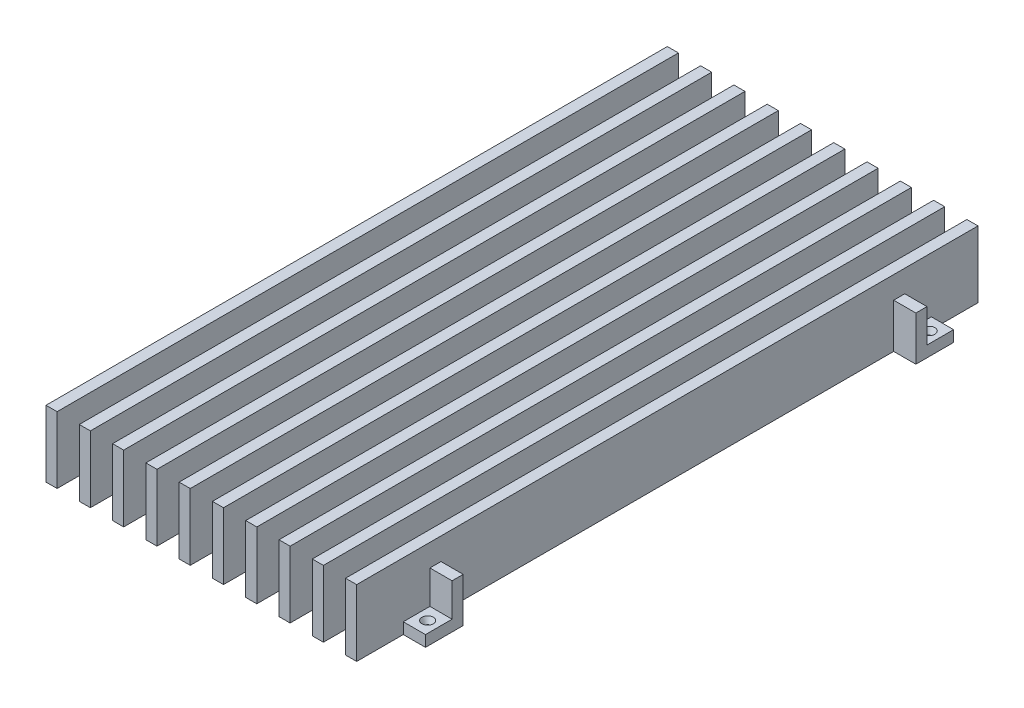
ISO-10303-21;
HEADER;
FILE_DESCRIPTION(('STEP AP214'),'2;1');
FILE_NAME('part.step','',(''),(''),'','','');
FILE_SCHEMA(('AUTOMOTIVE_DESIGN { 1 0 10303 214 1 1 1 1 }'));
ENDSEC;
DATA;
#1=APPLICATION_CONTEXT('core data for automotive mechanical design processes');
#2=APPLICATION_PROTOCOL_DEFINITION('international standard','automotive_design',2000,#1);
#3=PRODUCT_CONTEXT('',#1,'mechanical');
#4=PRODUCT('Part','Part','',(#3));
#5=PRODUCT_RELATED_PRODUCT_CATEGORY('part','',(#4));
#6=PRODUCT_DEFINITION_FORMATION('','',#4);
#7=PRODUCT_DEFINITION_CONTEXT('part definition',#1,'design');
#8=PRODUCT_DEFINITION('design','',#6,#7);
#9=PRODUCT_DEFINITION_SHAPE('','',#8);
#10=(LENGTH_UNIT() NAMED_UNIT(*) SI_UNIT(.MILLI.,.METRE.));
#11=(NAMED_UNIT(*) PLANE_ANGLE_UNIT() SI_UNIT($,.RADIAN.));
#12=(NAMED_UNIT(*) SI_UNIT($,.STERADIAN.) SOLID_ANGLE_UNIT());
#13=UNCERTAINTY_MEASURE_WITH_UNIT(LENGTH_MEASURE(1.E-05),#10,'distance_accuracy_value','');
#14=(GEOMETRIC_REPRESENTATION_CONTEXT(3) GLOBAL_UNCERTAINTY_ASSIGNED_CONTEXT((#13)) GLOBAL_UNIT_ASSIGNED_CONTEXT((#10,
#11,#12)) REPRESENTATION_CONTEXT('',''));
#15=CARTESIAN_POINT('',(0.,0.,0.));
#16=DIRECTION('',(0.,0.,1.));
#17=DIRECTION('',(1.,0.,0.));
#18=AXIS2_PLACEMENT_3D('',#15,#16,#17);
#19=CARTESIAN_POINT('',(-7.93749999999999,-9.525,-156.845));
#20=DIRECTION('',(0.,0.,1.));
#21=DIRECTION('',(1.,0.,0.));
#22=AXIS2_PLACEMENT_3D('',#19,#20,#21);
#23=PLANE('',#22);
#24=DIRECTION('',(-1.,0.,0.));
#25=VECTOR('',#24,1.);
#26=CARTESIAN_POINT('',(87.3125,-6.35,-156.845));
#27=LINE('',#26,#25);
#28=CARTESIAN_POINT('',(93.6625,-6.35,-156.845));
#29=VERTEX_POINT('',#28);
#30=CARTESIAN_POINT('',(87.3125,-6.35,-156.845));
#31=VERTEX_POINT('',#30);
#32=EDGE_CURVE('E1725',#29,#31,#27,.T.);
#33=ORIENTED_EDGE('',*,*,#32,.T.);
#34=DIRECTION('',(0.,1.,0.));
#35=VECTOR('',#34,1.);
#36=CARTESIAN_POINT('',(87.3125,-9.525,-156.845));
#37=LINE('',#36,#35);
#38=CARTESIAN_POINT('',(87.3125,3.17499999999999,-156.845));
#39=VERTEX_POINT('',#38);
#40=EDGE_CURVE('E986',#31,#39,#37,.T.);
#41=ORIENTED_EDGE('',*,*,#40,.T.);
#42=DIRECTION('',(1.,0.,0.));
#43=VECTOR('',#42,1.);
#44=CARTESIAN_POINT('',(-7.93749999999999,3.17499999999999,-156.845));
#45=LINE('',#44,#43);
#46=CARTESIAN_POINT('',(93.6625,3.17499999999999,-156.845));
#47=VERTEX_POINT('',#46);
#48=EDGE_CURVE('E1634',#39,#47,#45,.T.);
#49=ORIENTED_EDGE('',*,*,#48,.T.);
#50=DIRECTION('',(0.,-1.,0.));
#51=VECTOR('',#50,1.);
#52=CARTESIAN_POINT('',(93.6625,-9.525,-156.845));
#53=LINE('',#52,#51);
#54=EDGE_CURVE('E1624',#47,#29,#53,.T.);
#55=ORIENTED_EDGE('',*,*,#54,.T.);
#56=EDGE_LOOP('',(#33,#41,#49,#55));
#57=FACE_BOUND('',#56,.T.);
#58=ADVANCED_FACE('F34',(#57),#23,.F.);
#59=CARTESIAN_POINT('',(-7.93749999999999,-9.52499999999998,-20.955));
#60=DIRECTION('',(0.,0.,-1.));
#61=DIRECTION('',(-1.,0.,0.));
#62=AXIS2_PLACEMENT_3D('',#59,#60,#61);
#63=PLANE('',#62);
#64=DIRECTION('',(1.,0.,0.));
#65=VECTOR('',#64,1.);
#66=CARTESIAN_POINT('',(-1.5875,-6.35,-20.955));
#67=LINE('',#66,#65);
#68=CARTESIAN_POINT('',(-7.93749999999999,-6.35,-20.955));
#69=VERTEX_POINT('',#68);
#70=CARTESIAN_POINT('',(-1.5875,-6.35,-20.955));
#71=VERTEX_POINT('',#70);
#72=EDGE_CURVE('E1761',#69,#71,#67,.T.);
#73=ORIENTED_EDGE('',*,*,#72,.T.);
#74=DIRECTION('',(0.,-1.,0.));
#75=VECTOR('',#74,1.);
#76=CARTESIAN_POINT('',(-1.5875,-9.525,-20.955));
#77=LINE('',#76,#75);
#78=CARTESIAN_POINT('',(-1.5875,3.17500000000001,-20.955));
#79=VERTEX_POINT('',#78);
#80=EDGE_CURVE('E1189',#79,#71,#77,.T.);
#81=ORIENTED_EDGE('',*,*,#80,.F.);
#82=DIRECTION('',(1.,0.,0.));
#83=VECTOR('',#82,1.);
#84=CARTESIAN_POINT('',(-7.93749999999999,3.17500000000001,-20.955));
#85=LINE('',#84,#83);
#86=CARTESIAN_POINT('',(-7.93749999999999,3.17500000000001,-20.955));
#87=VERTEX_POINT('',#86);
#88=EDGE_CURVE('E1016',#87,#79,#85,.T.);
#89=ORIENTED_EDGE('',*,*,#88,.F.);
#90=DIRECTION('',(0.,1.,0.));
#91=VECTOR('',#90,1.);
#92=CARTESIAN_POINT('',(-7.93749999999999,-9.52499999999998,-20.955));
#93=LINE('',#92,#91);
#94=EDGE_CURVE('E1772',#69,#87,#93,.T.);
#95=ORIENTED_EDGE('',*,*,#94,.F.);
#96=EDGE_LOOP('',(#73,#81,#89,#95));
#97=FACE_BOUND('',#96,.T.);
#98=ADVANCED_FACE('F2053',(#97),#63,.F.);
#99=CARTESIAN_POINT('',(-1.5875,-9.525,-177.8));
#100=DIRECTION('',(-1.,0.,0.));
#101=DIRECTION('',(0.,0.,1.));
#102=AXIS2_PLACEMENT_3D('',#99,#100,#101);
#103=PLANE('',#102);
#104=DIRECTION('',(0.,-1.,0.));
#105=VECTOR('',#104,1.);
#106=CARTESIAN_POINT('',(-1.5875,-6.35,-164.465));
#107=LINE('',#106,#105);
#108=CARTESIAN_POINT('',(-1.5875,-6.35,-164.465));
#109=VERTEX_POINT('',#108);
#110=CARTESIAN_POINT('',(-1.5875,-9.525,-164.465));
#111=VERTEX_POINT('',#110);
#112=EDGE_CURVE('E882',#109,#111,#107,.T.);
#113=ORIENTED_EDGE('',*,*,#112,.F.);
#114=DIRECTION('',(0.,0.,1.));
#115=VECTOR('',#114,1.);
#116=CARTESIAN_POINT('',(-1.5875,-6.35,-156.845));
#117=LINE('',#116,#115);
#118=CARTESIAN_POINT('',(-1.5875,-6.35,-156.845));
#119=VERTEX_POINT('',#118);
#120=EDGE_CURVE('E867',#109,#119,#117,.T.);
#121=ORIENTED_EDGE('',*,*,#120,.T.);
#122=DIRECTION('',(0.,1.,0.));
#123=VECTOR('',#122,1.);
#124=CARTESIAN_POINT('',(-1.5875,-9.525,-156.845));
#125=LINE('',#124,#123);
#126=CARTESIAN_POINT('',(-1.5875,3.17499999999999,-156.845));
#127=VERTEX_POINT('',#126);
#128=EDGE_CURVE('E879',#119,#127,#125,.T.);
#129=ORIENTED_EDGE('',*,*,#128,.T.);
#130=DIRECTION('',(0.,0.,1.));
#131=VECTOR('',#130,1.);
#132=CARTESIAN_POINT('',(-1.5875,3.17499999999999,-177.8));
#133=LINE('',#132,#131);
#134=CARTESIAN_POINT('',(-1.5875,3.17499999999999,-153.67));
#135=VERTEX_POINT('',#134);
#136=EDGE_CURVE('E889',#127,#135,#133,.T.);
#137=ORIENTED_EDGE('',*,*,#136,.T.);
#138=DIRECTION('',(0.,-1.,0.));
#139=VECTOR('',#138,1.);
#140=CARTESIAN_POINT('',(-1.5875,-9.525,-153.67));
#141=LINE('',#140,#139);
#142=CARTESIAN_POINT('',(-1.5875,-9.525,-153.67));
#143=VERTEX_POINT('',#142);
#144=EDGE_CURVE('E895',#135,#143,#141,.T.);
#145=ORIENTED_EDGE('',*,*,#144,.T.);
#146=DIRECTION('',(0.,0.,1.));
#147=VECTOR('',#146,1.);
#148=CARTESIAN_POINT('',(-1.5875,-9.525,-177.8));
#149=LINE('',#148,#147);
#150=CARTESIAN_POINT('',(-1.5875,-9.52499999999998,-24.13));
#151=VERTEX_POINT('',#150);
#152=EDGE_CURVE('E935',#143,#151,#149,.T.);
#153=ORIENTED_EDGE('',*,*,#152,.T.);
#154=DIRECTION('',(0.,1.,0.));
#155=VECTOR('',#154,1.);
#156=CARTESIAN_POINT('',(-1.5875,-9.525,-24.13));
#157=LINE('',#156,#155);
#158=CARTESIAN_POINT('',(-1.5875,3.17500000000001,-24.13));
#159=VERTEX_POINT('',#158);
#160=EDGE_CURVE('E2487',#151,#159,#157,.T.);
#161=ORIENTED_EDGE('',*,*,#160,.T.);
#162=DIRECTION('',(0.,0.,1.));
#163=VECTOR('',#162,1.);
#164=CARTESIAN_POINT('',(-1.5875,3.17499999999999,-177.8));
#165=LINE('',#164,#163);
#166=EDGE_CURVE('E1136',#159,#79,#165,.T.);
#167=ORIENTED_EDGE('',*,*,#166,.T.);
#168=ORIENTED_EDGE('',*,*,#80,.T.);
#169=DIRECTION('',(0.,0.,1.));
#170=VECTOR('',#169,1.);
#171=CARTESIAN_POINT('',(-1.5875,-6.35,-20.955));
#172=LINE('',#171,#170);
#173=CARTESIAN_POINT('',(-1.5875,-6.35,-13.335));
#174=VERTEX_POINT('',#173);
#175=EDGE_CURVE('E1753',#71,#174,#172,.T.);
#176=ORIENTED_EDGE('',*,*,#175,.T.);
#177=DIRECTION('',(0.,-1.,0.));
#178=VECTOR('',#177,1.);
#179=CARTESIAN_POINT('',(-1.5875,-6.35,-13.335));
#180=LINE('',#179,#178);
#181=CARTESIAN_POINT('',(-1.5875,-9.525,-13.335));
#182=VERTEX_POINT('',#181);
#183=EDGE_CURVE('E1683',#174,#182,#180,.T.);
#184=ORIENTED_EDGE('',*,*,#183,.T.);
#185=CARTESIAN_POINT('',(-1.5875,-9.525,0.));
#186=VERTEX_POINT('',#185);
#187=EDGE_CURVE('E912',#182,#186,#149,.T.);
#188=ORIENTED_EDGE('',*,*,#187,.T.);
#189=DIRECTION('',(0.,-1.,0.));
#190=VECTOR('',#189,1.);
#191=CARTESIAN_POINT('',(-1.5875,-9.525,0.));
#192=LINE('',#191,#190);
#193=CARTESIAN_POINT('',(-1.5875,9.525,0.));
#194=VERTEX_POINT('',#193);
#195=EDGE_CURVE('E892',#194,#186,#192,.T.);
#196=ORIENTED_EDGE('',*,*,#195,.F.);
#197=DIRECTION('',(0.,0.,1.));
#198=VECTOR('',#197,1.);
#199=CARTESIAN_POINT('',(-1.5875,9.525,-177.8));
#200=LINE('',#199,#198);
#201=CARTESIAN_POINT('',(-1.5875,9.525,-177.8));
#202=VERTEX_POINT('',#201);
#203=EDGE_CURVE('E923',#202,#194,#200,.T.);
#204=ORIENTED_EDGE('',*,*,#203,.F.);
#205=DIRECTION('',(0.,-1.,0.));
#206=VECTOR('',#205,1.);
#207=CARTESIAN_POINT('',(-1.5875,-9.525,-177.8));
#208=LINE('',#207,#206);
#209=CARTESIAN_POINT('',(-1.5875,-9.525,-177.8));
#210=VERTEX_POINT('',#209);
#211=EDGE_CURVE('E899',#202,#210,#208,.T.);
#212=ORIENTED_EDGE('',*,*,#211,.T.);
#213=EDGE_CURVE('E933',#210,#111,#149,.T.);
#214=ORIENTED_EDGE('',*,*,#213,.T.);
#215=EDGE_LOOP('',(#113,#121,#129,#137,#145,#153,#161,#167,#168,#176,#184,#188,#196,#204,#212,#214));
#216=FACE_BOUND('',#215,.T.);
#217=ADVANCED_FACE('F36',(#216),#103,.T.);
#218=CARTESIAN_POINT('',(1.5875,-9.525,-177.8));
#219=DIRECTION('',(1.,0.,0.));
#220=DIRECTION('',(0.,0.,-1.));
#221=AXIS2_PLACEMENT_3D('',#218,#219,#220);
#222=PLANE('',#221);
#223=DIRECTION('',(0.,0.,1.));
#224=VECTOR('',#223,1.);
#225=CARTESIAN_POINT('',(1.5875,-9.525,-177.8));
#226=LINE('',#225,#224);
#227=CARTESIAN_POINT('',(1.5875,-9.52499999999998,-20.955));
#228=VERTEX_POINT('',#227);
#229=CARTESIAN_POINT('',(1.5875,-9.525,0.));
#230=VERTEX_POINT('',#229);
#231=EDGE_CURVE('E932',#228,#230,#226,.T.);
#232=ORIENTED_EDGE('',*,*,#231,.F.);
#233=DIRECTION('',(0.,1.,0.));
#234=VECTOR('',#233,1.);
#235=CARTESIAN_POINT('',(1.5875,-9.525,-20.955));
#236=LINE('',#235,#234);
#237=CARTESIAN_POINT('',(1.5875,3.17500000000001,-20.955));
#238=VERTEX_POINT('',#237);
#239=EDGE_CURVE('E1186',#228,#238,#236,.T.);
#240=ORIENTED_EDGE('',*,*,#239,.T.);
#241=DIRECTION('',(0.,0.,-1.));
#242=VECTOR('',#241,1.);
#243=CARTESIAN_POINT('',(1.5875,3.17499999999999,-177.8));
#244=LINE('',#243,#242);
#245=CARTESIAN_POINT('',(1.5875,3.17500000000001,-24.13));
#246=VERTEX_POINT('',#245);
#247=EDGE_CURVE('E1133',#238,#246,#244,.T.);
#248=ORIENTED_EDGE('',*,*,#247,.T.);
#249=DIRECTION('',(0.,-1.,0.));
#250=VECTOR('',#249,1.);
#251=CARTESIAN_POINT('',(1.5875,-9.525,-24.13));
#252=LINE('',#251,#250);
#253=CARTESIAN_POINT('',(1.5875,-9.525,-24.13));
#254=VERTEX_POINT('',#253);
#255=EDGE_CURVE('E1967',#246,#254,#252,.T.);
#256=ORIENTED_EDGE('',*,*,#255,.T.);
#257=CARTESIAN_POINT('',(1.5875,-9.525,-153.67));
#258=VERTEX_POINT('',#257);
#259=EDGE_CURVE('E931',#258,#254,#226,.T.);
#260=ORIENTED_EDGE('',*,*,#259,.F.);
#261=DIRECTION('',(0.,1.,0.));
#262=VECTOR('',#261,1.);
#263=CARTESIAN_POINT('',(1.5875,-9.525,-153.67));
#264=LINE('',#263,#262);
#265=CARTESIAN_POINT('',(1.5875,3.17499999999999,-153.67));
#266=VERTEX_POINT('',#265);
#267=EDGE_CURVE('E1660',#258,#266,#264,.T.);
#268=ORIENTED_EDGE('',*,*,#267,.T.);
#269=DIRECTION('',(0.,0.,-1.));
#270=VECTOR('',#269,1.);
#271=CARTESIAN_POINT('',(1.5875,3.17499999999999,-177.8));
#272=LINE('',#271,#270);
#273=CARTESIAN_POINT('',(1.5875,3.17499999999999,-156.845));
#274=VERTEX_POINT('',#273);
#275=EDGE_CURVE('E925',#266,#274,#272,.T.);
#276=ORIENTED_EDGE('',*,*,#275,.T.);
#277=DIRECTION('',(0.,-1.,0.));
#278=VECTOR('',#277,1.);
#279=CARTESIAN_POINT('',(1.5875,-9.525,-156.845));
#280=LINE('',#279,#278);
#281=CARTESIAN_POINT('',(1.5875,-9.525,-156.845));
#282=VERTEX_POINT('',#281);
#283=EDGE_CURVE('E890',#274,#282,#280,.T.);
#284=ORIENTED_EDGE('',*,*,#283,.T.);
#285=CARTESIAN_POINT('',(1.5875,-9.525,-177.8));
#286=VERTEX_POINT('',#285);
#287=EDGE_CURVE('E928',#286,#282,#226,.T.);
#288=ORIENTED_EDGE('',*,*,#287,.F.);
#289=DIRECTION('',(0.,1.,0.));
#290=VECTOR('',#289,1.);
#291=CARTESIAN_POINT('',(1.5875,-9.525,-177.8));
#292=LINE('',#291,#290);
#293=CARTESIAN_POINT('',(1.5875,9.525,-177.8));
#294=VERTEX_POINT('',#293);
#295=EDGE_CURVE('E906',#286,#294,#292,.T.);
#296=ORIENTED_EDGE('',*,*,#295,.T.);
#297=DIRECTION('',(0.,0.,1.));
#298=VECTOR('',#297,1.);
#299=CARTESIAN_POINT('',(1.5875,9.525,-177.8));
#300=LINE('',#299,#298);
#301=CARTESIAN_POINT('',(1.5875,9.525,0.));
#302=VERTEX_POINT('',#301);
#303=EDGE_CURVE('E926',#294,#302,#300,.T.);
#304=ORIENTED_EDGE('',*,*,#303,.T.);
#305=DIRECTION('',(0.,1.,0.));
#306=VECTOR('',#305,1.);
#307=CARTESIAN_POINT('',(1.5875,-9.525,0.));
#308=LINE('',#307,#306);
#309=EDGE_CURVE('E918',#230,#302,#308,.T.);
#310=ORIENTED_EDGE('',*,*,#309,.F.);
#311=EDGE_LOOP('',(#232,#240,#248,#256,#260,#268,#276,#284,#288,#296,#304,#310));
#312=FACE_BOUND('',#311,.T.);
#313=ADVANCED_FACE('F1964',(#312),#222,.T.);
#314=CARTESIAN_POINT('',(7.9375,-9.525,-177.8));
#315=DIRECTION('',(-1.,0.,0.));
#316=DIRECTION('',(0.,0.,1.));
#317=AXIS2_PLACEMENT_3D('',#314,#315,#316);
#318=PLANE('',#317);
#319=DIRECTION('',(0.,0.,1.));
#320=VECTOR('',#319,1.);
#321=CARTESIAN_POINT('',(7.9375,3.17499999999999,-177.8));
#322=LINE('',#321,#320);
#323=CARTESIAN_POINT('',(7.9375,3.17500000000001,-24.13));
#324=VERTEX_POINT('',#323);
#325=CARTESIAN_POINT('',(7.9375,3.17500000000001,-20.955));
#326=VERTEX_POINT('',#325);
#327=EDGE_CURVE('E1131',#324,#326,#322,.T.);
#328=ORIENTED_EDGE('',*,*,#327,.T.);
#329=DIRECTION('',(0.,-1.,0.));
#330=VECTOR('',#329,1.);
#331=CARTESIAN_POINT('',(7.9375,-9.525,-20.955));
#332=LINE('',#331,#330);
#333=CARTESIAN_POINT('',(7.9375,-9.52499999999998,-20.955));
#334=VERTEX_POINT('',#333);
#335=EDGE_CURVE('E1183',#326,#334,#332,.T.);
#336=ORIENTED_EDGE('',*,*,#335,.T.);
#337=DIRECTION('',(0.,0.,1.));
#338=VECTOR('',#337,1.);
#339=CARTESIAN_POINT('',(7.9375,-9.525,-177.8));
#340=LINE('',#339,#338);
#341=CARTESIAN_POINT('',(7.9375,-9.525,0.));
#342=VERTEX_POINT('',#341);
#343=EDGE_CURVE('E1590',#334,#342,#340,.T.);
#344=ORIENTED_EDGE('',*,*,#343,.T.);
#345=DIRECTION('',(0.,-1.,0.));
#346=VECTOR('',#345,1.);
#347=CARTESIAN_POINT('',(7.9375,-9.525,0.));
#348=LINE('',#347,#346);
#349=CARTESIAN_POINT('',(7.9375,9.525,0.));
#350=VERTEX_POINT('',#349);
#351=EDGE_CURVE('E1576',#350,#342,#348,.T.);
#352=ORIENTED_EDGE('',*,*,#351,.F.);
#353=DIRECTION('',(0.,0.,1.));
#354=VECTOR('',#353,1.);
#355=CARTESIAN_POINT('',(7.9375,9.525,-177.8));
#356=LINE('',#355,#354);
#357=CARTESIAN_POINT('',(7.9375,9.525,-177.8));
#358=VERTEX_POINT('',#357);
#359=EDGE_CURVE('E1601',#358,#350,#356,.T.);
#360=ORIENTED_EDGE('',*,*,#359,.F.);
#361=DIRECTION('',(0.,-1.,0.));
#362=VECTOR('',#361,1.);
#363=CARTESIAN_POINT('',(7.9375,-9.525,-177.8));
#364=LINE('',#363,#362);
#365=CARTESIAN_POINT('',(7.9375,-9.525,-177.8));
#366=VERTEX_POINT('',#365);
#367=EDGE_CURVE('E1577',#358,#366,#364,.T.);
#368=ORIENTED_EDGE('',*,*,#367,.T.);
#369=CARTESIAN_POINT('',(7.9375,-9.525,-156.845));
#370=VERTEX_POINT('',#369);
#371=EDGE_CURVE('E1610',#366,#370,#340,.T.);
#372=ORIENTED_EDGE('',*,*,#371,.T.);
#373=DIRECTION('',(0.,-1.,0.));
#374=VECTOR('',#373,1.);
#375=CARTESIAN_POINT('',(7.9375,-9.525,-156.845));
#376=LINE('',#375,#374);
#377=CARTESIAN_POINT('',(7.9375,3.17499999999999,-156.845));
#378=VERTEX_POINT('',#377);
#379=EDGE_CURVE('E941',#378,#370,#376,.T.);
#380=ORIENTED_EDGE('',*,*,#379,.F.);
#381=DIRECTION('',(0.,0.,-1.));
#382=VECTOR('',#381,1.);
#383=CARTESIAN_POINT('',(7.9375,3.17499999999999,-156.845));
#384=LINE('',#383,#382);
#385=CARTESIAN_POINT('',(7.9375,3.17499999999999,-153.67));
#386=VERTEX_POINT('',#385);
#387=EDGE_CURVE('E1618',#386,#378,#384,.T.);
#388=ORIENTED_EDGE('',*,*,#387,.F.);
#389=DIRECTION('',(0.,1.,0.));
#390=VECTOR('',#389,1.);
#391=CARTESIAN_POINT('',(7.9375,-9.525,-153.67));
#392=LINE('',#391,#390);
#393=CARTESIAN_POINT('',(7.9375,-9.525,-153.67));
#394=VERTEX_POINT('',#393);
#395=EDGE_CURVE('E1621',#394,#386,#392,.T.);
#396=ORIENTED_EDGE('',*,*,#395,.F.);
#397=CARTESIAN_POINT('',(7.9375,-9.52499999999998,-24.13));
#398=VERTEX_POINT('',#397);
#399=EDGE_CURVE('E1612',#394,#398,#340,.T.);
#400=ORIENTED_EDGE('',*,*,#399,.T.);
#401=DIRECTION('',(0.,1.,0.));
#402=VECTOR('',#401,1.);
#403=CARTESIAN_POINT('',(7.9375,-9.525,-24.13));
#404=LINE('',#403,#402);
#405=EDGE_CURVE('E2483',#398,#324,#404,.T.);
#406=ORIENTED_EDGE('',*,*,#405,.T.);
#407=EDGE_LOOP('',(#328,#336,#344,#352,#360,#368,#372,#380,#388,#396,#400,#406));
#408=FACE_BOUND('',#407,.T.);
#409=ADVANCED_FACE('F2160',(#408),#318,.T.);
#410=CARTESIAN_POINT('',(11.1125,-9.525,-177.8));
#411=DIRECTION('',(1.,0.,0.));
#412=DIRECTION('',(0.,0.,-1.));
#413=AXIS2_PLACEMENT_3D('',#410,#411,#412);
#414=PLANE('',#413);
#415=DIRECTION('',(0.,0.,1.));
#416=VECTOR('',#415,1.);
#417=CARTESIAN_POINT('',(11.1125,-9.525,-177.8));
#418=LINE('',#417,#416);
#419=CARTESIAN_POINT('',(11.1125,-9.52499999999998,-20.955));
#420=VERTEX_POINT('',#419);
#421=CARTESIAN_POINT('',(11.1125,-9.525,0.));
#422=VERTEX_POINT('',#421);
#423=EDGE_CURVE('E1609',#420,#422,#418,.T.);
#424=ORIENTED_EDGE('',*,*,#423,.F.);
#425=DIRECTION('',(0.,1.,0.));
#426=VECTOR('',#425,1.);
#427=CARTESIAN_POINT('',(11.1125,-9.525,-20.955));
#428=LINE('',#427,#426);
#429=CARTESIAN_POINT('',(11.1125,3.17500000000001,-20.955));
#430=VERTEX_POINT('',#429);
#431=EDGE_CURVE('E1180',#420,#430,#428,.T.);
#432=ORIENTED_EDGE('',*,*,#431,.T.);
#433=DIRECTION('',(0.,0.,-1.));
#434=VECTOR('',#433,1.);
#435=CARTESIAN_POINT('',(11.1125,3.17499999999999,-177.8));
#436=LINE('',#435,#434);
#437=CARTESIAN_POINT('',(11.1125,3.17500000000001,-24.13));
#438=VERTEX_POINT('',#437);
#439=EDGE_CURVE('E1128',#430,#438,#436,.T.);
#440=ORIENTED_EDGE('',*,*,#439,.T.);
#441=DIRECTION('',(0.,-1.,0.));
#442=VECTOR('',#441,1.);
#443=CARTESIAN_POINT('',(11.1125,-9.525,-24.13));
#444=LINE('',#443,#442);
#445=CARTESIAN_POINT('',(11.1125,-9.525,-24.13));
#446=VERTEX_POINT('',#445);
#447=EDGE_CURVE('E2481',#438,#446,#444,.T.);
#448=ORIENTED_EDGE('',*,*,#447,.T.);
#449=CARTESIAN_POINT('',(11.1125,-9.525,-153.67));
#450=VERTEX_POINT('',#449);
#451=EDGE_CURVE('E1608',#450,#446,#418,.T.);
#452=ORIENTED_EDGE('',*,*,#451,.F.);
#453=DIRECTION('',(0.,-1.,0.));
#454=VECTOR('',#453,1.);
#455=CARTESIAN_POINT('',(11.1125,-9.525,-153.67));
#456=LINE('',#455,#454);
#457=CARTESIAN_POINT('',(11.1125,3.17499999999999,-153.67));
#458=VERTEX_POINT('',#457);
#459=EDGE_CURVE('E1615',#458,#450,#456,.T.);
#460=ORIENTED_EDGE('',*,*,#459,.F.);
#461=DIRECTION('',(0.,0.,1.));
#462=VECTOR('',#461,1.);
#463=CARTESIAN_POINT('',(11.1125,3.17499999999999,-156.845));
#464=LINE('',#463,#462);
#465=CARTESIAN_POINT('',(11.1125,3.17499999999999,-156.845));
#466=VERTEX_POINT('',#465);
#467=EDGE_CURVE('E1603',#466,#458,#464,.T.);
#468=ORIENTED_EDGE('',*,*,#467,.F.);
#469=DIRECTION('',(0.,1.,0.));
#470=VECTOR('',#469,1.);
#471=CARTESIAN_POINT('',(11.1125,-9.525,-156.845));
#472=LINE('',#471,#470);
#473=CARTESIAN_POINT('',(11.1125,-9.525,-156.845));
#474=VERTEX_POINT('',#473);
#475=EDGE_CURVE('E938',#474,#466,#472,.T.);
#476=ORIENTED_EDGE('',*,*,#475,.F.);
#477=CARTESIAN_POINT('',(11.1125,-9.525,-177.8));
#478=VERTEX_POINT('',#477);
#479=EDGE_CURVE('E1606',#478,#474,#418,.T.);
#480=ORIENTED_EDGE('',*,*,#479,.F.);
#481=DIRECTION('',(0.,1.,0.));
#482=VECTOR('',#481,1.);
#483=CARTESIAN_POINT('',(11.1125,-9.525,-177.8));
#484=LINE('',#483,#482);
#485=CARTESIAN_POINT('',(11.1125,9.525,-177.8));
#486=VERTEX_POINT('',#485);
#487=EDGE_CURVE('E1584',#478,#486,#484,.T.);
#488=ORIENTED_EDGE('',*,*,#487,.T.);
#489=DIRECTION('',(0.,0.,1.));
#490=VECTOR('',#489,1.);
#491=CARTESIAN_POINT('',(11.1125,9.525,-177.8));
#492=LINE('',#491,#490);
#493=CARTESIAN_POINT('',(11.1125,9.525,0.));
#494=VERTEX_POINT('',#493);
#495=EDGE_CURVE('E1604',#486,#494,#492,.T.);
#496=ORIENTED_EDGE('',*,*,#495,.T.);
#497=DIRECTION('',(0.,1.,0.));
#498=VECTOR('',#497,1.);
#499=CARTESIAN_POINT('',(11.1125,-9.525,0.));
#500=LINE('',#499,#498);
#501=EDGE_CURVE('E1596',#422,#494,#500,.T.);
#502=ORIENTED_EDGE('',*,*,#501,.F.);
#503=EDGE_LOOP('',(#424,#432,#440,#448,#452,#460,#468,#476,#480,#488,#496,#502));
#504=FACE_BOUND('',#503,.T.);
#505=ADVANCED_FACE('F2163',(#504),#414,.T.);
#506=CARTESIAN_POINT('',(17.4625,-9.525,-177.8));
#507=DIRECTION('',(-1.,0.,0.));
#508=DIRECTION('',(0.,0.,1.));
#509=AXIS2_PLACEMENT_3D('',#506,#507,#508);
#510=PLANE('',#509);
#511=DIRECTION('',(0.,0.,1.));
#512=VECTOR('',#511,1.);
#513=CARTESIAN_POINT('',(17.4625,3.17499999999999,-177.8));
#514=LINE('',#513,#512);
#515=CARTESIAN_POINT('',(17.4625,3.17500000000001,-24.13));
#516=VERTEX_POINT('',#515);
#517=CARTESIAN_POINT('',(17.4625,3.17500000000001,-20.955));
#518=VERTEX_POINT('',#517);
#519=EDGE_CURVE('E1126',#516,#518,#514,.T.);
#520=ORIENTED_EDGE('',*,*,#519,.T.);
#521=DIRECTION('',(0.,-1.,0.));
#522=VECTOR('',#521,1.);
#523=CARTESIAN_POINT('',(17.4625,-9.525,-20.955));
#524=LINE('',#523,#522);
#525=CARTESIAN_POINT('',(17.4625,-9.52499999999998,-20.955));
#526=VERTEX_POINT('',#525);
#527=EDGE_CURVE('E1177',#518,#526,#524,.T.);
#528=ORIENTED_EDGE('',*,*,#527,.T.);
#529=DIRECTION('',(0.,0.,1.));
#530=VECTOR('',#529,1.);
#531=CARTESIAN_POINT('',(17.4625,-9.525,-177.8));
#532=LINE('',#531,#530);
#533=CARTESIAN_POINT('',(17.4625,-9.525,0.));
#534=VERTEX_POINT('',#533);
#535=EDGE_CURVE('E1542',#526,#534,#532,.T.);
#536=ORIENTED_EDGE('',*,*,#535,.T.);
#537=DIRECTION('',(0.,-1.,0.));
#538=VECTOR('',#537,1.);
#539=CARTESIAN_POINT('',(17.4625,-9.525,0.));
#540=LINE('',#539,#538);
#541=CARTESIAN_POINT('',(17.4625,9.525,0.));
#542=VERTEX_POINT('',#541);
#543=EDGE_CURVE('E1528',#542,#534,#540,.T.);
#544=ORIENTED_EDGE('',*,*,#543,.F.);
#545=DIRECTION('',(0.,0.,1.));
#546=VECTOR('',#545,1.);
#547=CARTESIAN_POINT('',(17.4625,9.525,-177.8));
#548=LINE('',#547,#546);
#549=CARTESIAN_POINT('',(17.4625,9.525,-177.8));
#550=VERTEX_POINT('',#549);
#551=EDGE_CURVE('E1553',#550,#542,#548,.T.);
#552=ORIENTED_EDGE('',*,*,#551,.F.);
#553=DIRECTION('',(0.,-1.,0.));
#554=VECTOR('',#553,1.);
#555=CARTESIAN_POINT('',(17.4625,-9.525,-177.8));
#556=LINE('',#555,#554);
#557=CARTESIAN_POINT('',(17.4625,-9.525,-177.8));
#558=VERTEX_POINT('',#557);
#559=EDGE_CURVE('E1529',#550,#558,#556,.T.);
#560=ORIENTED_EDGE('',*,*,#559,.T.);
#561=CARTESIAN_POINT('',(17.4625,-9.525,-156.845));
#562=VERTEX_POINT('',#561);
#563=EDGE_CURVE('E1562',#558,#562,#532,.T.);
#564=ORIENTED_EDGE('',*,*,#563,.T.);
#565=DIRECTION('',(0.,-1.,0.));
#566=VECTOR('',#565,1.);
#567=CARTESIAN_POINT('',(17.4625,-9.525,-156.845));
#568=LINE('',#567,#566);
#569=CARTESIAN_POINT('',(17.4625,3.17499999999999,-156.845));
#570=VERTEX_POINT('',#569);
#571=EDGE_CURVE('E947',#570,#562,#568,.T.);
#572=ORIENTED_EDGE('',*,*,#571,.F.);
#573=DIRECTION('',(0.,0.,-1.));
#574=VECTOR('',#573,1.);
#575=CARTESIAN_POINT('',(17.4625,3.17499999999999,-156.845));
#576=LINE('',#575,#574);
#577=CARTESIAN_POINT('',(17.4625,3.17499999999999,-153.67));
#578=VERTEX_POINT('',#577);
#579=EDGE_CURVE('E1570',#578,#570,#576,.T.);
#580=ORIENTED_EDGE('',*,*,#579,.F.);
#581=DIRECTION('',(0.,1.,0.));
#582=VECTOR('',#581,1.);
#583=CARTESIAN_POINT('',(17.4625,-9.525,-153.67));
#584=LINE('',#583,#582);
#585=CARTESIAN_POINT('',(17.4625,-9.525,-153.67));
#586=VERTEX_POINT('',#585);
#587=EDGE_CURVE('E1573',#586,#578,#584,.T.);
#588=ORIENTED_EDGE('',*,*,#587,.F.);
#589=CARTESIAN_POINT('',(17.4625,-9.52499999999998,-24.13));
#590=VERTEX_POINT('',#589);
#591=EDGE_CURVE('E1564',#586,#590,#532,.T.);
#592=ORIENTED_EDGE('',*,*,#591,.T.);
#593=DIRECTION('',(0.,1.,0.));
#594=VECTOR('',#593,1.);
#595=CARTESIAN_POINT('',(17.4625,-9.525,-24.13));
#596=LINE('',#595,#594);
#597=EDGE_CURVE('E1843',#590,#516,#596,.T.);
#598=ORIENTED_EDGE('',*,*,#597,.T.);
#599=EDGE_LOOP('',(#520,#528,#536,#544,#552,#560,#564,#572,#580,#588,#592,#598));
#600=FACE_BOUND('',#599,.T.);
#601=ADVANCED_FACE('F1842',(#600),#510,.T.);
#602=CARTESIAN_POINT('',(20.6375,-9.525,-177.8));
#603=DIRECTION('',(1.,0.,0.));
#604=DIRECTION('',(0.,0.,-1.));
#605=AXIS2_PLACEMENT_3D('',#602,#603,#604);
#606=PLANE('',#605);
#607=DIRECTION('',(0.,0.,1.));
#608=VECTOR('',#607,1.);
#609=CARTESIAN_POINT('',(20.6375,-9.525,-177.8));
#610=LINE('',#609,#608);
#611=CARTESIAN_POINT('',(20.6375,-9.52499999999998,-20.955));
#612=VERTEX_POINT('',#611);
#613=CARTESIAN_POINT('',(20.6375,-9.525,0.));
#614=VERTEX_POINT('',#613);
#615=EDGE_CURVE('E1561',#612,#614,#610,.T.);
#616=ORIENTED_EDGE('',*,*,#615,.F.);
#617=DIRECTION('',(0.,1.,0.));
#618=VECTOR('',#617,1.);
#619=CARTESIAN_POINT('',(20.6375,-9.525,-20.955));
#620=LINE('',#619,#618);
#621=CARTESIAN_POINT('',(20.6375,3.17500000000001,-20.955));
#622=VERTEX_POINT('',#621);
#623=EDGE_CURVE('E1174',#612,#622,#620,.T.);
#624=ORIENTED_EDGE('',*,*,#623,.T.);
#625=DIRECTION('',(0.,0.,-1.));
#626=VECTOR('',#625,1.);
#627=CARTESIAN_POINT('',(20.6375,3.17499999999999,-177.8));
#628=LINE('',#627,#626);
#629=CARTESIAN_POINT('',(20.6375,3.17500000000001,-24.13));
#630=VERTEX_POINT('',#629);
#631=EDGE_CURVE('E1123',#622,#630,#628,.T.);
#632=ORIENTED_EDGE('',*,*,#631,.T.);
#633=DIRECTION('',(0.,-1.,0.));
#634=VECTOR('',#633,1.);
#635=CARTESIAN_POINT('',(20.6375,-9.525,-24.13));
#636=LINE('',#635,#634);
#637=CARTESIAN_POINT('',(20.6375,-9.525,-24.13));
#638=VERTEX_POINT('',#637);
#639=EDGE_CURVE('E2477',#630,#638,#636,.T.);
#640=ORIENTED_EDGE('',*,*,#639,.T.);
#641=CARTESIAN_POINT('',(20.6375,-9.525,-153.67));
#642=VERTEX_POINT('',#641);
#643=EDGE_CURVE('E1560',#642,#638,#610,.T.);
#644=ORIENTED_EDGE('',*,*,#643,.F.);
#645=DIRECTION('',(0.,-1.,0.));
#646=VECTOR('',#645,1.);
#647=CARTESIAN_POINT('',(20.6375,-9.525,-153.67));
#648=LINE('',#647,#646);
#649=CARTESIAN_POINT('',(20.6375,3.17499999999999,-153.67));
#650=VERTEX_POINT('',#649);
#651=EDGE_CURVE('E1567',#650,#642,#648,.T.);
#652=ORIENTED_EDGE('',*,*,#651,.F.);
#653=DIRECTION('',(0.,0.,1.));
#654=VECTOR('',#653,1.);
#655=CARTESIAN_POINT('',(20.6375,3.17499999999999,-156.845));
#656=LINE('',#655,#654);
#657=CARTESIAN_POINT('',(20.6375,3.17499999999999,-156.845));
#658=VERTEX_POINT('',#657);
#659=EDGE_CURVE('E1555',#658,#650,#656,.T.);
#660=ORIENTED_EDGE('',*,*,#659,.F.);
#661=DIRECTION('',(0.,1.,0.));
#662=VECTOR('',#661,1.);
#663=CARTESIAN_POINT('',(20.6375,-9.525,-156.845));
#664=LINE('',#663,#662);
#665=CARTESIAN_POINT('',(20.6375,-9.525,-156.845));
#666=VERTEX_POINT('',#665);
#667=EDGE_CURVE('E944',#666,#658,#664,.T.);
#668=ORIENTED_EDGE('',*,*,#667,.F.);
#669=CARTESIAN_POINT('',(20.6375,-9.525,-177.8));
#670=VERTEX_POINT('',#669);
#671=EDGE_CURVE('E1558',#670,#666,#610,.T.);
#672=ORIENTED_EDGE('',*,*,#671,.F.);
#673=DIRECTION('',(0.,1.,0.));
#674=VECTOR('',#673,1.);
#675=CARTESIAN_POINT('',(20.6375,-9.525,-177.8));
#676=LINE('',#675,#674);
#677=CARTESIAN_POINT('',(20.6375,9.525,-177.8));
#678=VERTEX_POINT('',#677);
#679=EDGE_CURVE('E1536',#670,#678,#676,.T.);
#680=ORIENTED_EDGE('',*,*,#679,.T.);
#681=DIRECTION('',(0.,0.,1.));
#682=VECTOR('',#681,1.);
#683=CARTESIAN_POINT('',(20.6375,9.525,-177.8));
#684=LINE('',#683,#682);
#685=CARTESIAN_POINT('',(20.6375,9.525,0.));
#686=VERTEX_POINT('',#685);
#687=EDGE_CURVE('E1556',#678,#686,#684,.T.);
#688=ORIENTED_EDGE('',*,*,#687,.T.);
#689=DIRECTION('',(0.,1.,0.));
#690=VECTOR('',#689,1.);
#691=CARTESIAN_POINT('',(20.6375,-9.525,0.));
#692=LINE('',#691,#690);
#693=EDGE_CURVE('E1548',#614,#686,#692,.T.);
#694=ORIENTED_EDGE('',*,*,#693,.F.);
#695=EDGE_LOOP('',(#616,#624,#632,#640,#644,#652,#660,#668,#672,#680,#688,#694));
#696=FACE_BOUND('',#695,.T.);
#697=ADVANCED_FACE('F2181',(#696),#606,.T.);
#698=CARTESIAN_POINT('',(26.9875,-9.525,-177.8));
#699=DIRECTION('',(-1.,0.,0.));
#700=DIRECTION('',(0.,0.,1.));
#701=AXIS2_PLACEMENT_3D('',#698,#699,#700);
#702=PLANE('',#701);
#703=DIRECTION('',(0.,0.,1.));
#704=VECTOR('',#703,1.);
#705=CARTESIAN_POINT('',(26.9875,3.17499999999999,-177.8));
#706=LINE('',#705,#704);
#707=CARTESIAN_POINT('',(26.9875,3.17500000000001,-24.13));
#708=VERTEX_POINT('',#707);
#709=CARTESIAN_POINT('',(26.9875,3.17500000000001,-20.955));
#710=VERTEX_POINT('',#709);
#711=EDGE_CURVE('E1121',#708,#710,#706,.T.);
#712=ORIENTED_EDGE('',*,*,#711,.T.);
#713=DIRECTION('',(0.,-1.,0.));
#714=VECTOR('',#713,1.);
#715=CARTESIAN_POINT('',(26.9875,-9.525,-20.955));
#716=LINE('',#715,#714);
#717=CARTESIAN_POINT('',(26.9875,-9.52499999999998,-20.955));
#718=VERTEX_POINT('',#717);
#719=EDGE_CURVE('E1171',#710,#718,#716,.T.);
#720=ORIENTED_EDGE('',*,*,#719,.T.);
#721=DIRECTION('',(0.,0.,1.));
#722=VECTOR('',#721,1.);
#723=CARTESIAN_POINT('',(26.9875,-9.525,-177.8));
#724=LINE('',#723,#722);
#725=CARTESIAN_POINT('',(26.9875,-9.525,0.));
#726=VERTEX_POINT('',#725);
#727=EDGE_CURVE('E1494',#718,#726,#724,.T.);
#728=ORIENTED_EDGE('',*,*,#727,.T.);
#729=DIRECTION('',(0.,-1.,0.));
#730=VECTOR('',#729,1.);
#731=CARTESIAN_POINT('',(26.9875,-9.525,0.));
#732=LINE('',#731,#730);
#733=CARTESIAN_POINT('',(26.9875,9.525,0.));
#734=VERTEX_POINT('',#733);
#735=EDGE_CURVE('E1480',#734,#726,#732,.T.);
#736=ORIENTED_EDGE('',*,*,#735,.F.);
#737=DIRECTION('',(0.,0.,1.));
#738=VECTOR('',#737,1.);
#739=CARTESIAN_POINT('',(26.9875,9.525,-177.8));
#740=LINE('',#739,#738);
#741=CARTESIAN_POINT('',(26.9875,9.525,-177.8));
#742=VERTEX_POINT('',#741);
#743=EDGE_CURVE('E1505',#742,#734,#740,.T.);
#744=ORIENTED_EDGE('',*,*,#743,.F.);
#745=DIRECTION('',(0.,-1.,0.));
#746=VECTOR('',#745,1.);
#747=CARTESIAN_POINT('',(26.9875,-9.525,-177.8));
#748=LINE('',#747,#746);
#749=CARTESIAN_POINT('',(26.9875,-9.525,-177.8));
#750=VERTEX_POINT('',#749);
#751=EDGE_CURVE('E1481',#742,#750,#748,.T.);
#752=ORIENTED_EDGE('',*,*,#751,.T.);
#753=CARTESIAN_POINT('',(26.9875,-9.525,-156.845));
#754=VERTEX_POINT('',#753);
#755=EDGE_CURVE('E1514',#750,#754,#724,.T.);
#756=ORIENTED_EDGE('',*,*,#755,.T.);
#757=DIRECTION('',(0.,-1.,0.));
#758=VECTOR('',#757,1.);
#759=CARTESIAN_POINT('',(26.9875,-9.525,-156.845));
#760=LINE('',#759,#758);
#761=CARTESIAN_POINT('',(26.9875,3.17499999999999,-156.845));
#762=VERTEX_POINT('',#761);
#763=EDGE_CURVE('E953',#762,#754,#760,.T.);
#764=ORIENTED_EDGE('',*,*,#763,.F.);
#765=DIRECTION('',(0.,0.,-1.));
#766=VECTOR('',#765,1.);
#767=CARTESIAN_POINT('',(26.9875,3.17499999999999,-156.845));
#768=LINE('',#767,#766);
#769=CARTESIAN_POINT('',(26.9875,3.17499999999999,-153.67));
#770=VERTEX_POINT('',#769);
#771=EDGE_CURVE('E1522',#770,#762,#768,.T.);
#772=ORIENTED_EDGE('',*,*,#771,.F.);
#773=DIRECTION('',(0.,1.,0.));
#774=VECTOR('',#773,1.);
#775=CARTESIAN_POINT('',(26.9875,-9.525,-153.67));
#776=LINE('',#775,#774);
#777=CARTESIAN_POINT('',(26.9875,-9.525,-153.67));
#778=VERTEX_POINT('',#777);
#779=EDGE_CURVE('E1525',#778,#770,#776,.T.);
#780=ORIENTED_EDGE('',*,*,#779,.F.);
#781=CARTESIAN_POINT('',(26.9875,-9.52499999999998,-24.13));
#782=VERTEX_POINT('',#781);
#783=EDGE_CURVE('E1516',#778,#782,#724,.T.);
#784=ORIENTED_EDGE('',*,*,#783,.T.);
#785=DIRECTION('',(0.,1.,0.));
#786=VECTOR('',#785,1.);
#787=CARTESIAN_POINT('',(26.9875,-9.525,-24.13));
#788=LINE('',#787,#786);
#789=EDGE_CURVE('E2474',#782,#708,#788,.T.);
#790=ORIENTED_EDGE('',*,*,#789,.T.);
#791=EDGE_LOOP('',(#712,#720,#728,#736,#744,#752,#756,#764,#772,#780,#784,#790));
#792=FACE_BOUND('',#791,.T.);
#793=ADVANCED_FACE('F2184',(#792),#702,.T.);
#794=CARTESIAN_POINT('',(30.1625,-9.525,-177.8));
#795=DIRECTION('',(1.,0.,0.));
#796=DIRECTION('',(0.,0.,-1.));
#797=AXIS2_PLACEMENT_3D('',#794,#795,#796);
#798=PLANE('',#797);
#799=DIRECTION('',(0.,0.,1.));
#800=VECTOR('',#799,1.);
#801=CARTESIAN_POINT('',(30.1625,-9.525,-177.8));
#802=LINE('',#801,#800);
#803=CARTESIAN_POINT('',(30.1625,-9.52499999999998,-20.955));
#804=VERTEX_POINT('',#803);
#805=CARTESIAN_POINT('',(30.1625,-9.525,0.));
#806=VERTEX_POINT('',#805);
#807=EDGE_CURVE('E1513',#804,#806,#802,.T.);
#808=ORIENTED_EDGE('',*,*,#807,.F.);
#809=DIRECTION('',(0.,1.,0.));
#810=VECTOR('',#809,1.);
#811=CARTESIAN_POINT('',(30.1625,-9.525,-20.955));
#812=LINE('',#811,#810);
#813=CARTESIAN_POINT('',(30.1625,3.17500000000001,-20.955));
#814=VERTEX_POINT('',#813);
#815=EDGE_CURVE('E1168',#804,#814,#812,.T.);
#816=ORIENTED_EDGE('',*,*,#815,.T.);
#817=DIRECTION('',(0.,0.,-1.));
#818=VECTOR('',#817,1.);
#819=CARTESIAN_POINT('',(30.1625,3.17499999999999,-177.8));
#820=LINE('',#819,#818);
#821=CARTESIAN_POINT('',(30.1625,3.17500000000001,-24.13));
#822=VERTEX_POINT('',#821);
#823=EDGE_CURVE('E1118',#814,#822,#820,.T.);
#824=ORIENTED_EDGE('',*,*,#823,.T.);
#825=DIRECTION('',(0.,-1.,0.));
#826=VECTOR('',#825,1.);
#827=CARTESIAN_POINT('',(30.1625,-9.525,-24.13));
#828=LINE('',#827,#826);
#829=CARTESIAN_POINT('',(30.1625,-9.525,-24.13));
#830=VERTEX_POINT('',#829);
#831=EDGE_CURVE('E2471',#822,#830,#828,.T.);
#832=ORIENTED_EDGE('',*,*,#831,.T.);
#833=CARTESIAN_POINT('',(30.1625,-9.525,-153.67));
#834=VERTEX_POINT('',#833);
#835=EDGE_CURVE('E1512',#834,#830,#802,.T.);
#836=ORIENTED_EDGE('',*,*,#835,.F.);
#837=DIRECTION('',(0.,-1.,0.));
#838=VECTOR('',#837,1.);
#839=CARTESIAN_POINT('',(30.1625,-9.525,-153.67));
#840=LINE('',#839,#838);
#841=CARTESIAN_POINT('',(30.1625,3.17499999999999,-153.67));
#842=VERTEX_POINT('',#841);
#843=EDGE_CURVE('E1519',#842,#834,#840,.T.);
#844=ORIENTED_EDGE('',*,*,#843,.F.);
#845=DIRECTION('',(0.,0.,1.));
#846=VECTOR('',#845,1.);
#847=CARTESIAN_POINT('',(30.1625,3.17499999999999,-156.845));
#848=LINE('',#847,#846);
#849=CARTESIAN_POINT('',(30.1625,3.17499999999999,-156.845));
#850=VERTEX_POINT('',#849);
#851=EDGE_CURVE('E1507',#850,#842,#848,.T.);
#852=ORIENTED_EDGE('',*,*,#851,.F.);
#853=DIRECTION('',(0.,1.,0.));
#854=VECTOR('',#853,1.);
#855=CARTESIAN_POINT('',(30.1625,-9.525,-156.845));
#856=LINE('',#855,#854);
#857=CARTESIAN_POINT('',(30.1625,-9.525,-156.845));
#858=VERTEX_POINT('',#857);
#859=EDGE_CURVE('E950',#858,#850,#856,.T.);
#860=ORIENTED_EDGE('',*,*,#859,.F.);
#861=CARTESIAN_POINT('',(30.1625,-9.525,-177.8));
#862=VERTEX_POINT('',#861);
#863=EDGE_CURVE('E1510',#862,#858,#802,.T.);
#864=ORIENTED_EDGE('',*,*,#863,.F.);
#865=DIRECTION('',(0.,1.,0.));
#866=VECTOR('',#865,1.);
#867=CARTESIAN_POINT('',(30.1625,-9.525,-177.8));
#868=LINE('',#867,#866);
#869=CARTESIAN_POINT('',(30.1625,9.525,-177.8));
#870=VERTEX_POINT('',#869);
#871=EDGE_CURVE('E1488',#862,#870,#868,.T.);
#872=ORIENTED_EDGE('',*,*,#871,.T.);
#873=DIRECTION('',(0.,0.,1.));
#874=VECTOR('',#873,1.);
#875=CARTESIAN_POINT('',(30.1625,9.525,-177.8));
#876=LINE('',#875,#874);
#877=CARTESIAN_POINT('',(30.1625,9.525,0.));
#878=VERTEX_POINT('',#877);
#879=EDGE_CURVE('E1508',#870,#878,#876,.T.);
#880=ORIENTED_EDGE('',*,*,#879,.T.);
#881=DIRECTION('',(0.,1.,0.));
#882=VECTOR('',#881,1.);
#883=CARTESIAN_POINT('',(30.1625,-9.525,0.));
#884=LINE('',#883,#882);
#885=EDGE_CURVE('E1500',#806,#878,#884,.T.);
#886=ORIENTED_EDGE('',*,*,#885,.F.);
#887=EDGE_LOOP('',(#808,#816,#824,#832,#836,#844,#852,#860,#864,#872,#880,#886));
#888=FACE_BOUND('',#887,.T.);
#889=ADVANCED_FACE('F2195',(#888),#798,.T.);
#890=CARTESIAN_POINT('',(36.5125,-9.525,-177.8));
#891=DIRECTION('',(-1.,0.,0.));
#892=DIRECTION('',(0.,0.,1.));
#893=AXIS2_PLACEMENT_3D('',#890,#891,#892);
#894=PLANE('',#893);
#895=DIRECTION('',(0.,0.,1.));
#896=VECTOR('',#895,1.);
#897=CARTESIAN_POINT('',(36.5125,3.17499999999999,-177.8));
#898=LINE('',#897,#896);
#899=CARTESIAN_POINT('',(36.5125,3.17500000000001,-24.13));
#900=VERTEX_POINT('',#899);
#901=CARTESIAN_POINT('',(36.5125,3.17500000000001,-20.955));
#902=VERTEX_POINT('',#901);
#903=EDGE_CURVE('E1116',#900,#902,#898,.T.);
#904=ORIENTED_EDGE('',*,*,#903,.T.);
#905=DIRECTION('',(0.,-1.,0.));
#906=VECTOR('',#905,1.);
#907=CARTESIAN_POINT('',(36.5125,-9.525,-20.955));
#908=LINE('',#907,#906);
#909=CARTESIAN_POINT('',(36.5125,-9.52499999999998,-20.955));
#910=VERTEX_POINT('',#909);
#911=EDGE_CURVE('E1165',#902,#910,#908,.T.);
#912=ORIENTED_EDGE('',*,*,#911,.T.);
#913=DIRECTION('',(0.,0.,1.));
#914=VECTOR('',#913,1.);
#915=CARTESIAN_POINT('',(36.5125,-9.525,-177.8));
#916=LINE('',#915,#914);
#917=CARTESIAN_POINT('',(36.5125,-9.525,0.));
#918=VERTEX_POINT('',#917);
#919=EDGE_CURVE('E1446',#910,#918,#916,.T.);
#920=ORIENTED_EDGE('',*,*,#919,.T.);
#921=DIRECTION('',(0.,-1.,0.));
#922=VECTOR('',#921,1.);
#923=CARTESIAN_POINT('',(36.5125,-9.525,0.));
#924=LINE('',#923,#922);
#925=CARTESIAN_POINT('',(36.5125,9.525,0.));
#926=VERTEX_POINT('',#925);
#927=EDGE_CURVE('E1432',#926,#918,#924,.T.);
#928=ORIENTED_EDGE('',*,*,#927,.F.);
#929=DIRECTION('',(0.,0.,1.));
#930=VECTOR('',#929,1.);
#931=CARTESIAN_POINT('',(36.5125,9.525,-177.8));
#932=LINE('',#931,#930);
#933=CARTESIAN_POINT('',(36.5125,9.525,-177.8));
#934=VERTEX_POINT('',#933);
#935=EDGE_CURVE('E1457',#934,#926,#932,.T.);
#936=ORIENTED_EDGE('',*,*,#935,.F.);
#937=DIRECTION('',(0.,-1.,0.));
#938=VECTOR('',#937,1.);
#939=CARTESIAN_POINT('',(36.5125,-9.525,-177.8));
#940=LINE('',#939,#938);
#941=CARTESIAN_POINT('',(36.5125,-9.525,-177.8));
#942=VERTEX_POINT('',#941);
#943=EDGE_CURVE('E1433',#934,#942,#940,.T.);
#944=ORIENTED_EDGE('',*,*,#943,.T.);
#945=CARTESIAN_POINT('',(36.5125,-9.525,-156.845));
#946=VERTEX_POINT('',#945);
#947=EDGE_CURVE('E1466',#942,#946,#916,.T.);
#948=ORIENTED_EDGE('',*,*,#947,.T.);
#949=DIRECTION('',(0.,-1.,0.));
#950=VECTOR('',#949,1.);
#951=CARTESIAN_POINT('',(36.5125,-9.525,-156.845));
#952=LINE('',#951,#950);
#953=CARTESIAN_POINT('',(36.5125,3.17499999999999,-156.845));
#954=VERTEX_POINT('',#953);
#955=EDGE_CURVE('E959',#954,#946,#952,.T.);
#956=ORIENTED_EDGE('',*,*,#955,.F.);
#957=DIRECTION('',(0.,0.,-1.));
#958=VECTOR('',#957,1.);
#959=CARTESIAN_POINT('',(36.5125,3.17499999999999,-156.845));
#960=LINE('',#959,#958);
#961=CARTESIAN_POINT('',(36.5125,3.17499999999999,-153.67));
#962=VERTEX_POINT('',#961);
#963=EDGE_CURVE('E1474',#962,#954,#960,.T.);
#964=ORIENTED_EDGE('',*,*,#963,.F.);
#965=DIRECTION('',(0.,1.,0.));
#966=VECTOR('',#965,1.);
#967=CARTESIAN_POINT('',(36.5125,-9.525,-153.67));
#968=LINE('',#967,#966);
#969=CARTESIAN_POINT('',(36.5125,-9.525,-153.67));
#970=VERTEX_POINT('',#969);
#971=EDGE_CURVE('E1477',#970,#962,#968,.T.);
#972=ORIENTED_EDGE('',*,*,#971,.F.);
#973=CARTESIAN_POINT('',(36.5125,-9.52499999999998,-24.13));
#974=VERTEX_POINT('',#973);
#975=EDGE_CURVE('E1468',#970,#974,#916,.T.);
#976=ORIENTED_EDGE('',*,*,#975,.T.);
#977=DIRECTION('',(0.,1.,0.));
#978=VECTOR('',#977,1.);
#979=CARTESIAN_POINT('',(36.5125,-9.525,-24.13));
#980=LINE('',#979,#978);
#981=EDGE_CURVE('E2468',#974,#900,#980,.T.);
#982=ORIENTED_EDGE('',*,*,#981,.T.);
#983=EDGE_LOOP('',(#904,#912,#920,#928,#936,#944,#948,#956,#964,#972,#976,#982));
#984=FACE_BOUND('',#983,.T.);
#985=ADVANCED_FACE('F2199',(#984),#894,.T.);
#986=CARTESIAN_POINT('',(39.6875,-9.525,-177.8));
#987=DIRECTION('',(1.,0.,0.));
#988=DIRECTION('',(0.,0.,-1.));
#989=AXIS2_PLACEMENT_3D('',#986,#987,#988);
#990=PLANE('',#989);
#991=DIRECTION('',(0.,0.,1.));
#992=VECTOR('',#991,1.);
#993=CARTESIAN_POINT('',(39.6875,-9.525,-177.8));
#994=LINE('',#993,#992);
#995=CARTESIAN_POINT('',(39.6875,-9.52499999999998,-20.955));
#996=VERTEX_POINT('',#995);
#997=CARTESIAN_POINT('',(39.6875,-9.525,0.));
#998=VERTEX_POINT('',#997);
#999=EDGE_CURVE('E1465',#996,#998,#994,.T.);
#1000=ORIENTED_EDGE('',*,*,#999,.F.);
#1001=DIRECTION('',(0.,1.,0.));
#1002=VECTOR('',#1001,1.);
#1003=CARTESIAN_POINT('',(39.6875,-9.525,-20.955));
#1004=LINE('',#1003,#1002);
#1005=CARTESIAN_POINT('',(39.6875,3.17500000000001,-20.955));
#1006=VERTEX_POINT('',#1005);
#1007=EDGE_CURVE('E1162',#996,#1006,#1004,.T.);
#1008=ORIENTED_EDGE('',*,*,#1007,.T.);
#1009=DIRECTION('',(0.,0.,-1.));
#1010=VECTOR('',#1009,1.);
#1011=CARTESIAN_POINT('',(39.6875,3.17499999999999,-177.8));
#1012=LINE('',#1011,#1010);
#1013=CARTESIAN_POINT('',(39.6875,3.17500000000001,-24.13));
#1014=VERTEX_POINT('',#1013);
#1015=EDGE_CURVE('E1113',#1006,#1014,#1012,.T.);
#1016=ORIENTED_EDGE('',*,*,#1015,.T.);
#1017=DIRECTION('',(0.,-1.,0.));
#1018=VECTOR('',#1017,1.);
#1019=CARTESIAN_POINT('',(39.6875,-9.525,-24.13));
#1020=LINE('',#1019,#1018);
#1021=CARTESIAN_POINT('',(39.6875,-9.525,-24.13));
#1022=VERTEX_POINT('',#1021);
#1023=EDGE_CURVE('E2465',#1014,#1022,#1020,.T.);
#1024=ORIENTED_EDGE('',*,*,#1023,.T.);
#1025=CARTESIAN_POINT('',(39.6875,-9.525,-153.67));
#1026=VERTEX_POINT('',#1025);
#1027=EDGE_CURVE('E1464',#1026,#1022,#994,.T.);
#1028=ORIENTED_EDGE('',*,*,#1027,.F.);
#1029=DIRECTION('',(0.,-1.,0.));
#1030=VECTOR('',#1029,1.);
#1031=CARTESIAN_POINT('',(39.6875,-9.525,-153.67));
#1032=LINE('',#1031,#1030);
#1033=CARTESIAN_POINT('',(39.6875,3.17499999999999,-153.67));
#1034=VERTEX_POINT('',#1033);
#1035=EDGE_CURVE('E1471',#1034,#1026,#1032,.T.);
#1036=ORIENTED_EDGE('',*,*,#1035,.F.);
#1037=DIRECTION('',(0.,0.,1.));
#1038=VECTOR('',#1037,1.);
#1039=CARTESIAN_POINT('',(39.6875,3.17499999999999,-156.845));
#1040=LINE('',#1039,#1038);
#1041=CARTESIAN_POINT('',(39.6875,3.17499999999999,-156.845));
#1042=VERTEX_POINT('',#1041);
#1043=EDGE_CURVE('E1459',#1042,#1034,#1040,.T.);
#1044=ORIENTED_EDGE('',*,*,#1043,.F.);
#1045=DIRECTION('',(0.,1.,0.));
#1046=VECTOR('',#1045,1.);
#1047=CARTESIAN_POINT('',(39.6875,-9.525,-156.845));
#1048=LINE('',#1047,#1046);
#1049=CARTESIAN_POINT('',(39.6875,-9.525,-156.845));
#1050=VERTEX_POINT('',#1049);
#1051=EDGE_CURVE('E956',#1050,#1042,#1048,.T.);
#1052=ORIENTED_EDGE('',*,*,#1051,.F.);
#1053=CARTESIAN_POINT('',(39.6875,-9.525,-177.8));
#1054=VERTEX_POINT('',#1053);
#1055=EDGE_CURVE('E1462',#1054,#1050,#994,.T.);
#1056=ORIENTED_EDGE('',*,*,#1055,.F.);
#1057=DIRECTION('',(0.,1.,0.));
#1058=VECTOR('',#1057,1.);
#1059=CARTESIAN_POINT('',(39.6875,-9.525,-177.8));
#1060=LINE('',#1059,#1058);
#1061=CARTESIAN_POINT('',(39.6875,9.525,-177.8));
#1062=VERTEX_POINT('',#1061);
#1063=EDGE_CURVE('E1440',#1054,#1062,#1060,.T.);
#1064=ORIENTED_EDGE('',*,*,#1063,.T.);
#1065=DIRECTION('',(0.,0.,1.));
#1066=VECTOR('',#1065,1.);
#1067=CARTESIAN_POINT('',(39.6875,9.525,-177.8));
#1068=LINE('',#1067,#1066);
#1069=CARTESIAN_POINT('',(39.6875,9.525,0.));
#1070=VERTEX_POINT('',#1069);
#1071=EDGE_CURVE('E1460',#1062,#1070,#1068,.T.);
#1072=ORIENTED_EDGE('',*,*,#1071,.T.);
#1073=DIRECTION('',(0.,1.,0.));
#1074=VECTOR('',#1073,1.);
#1075=CARTESIAN_POINT('',(39.6875,-9.525,0.));
#1076=LINE('',#1075,#1074);
#1077=EDGE_CURVE('E1452',#998,#1070,#1076,.T.);
#1078=ORIENTED_EDGE('',*,*,#1077,.F.);
#1079=EDGE_LOOP('',(#1000,#1008,#1016,#1024,#1028,#1036,#1044,#1052,#1056,#1064,#1072,#1078));
#1080=FACE_BOUND('',#1079,.T.);
#1081=ADVANCED_FACE('F2215',(#1080),#990,.T.);
#1082=CARTESIAN_POINT('',(46.0375,-9.525,-177.8));
#1083=DIRECTION('',(-1.,0.,0.));
#1084=DIRECTION('',(0.,0.,1.));
#1085=AXIS2_PLACEMENT_3D('',#1082,#1083,#1084);
#1086=PLANE('',#1085);
#1087=DIRECTION('',(0.,0.,1.));
#1088=VECTOR('',#1087,1.);
#1089=CARTESIAN_POINT('',(46.0375,3.17499999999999,-177.8));
#1090=LINE('',#1089,#1088);
#1091=CARTESIAN_POINT('',(46.0375,3.17500000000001,-24.13));
#1092=VERTEX_POINT('',#1091);
#1093=CARTESIAN_POINT('',(46.0375,3.17500000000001,-20.955));
#1094=VERTEX_POINT('',#1093);
#1095=EDGE_CURVE('E1111',#1092,#1094,#1090,.T.);
#1096=ORIENTED_EDGE('',*,*,#1095,.T.);
#1097=DIRECTION('',(0.,-1.,0.));
#1098=VECTOR('',#1097,1.);
#1099=CARTESIAN_POINT('',(46.0375,-9.525,-20.955));
#1100=LINE('',#1099,#1098);
#1101=CARTESIAN_POINT('',(46.0375,-9.52499999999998,-20.955));
#1102=VERTEX_POINT('',#1101);
#1103=EDGE_CURVE('E1159',#1094,#1102,#1100,.T.);
#1104=ORIENTED_EDGE('',*,*,#1103,.T.);
#1105=DIRECTION('',(0.,0.,1.));
#1106=VECTOR('',#1105,1.);
#1107=CARTESIAN_POINT('',(46.0375,-9.525,-177.8));
#1108=LINE('',#1107,#1106);
#1109=CARTESIAN_POINT('',(46.0375,-9.525,0.));
#1110=VERTEX_POINT('',#1109);
#1111=EDGE_CURVE('E1398',#1102,#1110,#1108,.T.);
#1112=ORIENTED_EDGE('',*,*,#1111,.T.);
#1113=DIRECTION('',(0.,-1.,0.));
#1114=VECTOR('',#1113,1.);
#1115=CARTESIAN_POINT('',(46.0375,-9.525,0.));
#1116=LINE('',#1115,#1114);
#1117=CARTESIAN_POINT('',(46.0375,9.525,0.));
#1118=VERTEX_POINT('',#1117);
#1119=EDGE_CURVE('E1384',#1118,#1110,#1116,.T.);
#1120=ORIENTED_EDGE('',*,*,#1119,.F.);
#1121=DIRECTION('',(0.,0.,1.));
#1122=VECTOR('',#1121,1.);
#1123=CARTESIAN_POINT('',(46.0375,9.525,-177.8));
#1124=LINE('',#1123,#1122);
#1125=CARTESIAN_POINT('',(46.0375,9.525,-177.8));
#1126=VERTEX_POINT('',#1125);
#1127=EDGE_CURVE('E1409',#1126,#1118,#1124,.T.);
#1128=ORIENTED_EDGE('',*,*,#1127,.F.);
#1129=DIRECTION('',(0.,-1.,0.));
#1130=VECTOR('',#1129,1.);
#1131=CARTESIAN_POINT('',(46.0375,-9.525,-177.8));
#1132=LINE('',#1131,#1130);
#1133=CARTESIAN_POINT('',(46.0375,-9.525,-177.8));
#1134=VERTEX_POINT('',#1133);
#1135=EDGE_CURVE('E1385',#1126,#1134,#1132,.T.);
#1136=ORIENTED_EDGE('',*,*,#1135,.T.);
#1137=CARTESIAN_POINT('',(46.0375,-9.525,-156.845));
#1138=VERTEX_POINT('',#1137);
#1139=EDGE_CURVE('E1418',#1134,#1138,#1108,.T.);
#1140=ORIENTED_EDGE('',*,*,#1139,.T.);
#1141=DIRECTION('',(0.,-1.,0.));
#1142=VECTOR('',#1141,1.);
#1143=CARTESIAN_POINT('',(46.0375,-9.525,-156.845));
#1144=LINE('',#1143,#1142);
#1145=CARTESIAN_POINT('',(46.0375,3.17499999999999,-156.845));
#1146=VERTEX_POINT('',#1145);
#1147=EDGE_CURVE('E965',#1146,#1138,#1144,.T.);
#1148=ORIENTED_EDGE('',*,*,#1147,.F.);
#1149=DIRECTION('',(0.,0.,-1.));
#1150=VECTOR('',#1149,1.);
#1151=CARTESIAN_POINT('',(46.0375,3.17499999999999,-156.845));
#1152=LINE('',#1151,#1150);
#1153=CARTESIAN_POINT('',(46.0375,3.17499999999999,-153.67));
#1154=VERTEX_POINT('',#1153);
#1155=EDGE_CURVE('E1426',#1154,#1146,#1152,.T.);
#1156=ORIENTED_EDGE('',*,*,#1155,.F.);
#1157=DIRECTION('',(0.,1.,0.));
#1158=VECTOR('',#1157,1.);
#1159=CARTESIAN_POINT('',(46.0375,-9.525,-153.67));
#1160=LINE('',#1159,#1158);
#1161=CARTESIAN_POINT('',(46.0375,-9.525,-153.67));
#1162=VERTEX_POINT('',#1161);
#1163=EDGE_CURVE('E1429',#1162,#1154,#1160,.T.);
#1164=ORIENTED_EDGE('',*,*,#1163,.F.);
#1165=CARTESIAN_POINT('',(46.0375,-9.52499999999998,-24.13));
#1166=VERTEX_POINT('',#1165);
#1167=EDGE_CURVE('E1420',#1162,#1166,#1108,.T.);
#1168=ORIENTED_EDGE('',*,*,#1167,.T.);
#1169=DIRECTION('',(0.,1.,0.));
#1170=VECTOR('',#1169,1.);
#1171=CARTESIAN_POINT('',(46.0375,-9.525,-24.13));
#1172=LINE('',#1171,#1170);
#1173=EDGE_CURVE('E2462',#1166,#1092,#1172,.T.);
#1174=ORIENTED_EDGE('',*,*,#1173,.T.);
#1175=EDGE_LOOP('',(#1096,#1104,#1112,#1120,#1128,#1136,#1140,#1148,#1156,#1164,#1168,#1174));
#1176=FACE_BOUND('',#1175,.T.);
#1177=ADVANCED_FACE('F2219',(#1176),#1086,.T.);
#1178=CARTESIAN_POINT('',(49.2125,-9.525,-177.8));
#1179=DIRECTION('',(1.,0.,0.));
#1180=DIRECTION('',(0.,0.,-1.));
#1181=AXIS2_PLACEMENT_3D('',#1178,#1179,#1180);
#1182=PLANE('',#1181);
#1183=DIRECTION('',(0.,0.,1.));
#1184=VECTOR('',#1183,1.);
#1185=CARTESIAN_POINT('',(49.2125,-9.525,-177.8));
#1186=LINE('',#1185,#1184);
#1187=CARTESIAN_POINT('',(49.2125,-9.52499999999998,-20.955));
#1188=VERTEX_POINT('',#1187);
#1189=CARTESIAN_POINT('',(49.2125,-9.525,0.));
#1190=VERTEX_POINT('',#1189);
#1191=EDGE_CURVE('E1417',#1188,#1190,#1186,.T.);
#1192=ORIENTED_EDGE('',*,*,#1191,.F.);
#1193=DIRECTION('',(0.,1.,0.));
#1194=VECTOR('',#1193,1.);
#1195=CARTESIAN_POINT('',(49.2125,-9.525,-20.955));
#1196=LINE('',#1195,#1194);
#1197=CARTESIAN_POINT('',(49.2125,3.17500000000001,-20.955));
#1198=VERTEX_POINT('',#1197);
#1199=EDGE_CURVE('E1156',#1188,#1198,#1196,.T.);
#1200=ORIENTED_EDGE('',*,*,#1199,.T.);
#1201=DIRECTION('',(0.,0.,-1.));
#1202=VECTOR('',#1201,1.);
#1203=CARTESIAN_POINT('',(49.2125,3.17499999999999,-177.8));
#1204=LINE('',#1203,#1202);
#1205=CARTESIAN_POINT('',(49.2125,3.17500000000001,-24.13));
#1206=VERTEX_POINT('',#1205);
#1207=EDGE_CURVE('E1108',#1198,#1206,#1204,.T.);
#1208=ORIENTED_EDGE('',*,*,#1207,.T.);
#1209=DIRECTION('',(0.,-1.,0.));
#1210=VECTOR('',#1209,1.);
#1211=CARTESIAN_POINT('',(49.2125,-9.525,-24.13));
#1212=LINE('',#1211,#1210);
#1213=CARTESIAN_POINT('',(49.2125,-9.525,-24.13));
#1214=VERTEX_POINT('',#1213);
#1215=EDGE_CURVE('E2459',#1206,#1214,#1212,.T.);
#1216=ORIENTED_EDGE('',*,*,#1215,.T.);
#1217=CARTESIAN_POINT('',(49.2125,-9.525,-153.67));
#1218=VERTEX_POINT('',#1217);
#1219=EDGE_CURVE('E1416',#1218,#1214,#1186,.T.);
#1220=ORIENTED_EDGE('',*,*,#1219,.F.);
#1221=DIRECTION('',(0.,-1.,0.));
#1222=VECTOR('',#1221,1.);
#1223=CARTESIAN_POINT('',(49.2125,-9.525,-153.67));
#1224=LINE('',#1223,#1222);
#1225=CARTESIAN_POINT('',(49.2125,3.17499999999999,-153.67));
#1226=VERTEX_POINT('',#1225);
#1227=EDGE_CURVE('E1423',#1226,#1218,#1224,.T.);
#1228=ORIENTED_EDGE('',*,*,#1227,.F.);
#1229=DIRECTION('',(0.,0.,1.));
#1230=VECTOR('',#1229,1.);
#1231=CARTESIAN_POINT('',(49.2125,3.17499999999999,-156.845));
#1232=LINE('',#1231,#1230);
#1233=CARTESIAN_POINT('',(49.2125,3.17499999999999,-156.845));
#1234=VERTEX_POINT('',#1233);
#1235=EDGE_CURVE('E1411',#1234,#1226,#1232,.T.);
#1236=ORIENTED_EDGE('',*,*,#1235,.F.);
#1237=DIRECTION('',(0.,1.,0.));
#1238=VECTOR('',#1237,1.);
#1239=CARTESIAN_POINT('',(49.2125,-9.525,-156.845));
#1240=LINE('',#1239,#1238);
#1241=CARTESIAN_POINT('',(49.2125,-9.525,-156.845));
#1242=VERTEX_POINT('',#1241);
#1243=EDGE_CURVE('E962',#1242,#1234,#1240,.T.);
#1244=ORIENTED_EDGE('',*,*,#1243,.F.);
#1245=CARTESIAN_POINT('',(49.2125,-9.525,-177.8));
#1246=VERTEX_POINT('',#1245);
#1247=EDGE_CURVE('E1414',#1246,#1242,#1186,.T.);
#1248=ORIENTED_EDGE('',*,*,#1247,.F.);
#1249=DIRECTION('',(0.,1.,0.));
#1250=VECTOR('',#1249,1.);
#1251=CARTESIAN_POINT('',(49.2125,-9.525,-177.8));
#1252=LINE('',#1251,#1250);
#1253=CARTESIAN_POINT('',(49.2125,9.525,-177.8));
#1254=VERTEX_POINT('',#1253);
#1255=EDGE_CURVE('E1392',#1246,#1254,#1252,.T.);
#1256=ORIENTED_EDGE('',*,*,#1255,.T.);
#1257=DIRECTION('',(0.,0.,1.));
#1258=VECTOR('',#1257,1.);
#1259=CARTESIAN_POINT('',(49.2125,9.525,-177.8));
#1260=LINE('',#1259,#1258);
#1261=CARTESIAN_POINT('',(49.2125,9.525,0.));
#1262=VERTEX_POINT('',#1261);
#1263=EDGE_CURVE('E1412',#1254,#1262,#1260,.T.);
#1264=ORIENTED_EDGE('',*,*,#1263,.T.);
#1265=DIRECTION('',(0.,1.,0.));
#1266=VECTOR('',#1265,1.);
#1267=CARTESIAN_POINT('',(49.2125,-9.525,0.));
#1268=LINE('',#1267,#1266);
#1269=EDGE_CURVE('E1404',#1190,#1262,#1268,.T.);
#1270=ORIENTED_EDGE('',*,*,#1269,.F.);
#1271=EDGE_LOOP('',(#1192,#1200,#1208,#1216,#1220,#1228,#1236,#1244,#1248,#1256,#1264,#1270));
#1272=FACE_BOUND('',#1271,.T.);
#1273=ADVANCED_FACE('F2235',(#1272),#1182,.T.);
#1274=CARTESIAN_POINT('',(55.5625,-9.525,-177.8));
#1275=DIRECTION('',(-1.,0.,0.));
#1276=DIRECTION('',(0.,0.,1.));
#1277=AXIS2_PLACEMENT_3D('',#1274,#1275,#1276);
#1278=PLANE('',#1277);
#1279=DIRECTION('',(0.,0.,1.));
#1280=VECTOR('',#1279,1.);
#1281=CARTESIAN_POINT('',(55.5625,3.17499999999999,-177.8));
#1282=LINE('',#1281,#1280);
#1283=CARTESIAN_POINT('',(55.5625,3.17500000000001,-24.13));
#1284=VERTEX_POINT('',#1283);
#1285=CARTESIAN_POINT('',(55.5625,3.17500000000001,-20.955));
#1286=VERTEX_POINT('',#1285);
#1287=EDGE_CURVE('E1106',#1284,#1286,#1282,.T.);
#1288=ORIENTED_EDGE('',*,*,#1287,.T.);
#1289=DIRECTION('',(0.,-1.,0.));
#1290=VECTOR('',#1289,1.);
#1291=CARTESIAN_POINT('',(55.5625,-9.525,-20.955));
#1292=LINE('',#1291,#1290);
#1293=CARTESIAN_POINT('',(55.5625,-9.52499999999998,-20.955));
#1294=VERTEX_POINT('',#1293);
#1295=EDGE_CURVE('E1153',#1286,#1294,#1292,.T.);
#1296=ORIENTED_EDGE('',*,*,#1295,.T.);
#1297=DIRECTION('',(0.,0.,1.));
#1298=VECTOR('',#1297,1.);
#1299=CARTESIAN_POINT('',(55.5625,-9.525,-177.8));
#1300=LINE('',#1299,#1298);
#1301=CARTESIAN_POINT('',(55.5625,-9.525,0.));
#1302=VERTEX_POINT('',#1301);
#1303=EDGE_CURVE('E1350',#1294,#1302,#1300,.T.);
#1304=ORIENTED_EDGE('',*,*,#1303,.T.);
#1305=DIRECTION('',(0.,-1.,0.));
#1306=VECTOR('',#1305,1.);
#1307=CARTESIAN_POINT('',(55.5625,-9.525,0.));
#1308=LINE('',#1307,#1306);
#1309=CARTESIAN_POINT('',(55.5625,9.525,0.));
#1310=VERTEX_POINT('',#1309);
#1311=EDGE_CURVE('E1336',#1310,#1302,#1308,.T.);
#1312=ORIENTED_EDGE('',*,*,#1311,.F.);
#1313=DIRECTION('',(0.,0.,1.));
#1314=VECTOR('',#1313,1.);
#1315=CARTESIAN_POINT('',(55.5625,9.525,-177.8));
#1316=LINE('',#1315,#1314);
#1317=CARTESIAN_POINT('',(55.5625,9.525,-177.8));
#1318=VERTEX_POINT('',#1317);
#1319=EDGE_CURVE('E1361',#1318,#1310,#1316,.T.);
#1320=ORIENTED_EDGE('',*,*,#1319,.F.);
#1321=DIRECTION('',(0.,-1.,0.));
#1322=VECTOR('',#1321,1.);
#1323=CARTESIAN_POINT('',(55.5625,-9.525,-177.8));
#1324=LINE('',#1323,#1322);
#1325=CARTESIAN_POINT('',(55.5625,-9.525,-177.8));
#1326=VERTEX_POINT('',#1325);
#1327=EDGE_CURVE('E1337',#1318,#1326,#1324,.T.);
#1328=ORIENTED_EDGE('',*,*,#1327,.T.);
#1329=CARTESIAN_POINT('',(55.5625,-9.525,-156.845));
#1330=VERTEX_POINT('',#1329);
#1331=EDGE_CURVE('E1370',#1326,#1330,#1300,.T.);
#1332=ORIENTED_EDGE('',*,*,#1331,.T.);
#1333=DIRECTION('',(0.,-1.,0.));
#1334=VECTOR('',#1333,1.);
#1335=CARTESIAN_POINT('',(55.5625,-9.525,-156.845));
#1336=LINE('',#1335,#1334);
#1337=CARTESIAN_POINT('',(55.5625,3.17499999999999,-156.845));
#1338=VERTEX_POINT('',#1337);
#1339=EDGE_CURVE('E971',#1338,#1330,#1336,.T.);
#1340=ORIENTED_EDGE('',*,*,#1339,.F.);
#1341=DIRECTION('',(0.,0.,-1.));
#1342=VECTOR('',#1341,1.);
#1343=CARTESIAN_POINT('',(55.5625,3.17499999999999,-156.845));
#1344=LINE('',#1343,#1342);
#1345=CARTESIAN_POINT('',(55.5625,3.17499999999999,-153.67));
#1346=VERTEX_POINT('',#1345);
#1347=EDGE_CURVE('E1378',#1346,#1338,#1344,.T.);
#1348=ORIENTED_EDGE('',*,*,#1347,.F.);
#1349=DIRECTION('',(0.,1.,0.));
#1350=VECTOR('',#1349,1.);
#1351=CARTESIAN_POINT('',(55.5625,-9.525,-153.67));
#1352=LINE('',#1351,#1350);
#1353=CARTESIAN_POINT('',(55.5625,-9.525,-153.67));
#1354=VERTEX_POINT('',#1353);
#1355=EDGE_CURVE('E1381',#1354,#1346,#1352,.T.);
#1356=ORIENTED_EDGE('',*,*,#1355,.F.);
#1357=CARTESIAN_POINT('',(55.5625,-9.52499999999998,-24.13));
#1358=VERTEX_POINT('',#1357);
#1359=EDGE_CURVE('E1372',#1354,#1358,#1300,.T.);
#1360=ORIENTED_EDGE('',*,*,#1359,.T.);
#1361=DIRECTION('',(0.,1.,0.));
#1362=VECTOR('',#1361,1.);
#1363=CARTESIAN_POINT('',(55.5625,-9.525,-24.13));
#1364=LINE('',#1363,#1362);
#1365=EDGE_CURVE('E2456',#1358,#1284,#1364,.T.);
#1366=ORIENTED_EDGE('',*,*,#1365,.T.);
#1367=EDGE_LOOP('',(#1288,#1296,#1304,#1312,#1320,#1328,#1332,#1340,#1348,#1356,#1360,#1366));
#1368=FACE_BOUND('',#1367,.T.);
#1369=ADVANCED_FACE('F2239',(#1368),#1278,.T.);
#1370=CARTESIAN_POINT('',(58.7375,-9.525,-177.8));
#1371=DIRECTION('',(1.,0.,0.));
#1372=DIRECTION('',(0.,0.,-1.));
#1373=AXIS2_PLACEMENT_3D('',#1370,#1371,#1372);
#1374=PLANE('',#1373);
#1375=DIRECTION('',(0.,0.,1.));
#1376=VECTOR('',#1375,1.);
#1377=CARTESIAN_POINT('',(58.7375,-9.525,-177.8));
#1378=LINE('',#1377,#1376);
#1379=CARTESIAN_POINT('',(58.7375,-9.52499999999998,-20.955));
#1380=VERTEX_POINT('',#1379);
#1381=CARTESIAN_POINT('',(58.7375,-9.525,0.));
#1382=VERTEX_POINT('',#1381);
#1383=EDGE_CURVE('E1369',#1380,#1382,#1378,.T.);
#1384=ORIENTED_EDGE('',*,*,#1383,.F.);
#1385=DIRECTION('',(0.,1.,0.));
#1386=VECTOR('',#1385,1.);
#1387=CARTESIAN_POINT('',(58.7375,-9.525,-20.955));
#1388=LINE('',#1387,#1386);
#1389=CARTESIAN_POINT('',(58.7375,3.17500000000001,-20.955));
#1390=VERTEX_POINT('',#1389);
#1391=EDGE_CURVE('E1150',#1380,#1390,#1388,.T.);
#1392=ORIENTED_EDGE('',*,*,#1391,.T.);
#1393=DIRECTION('',(0.,0.,-1.));
#1394=VECTOR('',#1393,1.);
#1395=CARTESIAN_POINT('',(58.7375,3.17499999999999,-177.8));
#1396=LINE('',#1395,#1394);
#1397=CARTESIAN_POINT('',(58.7375,3.17500000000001,-24.13));
#1398=VERTEX_POINT('',#1397);
#1399=EDGE_CURVE('E1103',#1390,#1398,#1396,.T.);
#1400=ORIENTED_EDGE('',*,*,#1399,.T.);
#1401=DIRECTION('',(0.,-1.,0.));
#1402=VECTOR('',#1401,1.);
#1403=CARTESIAN_POINT('',(58.7375,-9.525,-24.13));
#1404=LINE('',#1403,#1402);
#1405=CARTESIAN_POINT('',(58.7375,-9.525,-24.13));
#1406=VERTEX_POINT('',#1405);
#1407=EDGE_CURVE('E2453',#1398,#1406,#1404,.T.);
#1408=ORIENTED_EDGE('',*,*,#1407,.T.);
#1409=CARTESIAN_POINT('',(58.7375,-9.525,-153.67));
#1410=VERTEX_POINT('',#1409);
#1411=EDGE_CURVE('E1368',#1410,#1406,#1378,.T.);
#1412=ORIENTED_EDGE('',*,*,#1411,.F.);
#1413=DIRECTION('',(0.,-1.,0.));
#1414=VECTOR('',#1413,1.);
#1415=CARTESIAN_POINT('',(58.7375,-9.525,-153.67));
#1416=LINE('',#1415,#1414);
#1417=CARTESIAN_POINT('',(58.7375,3.17499999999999,-153.67));
#1418=VERTEX_POINT('',#1417);
#1419=EDGE_CURVE('E1375',#1418,#1410,#1416,.T.);
#1420=ORIENTED_EDGE('',*,*,#1419,.F.);
#1421=DIRECTION('',(0.,0.,1.));
#1422=VECTOR('',#1421,1.);
#1423=CARTESIAN_POINT('',(58.7375,3.17499999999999,-156.845));
#1424=LINE('',#1423,#1422);
#1425=CARTESIAN_POINT('',(58.7375,3.17499999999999,-156.845));
#1426=VERTEX_POINT('',#1425);
#1427=EDGE_CURVE('E1363',#1426,#1418,#1424,.T.);
#1428=ORIENTED_EDGE('',*,*,#1427,.F.);
#1429=DIRECTION('',(0.,1.,0.));
#1430=VECTOR('',#1429,1.);
#1431=CARTESIAN_POINT('',(58.7375,-9.525,-156.845));
#1432=LINE('',#1431,#1430);
#1433=CARTESIAN_POINT('',(58.7375,-9.525,-156.845));
#1434=VERTEX_POINT('',#1433);
#1435=EDGE_CURVE('E968',#1434,#1426,#1432,.T.);
#1436=ORIENTED_EDGE('',*,*,#1435,.F.);
#1437=CARTESIAN_POINT('',(58.7375,-9.525,-177.8));
#1438=VERTEX_POINT('',#1437);
#1439=EDGE_CURVE('E1366',#1438,#1434,#1378,.T.);
#1440=ORIENTED_EDGE('',*,*,#1439,.F.);
#1441=DIRECTION('',(0.,1.,0.));
#1442=VECTOR('',#1441,1.);
#1443=CARTESIAN_POINT('',(58.7375,-9.525,-177.8));
#1444=LINE('',#1443,#1442);
#1445=CARTESIAN_POINT('',(58.7375,9.525,-177.8));
#1446=VERTEX_POINT('',#1445);
#1447=EDGE_CURVE('E1344',#1438,#1446,#1444,.T.);
#1448=ORIENTED_EDGE('',*,*,#1447,.T.);
#1449=DIRECTION('',(0.,0.,1.));
#1450=VECTOR('',#1449,1.);
#1451=CARTESIAN_POINT('',(58.7375,9.525,-177.8));
#1452=LINE('',#1451,#1450);
#1453=CARTESIAN_POINT('',(58.7375,9.525,0.));
#1454=VERTEX_POINT('',#1453);
#1455=EDGE_CURVE('E1364',#1446,#1454,#1452,.T.);
#1456=ORIENTED_EDGE('',*,*,#1455,.T.);
#1457=DIRECTION('',(0.,1.,0.));
#1458=VECTOR('',#1457,1.);
#1459=CARTESIAN_POINT('',(58.7375,-9.525,0.));
#1460=LINE('',#1459,#1458);
#1461=EDGE_CURVE('E1356',#1382,#1454,#1460,.T.);
#1462=ORIENTED_EDGE('',*,*,#1461,.F.);
#1463=EDGE_LOOP('',(#1384,#1392,#1400,#1408,#1412,#1420,#1428,#1436,#1440,#1448,#1456,#1462));
#1464=FACE_BOUND('',#1463,.T.);
#1465=ADVANCED_FACE('F2255',(#1464),#1374,.T.);
#1466=CARTESIAN_POINT('',(65.0875,-9.525,-177.8));
#1467=DIRECTION('',(-1.,0.,0.));
#1468=DIRECTION('',(0.,0.,1.));
#1469=AXIS2_PLACEMENT_3D('',#1466,#1467,#1468);
#1470=PLANE('',#1469);
#1471=DIRECTION('',(0.,0.,1.));
#1472=VECTOR('',#1471,1.);
#1473=CARTESIAN_POINT('',(65.0875,3.17499999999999,-177.8));
#1474=LINE('',#1473,#1472);
#1475=CARTESIAN_POINT('',(65.0875,3.17500000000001,-24.13));
#1476=VERTEX_POINT('',#1475);
#1477=CARTESIAN_POINT('',(65.0875,3.17500000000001,-20.955));
#1478=VERTEX_POINT('',#1477);
#1479=EDGE_CURVE('E1095',#1476,#1478,#1474,.T.);
#1480=ORIENTED_EDGE('',*,*,#1479,.T.);
#1481=DIRECTION('',(0.,-1.,0.));
#1482=VECTOR('',#1481,1.);
#1483=CARTESIAN_POINT('',(65.0875,-9.525,-20.955));
#1484=LINE('',#1483,#1482);
#1485=CARTESIAN_POINT('',(65.0875,-9.52499999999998,-20.955));
#1486=VERTEX_POINT('',#1485);
#1487=EDGE_CURVE('E1147',#1478,#1486,#1484,.T.);
#1488=ORIENTED_EDGE('',*,*,#1487,.T.);
#1489=DIRECTION('',(0.,0.,1.));
#1490=VECTOR('',#1489,1.);
#1491=CARTESIAN_POINT('',(65.0875,-9.525,-177.8));
#1492=LINE('',#1491,#1490);
#1493=CARTESIAN_POINT('',(65.0875,-9.525,0.));
#1494=VERTEX_POINT('',#1493);
#1495=EDGE_CURVE('E1302',#1486,#1494,#1492,.T.);
#1496=ORIENTED_EDGE('',*,*,#1495,.T.);
#1497=DIRECTION('',(0.,-1.,0.));
#1498=VECTOR('',#1497,1.);
#1499=CARTESIAN_POINT('',(65.0875,-9.525,0.));
#1500=LINE('',#1499,#1498);
#1501=CARTESIAN_POINT('',(65.0875,9.525,0.));
#1502=VERTEX_POINT('',#1501);
#1503=EDGE_CURVE('E1288',#1502,#1494,#1500,.T.);
#1504=ORIENTED_EDGE('',*,*,#1503,.F.);
#1505=DIRECTION('',(0.,0.,1.));
#1506=VECTOR('',#1505,1.);
#1507=CARTESIAN_POINT('',(65.0875,9.525,-177.8));
#1508=LINE('',#1507,#1506);
#1509=CARTESIAN_POINT('',(65.0875,9.525,-177.8));
#1510=VERTEX_POINT('',#1509);
#1511=EDGE_CURVE('E1313',#1510,#1502,#1508,.T.);
#1512=ORIENTED_EDGE('',*,*,#1511,.F.);
#1513=DIRECTION('',(0.,-1.,0.));
#1514=VECTOR('',#1513,1.);
#1515=CARTESIAN_POINT('',(65.0875,-9.525,-177.8));
#1516=LINE('',#1515,#1514);
#1517=CARTESIAN_POINT('',(65.0875,-9.525,-177.8));
#1518=VERTEX_POINT('',#1517);
#1519=EDGE_CURVE('E1289',#1510,#1518,#1516,.T.);
#1520=ORIENTED_EDGE('',*,*,#1519,.T.);
#1521=CARTESIAN_POINT('',(65.0875,-9.525,-156.845));
#1522=VERTEX_POINT('',#1521);
#1523=EDGE_CURVE('E1322',#1518,#1522,#1492,.T.);
#1524=ORIENTED_EDGE('',*,*,#1523,.T.);
#1525=DIRECTION('',(0.,-1.,0.));
#1526=VECTOR('',#1525,1.);
#1527=CARTESIAN_POINT('',(65.0875,-9.525,-156.845));
#1528=LINE('',#1527,#1526);
#1529=CARTESIAN_POINT('',(65.0875,3.17499999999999,-156.845));
#1530=VERTEX_POINT('',#1529);
#1531=EDGE_CURVE('E977',#1530,#1522,#1528,.T.);
#1532=ORIENTED_EDGE('',*,*,#1531,.F.);
#1533=DIRECTION('',(0.,0.,-1.));
#1534=VECTOR('',#1533,1.);
#1535=CARTESIAN_POINT('',(65.0875,3.17499999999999,-156.845));
#1536=LINE('',#1535,#1534);
#1537=CARTESIAN_POINT('',(65.0875,3.17499999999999,-153.67));
#1538=VERTEX_POINT('',#1537);
#1539=EDGE_CURVE('E1330',#1538,#1530,#1536,.T.);
#1540=ORIENTED_EDGE('',*,*,#1539,.F.);
#1541=DIRECTION('',(0.,1.,0.));
#1542=VECTOR('',#1541,1.);
#1543=CARTESIAN_POINT('',(65.0875,-9.525,-153.67));
#1544=LINE('',#1543,#1542);
#1545=CARTESIAN_POINT('',(65.0875,-9.525,-153.67));
#1546=VERTEX_POINT('',#1545);
#1547=EDGE_CURVE('E1333',#1546,#1538,#1544,.T.);
#1548=ORIENTED_EDGE('',*,*,#1547,.F.);
#1549=CARTESIAN_POINT('',(65.0875,-9.52499999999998,-24.13));
#1550=VERTEX_POINT('',#1549);
#1551=EDGE_CURVE('E1324',#1546,#1550,#1492,.T.);
#1552=ORIENTED_EDGE('',*,*,#1551,.T.);
#1553=DIRECTION('',(0.,1.,0.));
#1554=VECTOR('',#1553,1.);
#1555=CARTESIAN_POINT('',(65.0875,-9.525,-24.13));
#1556=LINE('',#1555,#1554);
#1557=EDGE_CURVE('E2450',#1550,#1476,#1556,.T.);
#1558=ORIENTED_EDGE('',*,*,#1557,.T.);
#1559=EDGE_LOOP('',(#1480,#1488,#1496,#1504,#1512,#1520,#1524,#1532,#1540,#1548,#1552,#1558));
#1560=FACE_BOUND('',#1559,.T.);
#1561=ADVANCED_FACE('F2259',(#1560),#1470,.T.);
#1562=CARTESIAN_POINT('',(68.2625,-9.525,-177.8));
#1563=DIRECTION('',(1.,0.,0.));
#1564=DIRECTION('',(0.,0.,-1.));
#1565=AXIS2_PLACEMENT_3D('',#1562,#1563,#1564);
#1566=PLANE('',#1565);
#1567=DIRECTION('',(0.,0.,1.));
#1568=VECTOR('',#1567,1.);
#1569=CARTESIAN_POINT('',(68.2625,-9.525,-177.8));
#1570=LINE('',#1569,#1568);
#1571=CARTESIAN_POINT('',(68.2625,-9.52499999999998,-20.955));
#1572=VERTEX_POINT('',#1571);
#1573=CARTESIAN_POINT('',(68.2625,-9.525,0.));
#1574=VERTEX_POINT('',#1573);
#1575=EDGE_CURVE('E1321',#1572,#1574,#1570,.T.);
#1576=ORIENTED_EDGE('',*,*,#1575,.F.);
#1577=DIRECTION('',(0.,1.,0.));
#1578=VECTOR('',#1577,1.);
#1579=CARTESIAN_POINT('',(68.2625,-9.525,-20.955));
#1580=LINE('',#1579,#1578);
#1581=CARTESIAN_POINT('',(68.2625,3.17500000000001,-20.955));
#1582=VERTEX_POINT('',#1581);
#1583=EDGE_CURVE('E1145',#1572,#1582,#1580,.T.);
#1584=ORIENTED_EDGE('',*,*,#1583,.T.);
#1585=DIRECTION('',(0.,0.,-1.));
#1586=VECTOR('',#1585,1.);
#1587=CARTESIAN_POINT('',(68.2625,3.17499999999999,-177.8));
#1588=LINE('',#1587,#1586);
#1589=CARTESIAN_POINT('',(68.2625,3.17500000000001,-24.13));
#1590=VERTEX_POINT('',#1589);
#1591=EDGE_CURVE('E1083',#1582,#1590,#1588,.T.);
#1592=ORIENTED_EDGE('',*,*,#1591,.T.);
#1593=DIRECTION('',(0.,-1.,0.));
#1594=VECTOR('',#1593,1.);
#1595=CARTESIAN_POINT('',(68.2625,-9.525,-24.13));
#1596=LINE('',#1595,#1594);
#1597=CARTESIAN_POINT('',(68.2625,-9.525,-24.13));
#1598=VERTEX_POINT('',#1597);
#1599=EDGE_CURVE('E2444',#1590,#1598,#1596,.T.);
#1600=ORIENTED_EDGE('',*,*,#1599,.T.);
#1601=CARTESIAN_POINT('',(68.2625,-9.525,-153.67));
#1602=VERTEX_POINT('',#1601);
#1603=EDGE_CURVE('E1320',#1602,#1598,#1570,.T.);
#1604=ORIENTED_EDGE('',*,*,#1603,.F.);
#1605=DIRECTION('',(0.,-1.,0.));
#1606=VECTOR('',#1605,1.);
#1607=CARTESIAN_POINT('',(68.2625,-9.525,-153.67));
#1608=LINE('',#1607,#1606);
#1609=CARTESIAN_POINT('',(68.2625,3.17499999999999,-153.67));
#1610=VERTEX_POINT('',#1609);
#1611=EDGE_CURVE('E1327',#1610,#1602,#1608,.T.);
#1612=ORIENTED_EDGE('',*,*,#1611,.F.);
#1613=DIRECTION('',(0.,0.,1.));
#1614=VECTOR('',#1613,1.);
#1615=CARTESIAN_POINT('',(68.2625,3.17499999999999,-156.845));
#1616=LINE('',#1615,#1614);
#1617=CARTESIAN_POINT('',(68.2625,3.17499999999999,-156.845));
#1618=VERTEX_POINT('',#1617);
#1619=EDGE_CURVE('E1315',#1618,#1610,#1616,.T.);
#1620=ORIENTED_EDGE('',*,*,#1619,.F.);
#1621=DIRECTION('',(0.,1.,0.));
#1622=VECTOR('',#1621,1.);
#1623=CARTESIAN_POINT('',(68.2625,-9.525,-156.845));
#1624=LINE('',#1623,#1622);
#1625=CARTESIAN_POINT('',(68.2625,-9.525,-156.845));
#1626=VERTEX_POINT('',#1625);
#1627=EDGE_CURVE('E974',#1626,#1618,#1624,.T.);
#1628=ORIENTED_EDGE('',*,*,#1627,.F.);
#1629=CARTESIAN_POINT('',(68.2625,-9.525,-177.8));
#1630=VERTEX_POINT('',#1629);
#1631=EDGE_CURVE('E1318',#1630,#1626,#1570,.T.);
#1632=ORIENTED_EDGE('',*,*,#1631,.F.);
#1633=DIRECTION('',(0.,1.,0.));
#1634=VECTOR('',#1633,1.);
#1635=CARTESIAN_POINT('',(68.2625,-9.525,-177.8));
#1636=LINE('',#1635,#1634);
#1637=CARTESIAN_POINT('',(68.2625,9.525,-177.8));
#1638=VERTEX_POINT('',#1637);
#1639=EDGE_CURVE('E1296',#1630,#1638,#1636,.T.);
#1640=ORIENTED_EDGE('',*,*,#1639,.T.);
#1641=DIRECTION('',(0.,0.,1.));
#1642=VECTOR('',#1641,1.);
#1643=CARTESIAN_POINT('',(68.2625,9.525,-177.8));
#1644=LINE('',#1643,#1642);
#1645=CARTESIAN_POINT('',(68.2625,9.525,0.));
#1646=VERTEX_POINT('',#1645);
#1647=EDGE_CURVE('E1316',#1638,#1646,#1644,.T.);
#1648=ORIENTED_EDGE('',*,*,#1647,.T.);
#1649=DIRECTION('',(0.,1.,0.));
#1650=VECTOR('',#1649,1.);
#1651=CARTESIAN_POINT('',(68.2625,-9.525,0.));
#1652=LINE('',#1651,#1650);
#1653=EDGE_CURVE('E1308',#1574,#1646,#1652,.T.);
#1654=ORIENTED_EDGE('',*,*,#1653,.F.);
#1655=EDGE_LOOP('',(#1576,#1584,#1592,#1600,#1604,#1612,#1620,#1628,#1632,#1640,#1648,#1654));
#1656=FACE_BOUND('',#1655,.T.);
#1657=ADVANCED_FACE('F2275',(#1656),#1566,.T.);
#1658=CARTESIAN_POINT('',(74.6125,-9.525,-177.8));
#1659=DIRECTION('',(-1.,0.,0.));
#1660=DIRECTION('',(0.,0.,1.));
#1661=AXIS2_PLACEMENT_3D('',#1658,#1659,#1660);
#1662=PLANE('',#1661);
#1663=DIRECTION('',(0.,0.,1.));
#1664=VECTOR('',#1663,1.);
#1665=CARTESIAN_POINT('',(74.6125,3.17499999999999,-177.8));
#1666=LINE('',#1665,#1664);
#1667=CARTESIAN_POINT('',(74.6125,3.17500000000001,-24.13));
#1668=VERTEX_POINT('',#1667);
#1669=CARTESIAN_POINT('',(74.6125,3.17500000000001,-20.955));
#1670=VERTEX_POINT('',#1669);
#1671=EDGE_CURVE('E1080',#1668,#1670,#1666,.T.);
#1672=ORIENTED_EDGE('',*,*,#1671,.T.);
#1673=DIRECTION('',(0.,-1.,0.));
#1674=VECTOR('',#1673,1.);
#1675=CARTESIAN_POINT('',(74.6125,-9.525,-20.955));
#1676=LINE('',#1675,#1674);
#1677=CARTESIAN_POINT('',(74.6125,-9.52499999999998,-20.955));
#1678=VERTEX_POINT('',#1677);
#1679=EDGE_CURVE('E1089',#1670,#1678,#1676,.T.);
#1680=ORIENTED_EDGE('',*,*,#1679,.T.);
#1681=DIRECTION('',(0.,0.,1.));
#1682=VECTOR('',#1681,1.);
#1683=CARTESIAN_POINT('',(74.6125,-9.525,-177.8));
#1684=LINE('',#1683,#1682);
#1685=CARTESIAN_POINT('',(74.6125,-9.525,0.));
#1686=VERTEX_POINT('',#1685);
#1687=EDGE_CURVE('E1254',#1678,#1686,#1684,.T.);
#1688=ORIENTED_EDGE('',*,*,#1687,.T.);
#1689=DIRECTION('',(0.,-1.,0.));
#1690=VECTOR('',#1689,1.);
#1691=CARTESIAN_POINT('',(74.6125,-9.525,0.));
#1692=LINE('',#1691,#1690);
#1693=CARTESIAN_POINT('',(74.6125,9.525,0.));
#1694=VERTEX_POINT('',#1693);
#1695=EDGE_CURVE('E1240',#1694,#1686,#1692,.T.);
#1696=ORIENTED_EDGE('',*,*,#1695,.F.);
#1697=DIRECTION('',(0.,0.,1.));
#1698=VECTOR('',#1697,1.);
#1699=CARTESIAN_POINT('',(74.6125,9.525,-177.8));
#1700=LINE('',#1699,#1698);
#1701=CARTESIAN_POINT('',(74.6125,9.525,-177.8));
#1702=VERTEX_POINT('',#1701);
#1703=EDGE_CURVE('E1265',#1702,#1694,#1700,.T.);
#1704=ORIENTED_EDGE('',*,*,#1703,.F.);
#1705=DIRECTION('',(0.,-1.,0.));
#1706=VECTOR('',#1705,1.);
#1707=CARTESIAN_POINT('',(74.6125,-9.525,-177.8));
#1708=LINE('',#1707,#1706);
#1709=CARTESIAN_POINT('',(74.6125,-9.525,-177.8));
#1710=VERTEX_POINT('',#1709);
#1711=EDGE_CURVE('E1241',#1702,#1710,#1708,.T.);
#1712=ORIENTED_EDGE('',*,*,#1711,.T.);
#1713=CARTESIAN_POINT('',(74.6125,-9.525,-156.845));
#1714=VERTEX_POINT('',#1713);
#1715=EDGE_CURVE('E1274',#1710,#1714,#1684,.T.);
#1716=ORIENTED_EDGE('',*,*,#1715,.T.);
#1717=DIRECTION('',(0.,-1.,0.));
#1718=VECTOR('',#1717,1.);
#1719=CARTESIAN_POINT('',(74.6125,-9.525,-156.845));
#1720=LINE('',#1719,#1718);
#1721=CARTESIAN_POINT('',(74.6125,3.17499999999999,-156.845));
#1722=VERTEX_POINT('',#1721);
#1723=EDGE_CURVE('E983',#1722,#1714,#1720,.T.);
#1724=ORIENTED_EDGE('',*,*,#1723,.F.);
#1725=DIRECTION('',(0.,0.,-1.));
#1726=VECTOR('',#1725,1.);
#1727=CARTESIAN_POINT('',(74.6125,3.17499999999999,-156.845));
#1728=LINE('',#1727,#1726);
#1729=CARTESIAN_POINT('',(74.6125,3.17499999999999,-153.67));
#1730=VERTEX_POINT('',#1729);
#1731=EDGE_CURVE('E1282',#1730,#1722,#1728,.T.);
#1732=ORIENTED_EDGE('',*,*,#1731,.F.);
#1733=DIRECTION('',(0.,1.,0.));
#1734=VECTOR('',#1733,1.);
#1735=CARTESIAN_POINT('',(74.6125,-9.525,-153.67));
#1736=LINE('',#1735,#1734);
#1737=CARTESIAN_POINT('',(74.6125,-9.525,-153.67));
#1738=VERTEX_POINT('',#1737);
#1739=EDGE_CURVE('E1285',#1738,#1730,#1736,.T.);
#1740=ORIENTED_EDGE('',*,*,#1739,.F.);
#1741=CARTESIAN_POINT('',(74.6125,-9.52499999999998,-24.13));
#1742=VERTEX_POINT('',#1741);
#1743=EDGE_CURVE('E1276',#1738,#1742,#1684,.T.);
#1744=ORIENTED_EDGE('',*,*,#1743,.T.);
#1745=DIRECTION('',(0.,1.,0.));
#1746=VECTOR('',#1745,1.);
#1747=CARTESIAN_POINT('',(74.6125,-9.525,-24.13));
#1748=LINE('',#1747,#1746);
#1749=EDGE_CURVE('E1092',#1742,#1668,#1748,.T.);
#1750=ORIENTED_EDGE('',*,*,#1749,.T.);
#1751=EDGE_LOOP('',(#1672,#1680,#1688,#1696,#1704,#1712,#1716,#1724,#1732,#1740,#1744,#1750));
#1752=FACE_BOUND('',#1751,.T.);
#1753=ADVANCED_FACE('F1088',(#1752),#1662,.T.);
#1754=CARTESIAN_POINT('',(77.7875,-9.525,-177.8));
#1755=DIRECTION('',(1.,0.,0.));
#1756=DIRECTION('',(0.,0.,-1.));
#1757=AXIS2_PLACEMENT_3D('',#1754,#1755,#1756);
#1758=PLANE('',#1757);
#1759=DIRECTION('',(0.,0.,1.));
#1760=VECTOR('',#1759,1.);
#1761=CARTESIAN_POINT('',(77.7875,-9.525,-177.8));
#1762=LINE('',#1761,#1760);
#1763=CARTESIAN_POINT('',(77.7875,-9.52499999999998,-20.955));
#1764=VERTEX_POINT('',#1763);
#1765=CARTESIAN_POINT('',(77.7875,-9.525,0.));
#1766=VERTEX_POINT('',#1765);
#1767=EDGE_CURVE('E1273',#1764,#1766,#1762,.T.);
#1768=ORIENTED_EDGE('',*,*,#1767,.F.);
#1769=DIRECTION('',(0.,1.,0.));
#1770=VECTOR('',#1769,1.);
#1771=CARTESIAN_POINT('',(77.7875,-9.525,-20.955));
#1772=LINE('',#1771,#1770);
#1773=CARTESIAN_POINT('',(77.7875,3.17500000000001,-20.955));
#1774=VERTEX_POINT('',#1773);
#1775=EDGE_CURVE('E1141',#1764,#1774,#1772,.T.);
#1776=ORIENTED_EDGE('',*,*,#1775,.T.);
#1777=DIRECTION('',(0.,0.,-1.));
#1778=VECTOR('',#1777,1.);
#1779=CARTESIAN_POINT('',(77.7875,3.17499999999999,-177.8));
#1780=LINE('',#1779,#1778);
#1781=CARTESIAN_POINT('',(77.7875,3.17500000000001,-24.13));
#1782=VERTEX_POINT('',#1781);
#1783=EDGE_CURVE('E1093',#1774,#1782,#1780,.T.);
#1784=ORIENTED_EDGE('',*,*,#1783,.T.);
#1785=DIRECTION('',(0.,-1.,0.));
#1786=VECTOR('',#1785,1.);
#1787=CARTESIAN_POINT('',(77.7875,-9.525,-24.13));
#1788=LINE('',#1787,#1786);
#1789=CARTESIAN_POINT('',(77.7875,-9.525,-24.13));
#1790=VERTEX_POINT('',#1789);
#1791=EDGE_CURVE('E2442',#1782,#1790,#1788,.T.);
#1792=ORIENTED_EDGE('',*,*,#1791,.T.);
#1793=CARTESIAN_POINT('',(77.7875,-9.525,-153.67));
#1794=VERTEX_POINT('',#1793);
#1795=EDGE_CURVE('E1272',#1794,#1790,#1762,.T.);
#1796=ORIENTED_EDGE('',*,*,#1795,.F.);
#1797=DIRECTION('',(0.,-1.,0.));
#1798=VECTOR('',#1797,1.);
#1799=CARTESIAN_POINT('',(77.7875,-9.525,-153.67));
#1800=LINE('',#1799,#1798);
#1801=CARTESIAN_POINT('',(77.7875,3.17499999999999,-153.67));
#1802=VERTEX_POINT('',#1801);
#1803=EDGE_CURVE('E1279',#1802,#1794,#1800,.T.);
#1804=ORIENTED_EDGE('',*,*,#1803,.F.);
#1805=DIRECTION('',(0.,0.,1.));
#1806=VECTOR('',#1805,1.);
#1807=CARTESIAN_POINT('',(77.7875,3.17499999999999,-156.845));
#1808=LINE('',#1807,#1806);
#1809=CARTESIAN_POINT('',(77.7875,3.17499999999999,-156.845));
#1810=VERTEX_POINT('',#1809);
#1811=EDGE_CURVE('E1267',#1810,#1802,#1808,.T.);
#1812=ORIENTED_EDGE('',*,*,#1811,.F.);
#1813=DIRECTION('',(0.,1.,0.));
#1814=VECTOR('',#1813,1.);
#1815=CARTESIAN_POINT('',(77.7875,-9.525,-156.845));
#1816=LINE('',#1815,#1814);
#1817=CARTESIAN_POINT('',(77.7875,-9.525,-156.845));
#1818=VERTEX_POINT('',#1817);
#1819=EDGE_CURVE('E980',#1818,#1810,#1816,.T.);
#1820=ORIENTED_EDGE('',*,*,#1819,.F.);
#1821=CARTESIAN_POINT('',(77.7875,-9.525,-177.8));
#1822=VERTEX_POINT('',#1821);
#1823=EDGE_CURVE('E1270',#1822,#1818,#1762,.T.);
#1824=ORIENTED_EDGE('',*,*,#1823,.F.);
#1825=DIRECTION('',(0.,1.,0.));
#1826=VECTOR('',#1825,1.);
#1827=CARTESIAN_POINT('',(77.7875,-9.525,-177.8));
#1828=LINE('',#1827,#1826);
#1829=CARTESIAN_POINT('',(77.7875,9.525,-177.8));
#1830=VERTEX_POINT('',#1829);
#1831=EDGE_CURVE('E1248',#1822,#1830,#1828,.T.);
#1832=ORIENTED_EDGE('',*,*,#1831,.T.);
#1833=DIRECTION('',(0.,0.,1.));
#1834=VECTOR('',#1833,1.);
#1835=CARTESIAN_POINT('',(77.7875,9.525,-177.8));
#1836=LINE('',#1835,#1834);
#1837=CARTESIAN_POINT('',(77.7875,9.525,0.));
#1838=VERTEX_POINT('',#1837);
#1839=EDGE_CURVE('E1268',#1830,#1838,#1836,.T.);
#1840=ORIENTED_EDGE('',*,*,#1839,.T.);
#1841=DIRECTION('',(0.,1.,0.));
#1842=VECTOR('',#1841,1.);
#1843=CARTESIAN_POINT('',(77.7875,-9.525,0.));
#1844=LINE('',#1843,#1842);
#1845=EDGE_CURVE('E1260',#1766,#1838,#1844,.T.);
#1846=ORIENTED_EDGE('',*,*,#1845,.F.);
#1847=EDGE_LOOP('',(#1768,#1776,#1784,#1792,#1796,#1804,#1812,#1820,#1824,#1832,#1840,#1846));
#1848=FACE_BOUND('',#1847,.T.);
#1849=ADVANCED_FACE('F2294',(#1848),#1758,.T.);
#1850=CARTESIAN_POINT('',(84.1375,-9.525,-177.8));
#1851=DIRECTION('',(-1.,0.,0.));
#1852=DIRECTION('',(0.,0.,1.));
#1853=AXIS2_PLACEMENT_3D('',#1850,#1851,#1852);
#1854=PLANE('',#1853);
#1855=DIRECTION('',(0.,0.,1.));
#1856=VECTOR('',#1855,1.);
#1857=CARTESIAN_POINT('',(84.1375,3.17499999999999,-177.8));
#1858=LINE('',#1857,#1856);
#1859=CARTESIAN_POINT('',(84.1375,3.17500000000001,-24.13));
#1860=VERTEX_POINT('',#1859);
#1861=CARTESIAN_POINT('',(84.1375,3.17500000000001,-20.955));
#1862=VERTEX_POINT('',#1861);
#1863=EDGE_CURVE('E1098',#1860,#1862,#1858,.T.);
#1864=ORIENTED_EDGE('',*,*,#1863,.T.);
#1865=DIRECTION('',(0.,-1.,0.));
#1866=VECTOR('',#1865,1.);
#1867=CARTESIAN_POINT('',(84.1375,-9.525,-20.955));
#1868=LINE('',#1867,#1866);
#1869=CARTESIAN_POINT('',(84.1375,-9.52499999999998,-20.955));
#1870=VERTEX_POINT('',#1869);
#1871=EDGE_CURVE('E1138',#1862,#1870,#1868,.T.);
#1872=ORIENTED_EDGE('',*,*,#1871,.T.);
#1873=DIRECTION('',(0.,0.,1.));
#1874=VECTOR('',#1873,1.);
#1875=CARTESIAN_POINT('',(84.1375,-9.525,-177.8));
#1876=LINE('',#1875,#1874);
#1877=CARTESIAN_POINT('',(84.1375,-9.525,0.));
#1878=VERTEX_POINT('',#1877);
#1879=EDGE_CURVE('E1206',#1870,#1878,#1876,.T.);
#1880=ORIENTED_EDGE('',*,*,#1879,.T.);
#1881=DIRECTION('',(0.,-1.,0.));
#1882=VECTOR('',#1881,1.);
#1883=CARTESIAN_POINT('',(84.1375,-9.525,0.));
#1884=LINE('',#1883,#1882);
#1885=CARTESIAN_POINT('',(84.1375,9.525,0.));
#1886=VERTEX_POINT('',#1885);
#1887=EDGE_CURVE('E1192',#1886,#1878,#1884,.T.);
#1888=ORIENTED_EDGE('',*,*,#1887,.F.);
#1889=DIRECTION('',(0.,0.,1.));
#1890=VECTOR('',#1889,1.);
#1891=CARTESIAN_POINT('',(84.1375,9.525,-177.8));
#1892=LINE('',#1891,#1890);
#1893=CARTESIAN_POINT('',(84.1375,9.525,-177.8));
#1894=VERTEX_POINT('',#1893);
#1895=EDGE_CURVE('E1217',#1894,#1886,#1892,.T.);
#1896=ORIENTED_EDGE('',*,*,#1895,.F.);
#1897=DIRECTION('',(0.,-1.,0.));
#1898=VECTOR('',#1897,1.);
#1899=CARTESIAN_POINT('',(84.1375,-9.525,-177.8));
#1900=LINE('',#1899,#1898);
#1901=CARTESIAN_POINT('',(84.1375,-9.525,-177.8));
#1902=VERTEX_POINT('',#1901);
#1903=EDGE_CURVE('E1193',#1894,#1902,#1900,.T.);
#1904=ORIENTED_EDGE('',*,*,#1903,.T.);
#1905=CARTESIAN_POINT('',(84.1375,-9.525,-156.845));
#1906=VERTEX_POINT('',#1905);
#1907=EDGE_CURVE('E1226',#1902,#1906,#1876,.T.);
#1908=ORIENTED_EDGE('',*,*,#1907,.T.);
#1909=DIRECTION('',(0.,-1.,0.));
#1910=VECTOR('',#1909,1.);
#1911=CARTESIAN_POINT('',(84.1375,-9.525,-156.845));
#1912=LINE('',#1911,#1910);
#1913=CARTESIAN_POINT('',(84.1375,3.17499999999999,-156.845));
#1914=VERTEX_POINT('',#1913);
#1915=EDGE_CURVE('E988',#1914,#1906,#1912,.T.);
#1916=ORIENTED_EDGE('',*,*,#1915,.F.);
#1917=DIRECTION('',(0.,0.,-1.));
#1918=VECTOR('',#1917,1.);
#1919=CARTESIAN_POINT('',(84.1375,3.17499999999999,-156.845));
#1920=LINE('',#1919,#1918);
#1921=CARTESIAN_POINT('',(84.1375,3.17499999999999,-153.67));
#1922=VERTEX_POINT('',#1921);
#1923=EDGE_CURVE('E1234',#1922,#1914,#1920,.T.);
#1924=ORIENTED_EDGE('',*,*,#1923,.F.);
#1925=DIRECTION('',(0.,1.,0.));
#1926=VECTOR('',#1925,1.);
#1927=CARTESIAN_POINT('',(84.1375,-9.525,-153.67));
#1928=LINE('',#1927,#1926);
#1929=CARTESIAN_POINT('',(84.1375,-9.525,-153.67));
#1930=VERTEX_POINT('',#1929);
#1931=EDGE_CURVE('E1237',#1930,#1922,#1928,.T.);
#1932=ORIENTED_EDGE('',*,*,#1931,.F.);
#1933=CARTESIAN_POINT('',(84.1375,-9.52499999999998,-24.13));
#1934=VERTEX_POINT('',#1933);
#1935=EDGE_CURVE('E1228',#1930,#1934,#1876,.T.);
#1936=ORIENTED_EDGE('',*,*,#1935,.T.);
#1937=DIRECTION('',(0.,1.,0.));
#1938=VECTOR('',#1937,1.);
#1939=CARTESIAN_POINT('',(84.1375,-9.525,-24.13));
#1940=LINE('',#1939,#1938);
#1941=EDGE_CURVE('E2405',#1934,#1860,#1940,.T.);
#1942=ORIENTED_EDGE('',*,*,#1941,.T.);
#1943=EDGE_LOOP('',(#1864,#1872,#1880,#1888,#1896,#1904,#1908,#1916,#1924,#1932,#1936,#1942));
#1944=FACE_BOUND('',#1943,.T.);
#1945=ADVANCED_FACE('F2010',(#1944),#1854,.T.);
#1946=CARTESIAN_POINT('',(87.3125,-9.525,-177.8));
#1947=DIRECTION('',(1.,0.,0.));
#1948=DIRECTION('',(0.,0.,-1.));
#1949=AXIS2_PLACEMENT_3D('',#1946,#1947,#1948);
#1950=PLANE('',#1949);
#1951=DIRECTION('',(0.,-1.,0.));
#1952=VECTOR('',#1951,1.);
#1953=CARTESIAN_POINT('',(87.3125,-6.35,-164.465));
#1954=LINE('',#1953,#1952);
#1955=CARTESIAN_POINT('',(87.3125,-6.35,-164.465));
#1956=VERTEX_POINT('',#1955);
#1957=CARTESIAN_POINT('',(87.3125,-9.525,-164.465));
#1958=VERTEX_POINT('',#1957);
#1959=EDGE_CURVE('E1728',#1956,#1958,#1954,.T.);
#1960=ORIENTED_EDGE('',*,*,#1959,.T.);
#1961=DIRECTION('',(0.,0.,1.));
#1962=VECTOR('',#1961,1.);
#1963=CARTESIAN_POINT('',(87.3125,-9.525,-177.8));
#1964=LINE('',#1963,#1962);
#1965=CARTESIAN_POINT('',(87.3125,-9.525,-177.8));
#1966=VERTEX_POINT('',#1965);
#1967=EDGE_CURVE('E1222',#1966,#1958,#1964,.T.);
#1968=ORIENTED_EDGE('',*,*,#1967,.F.);
#1969=DIRECTION('',(0.,1.,0.));
#1970=VECTOR('',#1969,1.);
#1971=CARTESIAN_POINT('',(87.3125,-9.525,-177.8));
#1972=LINE('',#1971,#1970);
#1973=CARTESIAN_POINT('',(87.3125,9.525,-177.8));
#1974=VERTEX_POINT('',#1973);
#1975=EDGE_CURVE('E1200',#1966,#1974,#1972,.T.);
#1976=ORIENTED_EDGE('',*,*,#1975,.T.);
#1977=DIRECTION('',(0.,0.,1.));
#1978=VECTOR('',#1977,1.);
#1979=CARTESIAN_POINT('',(87.3125,9.525,-177.8));
#1980=LINE('',#1979,#1978);
#1981=CARTESIAN_POINT('',(87.3125,9.525,0.));
#1982=VERTEX_POINT('',#1981);
#1983=EDGE_CURVE('E1220',#1974,#1982,#1980,.T.);
#1984=ORIENTED_EDGE('',*,*,#1983,.T.);
#1985=DIRECTION('',(0.,1.,0.));
#1986=VECTOR('',#1985,1.);
#1987=CARTESIAN_POINT('',(87.3125,-9.525,0.));
#1988=LINE('',#1987,#1986);
#1989=CARTESIAN_POINT('',(87.3125,-9.525,0.));
#1990=VERTEX_POINT('',#1989);
#1991=EDGE_CURVE('E1212',#1990,#1982,#1988,.T.);
#1992=ORIENTED_EDGE('',*,*,#1991,.F.);
#1993=CARTESIAN_POINT('',(87.3125,-9.525,-13.335));
#1994=VERTEX_POINT('',#1993);
#1995=EDGE_CURVE('E54',#1994,#1990,#1964,.T.);
#1996=ORIENTED_EDGE('',*,*,#1995,.F.);
#1997=DIRECTION('',(0.,-1.,0.));
#1998=VECTOR('',#1997,1.);
#1999=CARTESIAN_POINT('',(87.3125,-6.35,-13.335));
#2000=LINE('',#1999,#1998);
#2001=CARTESIAN_POINT('',(87.3125,-6.35,-13.335));
#2002=VERTEX_POINT('',#2001);
#2003=EDGE_CURVE('E49',#2002,#1994,#2000,.T.);
#2004=ORIENTED_EDGE('',*,*,#2003,.F.);
#2005=DIRECTION('',(0.,0.,-1.));
#2006=VECTOR('',#2005,1.);
#2007=CARTESIAN_POINT('',(87.3125,-6.35,-20.955));
#2008=LINE('',#2007,#2006);
#2009=CARTESIAN_POINT('',(87.3125,-6.35,-20.955));
#2010=VERTEX_POINT('',#2009);
#2011=EDGE_CURVE('E1736',#2002,#2010,#2008,.T.);
#2012=ORIENTED_EDGE('',*,*,#2011,.T.);
#2013=DIRECTION('',(0.,1.,0.));
#2014=VECTOR('',#2013,1.);
#2015=CARTESIAN_POINT('',(87.3125,-9.525,-20.955));
#2016=LINE('',#2015,#2014);
#2017=CARTESIAN_POINT('',(87.3125,3.17500000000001,-20.955));
#2018=VERTEX_POINT('',#2017);
#2019=EDGE_CURVE('E11',#2010,#2018,#2016,.T.);
#2020=ORIENTED_EDGE('',*,*,#2019,.T.);
#2021=DIRECTION('',(0.,0.,-1.));
#2022=VECTOR('',#2021,1.);
#2023=CARTESIAN_POINT('',(87.3125,3.17499999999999,-177.8));
#2024=LINE('',#2023,#2022);
#2025=CARTESIAN_POINT('',(87.3125,3.17500000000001,-24.13));
#2026=VERTEX_POINT('',#2025);
#2027=EDGE_CURVE('E42',#2018,#2026,#2024,.T.);
#2028=ORIENTED_EDGE('',*,*,#2027,.T.);
#2029=DIRECTION('',(0.,-1.,0.));
#2030=VECTOR('',#2029,1.);
#2031=CARTESIAN_POINT('',(87.3125,-9.525,-24.13));
#2032=LINE('',#2031,#2030);
#2033=CARTESIAN_POINT('',(87.3125,-9.525,-24.13));
#2034=VERTEX_POINT('',#2033);
#2035=EDGE_CURVE('E991',#2026,#2034,#2032,.T.);
#2036=ORIENTED_EDGE('',*,*,#2035,.T.);
#2037=CARTESIAN_POINT('',(87.3125,-9.525,-153.67));
#2038=VERTEX_POINT('',#2037);
#2039=EDGE_CURVE('E1225',#2038,#2034,#1964,.T.);
#2040=ORIENTED_EDGE('',*,*,#2039,.F.);
#2041=DIRECTION('',(0.,-1.,0.));
#2042=VECTOR('',#2041,1.);
#2043=CARTESIAN_POINT('',(87.3125,-9.525,-153.67));
#2044=LINE('',#2043,#2042);
#2045=CARTESIAN_POINT('',(87.3125,3.17499999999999,-153.67));
#2046=VERTEX_POINT('',#2045);
#2047=EDGE_CURVE('E1231',#2046,#2038,#2044,.T.);
#2048=ORIENTED_EDGE('',*,*,#2047,.F.);
#2049=DIRECTION('',(0.,0.,1.));
#2050=VECTOR('',#2049,1.);
#2051=CARTESIAN_POINT('',(87.3125,3.17499999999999,-156.845));
#2052=LINE('',#2051,#2050);
#2053=EDGE_CURVE('E1219',#39,#2046,#2052,.T.);
#2054=ORIENTED_EDGE('',*,*,#2053,.F.);
#2055=ORIENTED_EDGE('',*,*,#40,.F.);
#2056=DIRECTION('',(0.,0.,-1.));
#2057=VECTOR('',#2056,1.);
#2058=CARTESIAN_POINT('',(87.3125,-6.35,-156.845));
#2059=LINE('',#2058,#2057);
#2060=EDGE_CURVE('E1717',#31,#1956,#2059,.T.);
#2061=ORIENTED_EDGE('',*,*,#2060,.T.);
#2062=EDGE_LOOP('',(#1960,#1968,#1976,#1984,#1992,#1996,#2004,#2012,#2020,#2028,#2036,#2040,
#2048,#2054,#2055,#2061));
#2063=FACE_BOUND('',#2062,.T.);
#2064=ADVANCED_FACE('F996',(#2063),#1950,.T.);
#2065=CARTESIAN_POINT('',(-7.93749999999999,3.17499999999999,-156.845));
#2066=DIRECTION('',(0.,-1.,0.));
#2067=DIRECTION('',(0.,0.,-1.));
#2068=AXIS2_PLACEMENT_3D('',#2065,#2066,#2067);
#2069=PLANE('',#2068);
#2070=DIRECTION('',(1.,0.,0.));
#2071=VECTOR('',#2070,1.);
#2072=CARTESIAN_POINT('',(-7.93749999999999,3.17499999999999,-153.67));
#2073=LINE('',#2072,#2071);
#2074=EDGE_CURVE('E1923',#1802,#1922,#2073,.T.);
#2075=ORIENTED_EDGE('',*,*,#2074,.T.);
#2076=ORIENTED_EDGE('',*,*,#1923,.T.);
#2077=EDGE_CURVE('E1897',#1810,#1914,#45,.T.);
#2078=ORIENTED_EDGE('',*,*,#2077,.F.);
#2079=ORIENTED_EDGE('',*,*,#1811,.T.);
#2080=EDGE_LOOP('',(#2075,#2076,#2078,#2079));
#2081=FACE_BOUND('',#2080,.T.);
#2082=ADVANCED_FACE('F2142',(#2081),#2069,.F.);
#2083=CARTESIAN_POINT('',(-7.93749999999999,-9.525,-153.67));
#2084=DIRECTION('',(0.,0.,-1.));
#2085=DIRECTION('',(-1.,0.,0.));
#2086=AXIS2_PLACEMENT_3D('',#2083,#2084,#2085);
#2087=PLANE('',#2086);
#2088=DIRECTION('',(1.,0.,0.));
#2089=VECTOR('',#2088,1.);
#2090=CARTESIAN_POINT('',(-7.93749999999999,-9.525,-153.67));
#2091=LINE('',#2090,#2089);
#2092=EDGE_CURVE('E1994',#1794,#1930,#2091,.T.);
#2093=ORIENTED_EDGE('',*,*,#2092,.T.);
#2094=ORIENTED_EDGE('',*,*,#1931,.T.);
#2095=ORIENTED_EDGE('',*,*,#2074,.F.);
#2096=ORIENTED_EDGE('',*,*,#1803,.T.);
#2097=EDGE_LOOP('',(#2093,#2094,#2095,#2096));
#2098=FACE_BOUND('',#2097,.T.);
#2099=ADVANCED_FACE('F2066',(#2098),#2087,.F.);
#2100=ORIENTED_EDGE('',*,*,#2077,.T.);
#2101=ORIENTED_EDGE('',*,*,#1915,.T.);
#2102=DIRECTION('',(1.,0.,0.));
#2103=VECTOR('',#2102,1.);
#2104=CARTESIAN_POINT('',(-7.93749999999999,-9.525,-156.845));
#2105=LINE('',#2104,#2103);
#2106=EDGE_CURVE('E1654',#1818,#1906,#2105,.T.);
#2107=ORIENTED_EDGE('',*,*,#2106,.F.);
#2108=ORIENTED_EDGE('',*,*,#1819,.T.);
#2109=EDGE_LOOP('',(#2100,#2101,#2107,#2108));
#2110=FACE_BOUND('',#2109,.T.);
#2111=ADVANCED_FACE('F2055',(#2110),#23,.F.);
#2112=EDGE_CURVE('E1925',#1610,#1730,#2073,.T.);
#2113=ORIENTED_EDGE('',*,*,#2112,.T.);
#2114=ORIENTED_EDGE('',*,*,#1731,.T.);
#2115=EDGE_CURVE('E1893',#1618,#1722,#45,.T.);
#2116=ORIENTED_EDGE('',*,*,#2115,.F.);
#2117=ORIENTED_EDGE('',*,*,#1619,.T.);
#2118=EDGE_LOOP('',(#2113,#2114,#2116,#2117));
#2119=FACE_BOUND('',#2118,.T.);
#2120=ADVANCED_FACE('F2065',(#2119),#2069,.F.);
#2121=EDGE_CURVE('E1990',#1602,#1738,#2091,.T.);
#2122=ORIENTED_EDGE('',*,*,#2121,.T.);
#2123=ORIENTED_EDGE('',*,*,#1739,.T.);
#2124=ORIENTED_EDGE('',*,*,#2112,.F.);
#2125=ORIENTED_EDGE('',*,*,#1611,.T.);
#2126=EDGE_LOOP('',(#2122,#2123,#2124,#2125));
#2127=FACE_BOUND('',#2126,.T.);
#2128=ADVANCED_FACE('F2133',(#2127),#2087,.F.);
#2129=ORIENTED_EDGE('',*,*,#2115,.T.);
#2130=ORIENTED_EDGE('',*,*,#1723,.T.);
#2131=EDGE_CURVE('E1658',#1626,#1714,#2105,.T.);
#2132=ORIENTED_EDGE('',*,*,#2131,.F.);
#2133=ORIENTED_EDGE('',*,*,#1627,.T.);
#2134=EDGE_LOOP('',(#2129,#2130,#2132,#2133));
#2135=FACE_BOUND('',#2134,.T.);
#2136=ADVANCED_FACE('F2067',(#2135),#23,.F.);
#2137=EDGE_CURVE('E1929',#1418,#1538,#2073,.T.);
#2138=ORIENTED_EDGE('',*,*,#2137,.T.);
#2139=ORIENTED_EDGE('',*,*,#1539,.T.);
#2140=EDGE_CURVE('E1889',#1426,#1530,#45,.T.);
#2141=ORIENTED_EDGE('',*,*,#2140,.F.);
#2142=ORIENTED_EDGE('',*,*,#1427,.T.);
#2143=EDGE_LOOP('',(#2138,#2139,#2141,#2142));
#2144=FACE_BOUND('',#2143,.T.);
#2145=ADVANCED_FACE('F2132',(#2144),#2069,.F.);
#2146=EDGE_CURVE('E1986',#1410,#1546,#2091,.T.);
#2147=ORIENTED_EDGE('',*,*,#2146,.T.);
#2148=ORIENTED_EDGE('',*,*,#1547,.T.);
#2149=ORIENTED_EDGE('',*,*,#2137,.F.);
#2150=ORIENTED_EDGE('',*,*,#1419,.T.);
#2151=EDGE_LOOP('',(#2147,#2148,#2149,#2150));
#2152=FACE_BOUND('',#2151,.T.);
#2153=ADVANCED_FACE('F2126',(#2152),#2087,.F.);
#2154=ORIENTED_EDGE('',*,*,#2140,.T.);
#2155=ORIENTED_EDGE('',*,*,#1531,.T.);
#2156=EDGE_CURVE('E2418',#1434,#1522,#2105,.T.);
#2157=ORIENTED_EDGE('',*,*,#2156,.F.);
#2158=ORIENTED_EDGE('',*,*,#1435,.T.);
#2159=EDGE_LOOP('',(#2154,#2155,#2157,#2158));
#2160=FACE_BOUND('',#2159,.T.);
#2161=ADVANCED_FACE('F2120',(#2160),#23,.F.);
#2162=EDGE_CURVE('E1933',#1226,#1346,#2073,.T.);
#2163=ORIENTED_EDGE('',*,*,#2162,.T.);
#2164=ORIENTED_EDGE('',*,*,#1347,.T.);
#2165=EDGE_CURVE('E1885',#1234,#1338,#45,.T.);
#2166=ORIENTED_EDGE('',*,*,#2165,.F.);
#2167=ORIENTED_EDGE('',*,*,#1235,.T.);
#2168=EDGE_LOOP('',(#2163,#2164,#2166,#2167));
#2169=FACE_BOUND('',#2168,.T.);
#2170=ADVANCED_FACE('F2125',(#2169),#2069,.F.);
#2171=EDGE_CURVE('E1982',#1218,#1354,#2091,.T.);
#2172=ORIENTED_EDGE('',*,*,#2171,.T.);
#2173=ORIENTED_EDGE('',*,*,#1355,.T.);
#2174=ORIENTED_EDGE('',*,*,#2162,.F.);
#2175=ORIENTED_EDGE('',*,*,#1227,.T.);
#2176=EDGE_LOOP('',(#2172,#2173,#2174,#2175));
#2177=FACE_BOUND('',#2176,.T.);
#2178=ADVANCED_FACE('F2118',(#2177),#2087,.F.);
#2179=ORIENTED_EDGE('',*,*,#2165,.T.);
#2180=ORIENTED_EDGE('',*,*,#1339,.T.);
#2181=EDGE_CURVE('E2415',#1242,#1330,#2105,.T.);
#2182=ORIENTED_EDGE('',*,*,#2181,.F.);
#2183=ORIENTED_EDGE('',*,*,#1243,.T.);
#2184=EDGE_LOOP('',(#2179,#2180,#2182,#2183));
#2185=FACE_BOUND('',#2184,.T.);
#2186=ADVANCED_FACE('F2112',(#2185),#23,.F.);
#2187=EDGE_CURVE('E1937',#1034,#1154,#2073,.T.);
#2188=ORIENTED_EDGE('',*,*,#2187,.T.);
#2189=ORIENTED_EDGE('',*,*,#1155,.T.);
#2190=EDGE_CURVE('E1881',#1042,#1146,#45,.T.);
#2191=ORIENTED_EDGE('',*,*,#2190,.F.);
#2192=ORIENTED_EDGE('',*,*,#1043,.T.);
#2193=EDGE_LOOP('',(#2188,#2189,#2191,#2192));
#2194=FACE_BOUND('',#2193,.T.);
#2195=ADVANCED_FACE('F2117',(#2194),#2069,.F.);
#2196=EDGE_CURVE('E1978',#1026,#1162,#2091,.T.);
#2197=ORIENTED_EDGE('',*,*,#2196,.T.);
#2198=ORIENTED_EDGE('',*,*,#1163,.T.);
#2199=ORIENTED_EDGE('',*,*,#2187,.F.);
#2200=ORIENTED_EDGE('',*,*,#1035,.T.);
#2201=EDGE_LOOP('',(#2197,#2198,#2199,#2200));
#2202=FACE_BOUND('',#2201,.T.);
#2203=ADVANCED_FACE('F2110',(#2202),#2087,.F.);
#2204=ORIENTED_EDGE('',*,*,#2190,.T.);
#2205=ORIENTED_EDGE('',*,*,#1147,.T.);
#2206=EDGE_CURVE('E2412',#1050,#1138,#2105,.T.);
#2207=ORIENTED_EDGE('',*,*,#2206,.F.);
#2208=ORIENTED_EDGE('',*,*,#1051,.T.);
#2209=EDGE_LOOP('',(#2204,#2205,#2207,#2208));
#2210=FACE_BOUND('',#2209,.T.);
#2211=ADVANCED_FACE('F2104',(#2210),#23,.F.);
#2212=EDGE_CURVE('E1941',#842,#962,#2073,.T.);
#2213=ORIENTED_EDGE('',*,*,#2212,.T.);
#2214=ORIENTED_EDGE('',*,*,#963,.T.);
#2215=EDGE_CURVE('E1877',#850,#954,#45,.T.);
#2216=ORIENTED_EDGE('',*,*,#2215,.F.);
#2217=ORIENTED_EDGE('',*,*,#851,.T.);
#2218=EDGE_LOOP('',(#2213,#2214,#2216,#2217));
#2219=FACE_BOUND('',#2218,.T.);
#2220=ADVANCED_FACE('F2109',(#2219),#2069,.F.);
#2221=EDGE_CURVE('E1974',#834,#970,#2091,.T.);
#2222=ORIENTED_EDGE('',*,*,#2221,.T.);
#2223=ORIENTED_EDGE('',*,*,#971,.T.);
#2224=ORIENTED_EDGE('',*,*,#2212,.F.);
#2225=ORIENTED_EDGE('',*,*,#843,.T.);
#2226=EDGE_LOOP('',(#2222,#2223,#2224,#2225));
#2227=FACE_BOUND('',#2226,.T.);
#2228=ADVANCED_FACE('F2102',(#2227),#2087,.F.);
#2229=ORIENTED_EDGE('',*,*,#2215,.T.);
#2230=ORIENTED_EDGE('',*,*,#955,.T.);
#2231=EDGE_CURVE('E2409',#858,#946,#2105,.T.);
#2232=ORIENTED_EDGE('',*,*,#2231,.F.);
#2233=ORIENTED_EDGE('',*,*,#859,.T.);
#2234=EDGE_LOOP('',(#2229,#2230,#2232,#2233));
#2235=FACE_BOUND('',#2234,.T.);
#2236=ADVANCED_FACE('F2096',(#2235),#23,.F.);
#2237=EDGE_CURVE('E1945',#650,#770,#2073,.T.);
#2238=ORIENTED_EDGE('',*,*,#2237,.T.);
#2239=ORIENTED_EDGE('',*,*,#771,.T.);
#2240=EDGE_CURVE('E1874',#658,#762,#45,.T.);
#2241=ORIENTED_EDGE('',*,*,#2240,.F.);
#2242=ORIENTED_EDGE('',*,*,#659,.T.);
#2243=EDGE_LOOP('',(#2238,#2239,#2241,#2242));
#2244=FACE_BOUND('',#2243,.T.);
#2245=ADVANCED_FACE('F2101',(#2244),#2069,.F.);
#2246=EDGE_CURVE('E1971',#642,#778,#2091,.T.);
#2247=ORIENTED_EDGE('',*,*,#2246,.T.);
#2248=ORIENTED_EDGE('',*,*,#779,.T.);
#2249=ORIENTED_EDGE('',*,*,#2237,.F.);
#2250=ORIENTED_EDGE('',*,*,#651,.T.);
#2251=EDGE_LOOP('',(#2247,#2248,#2249,#2250));
#2252=FACE_BOUND('',#2251,.T.);
#2253=ADVANCED_FACE('F2094',(#2252),#2087,.F.);
#2254=ORIENTED_EDGE('',*,*,#2240,.T.);
#2255=ORIENTED_EDGE('',*,*,#763,.T.);
#2256=EDGE_CURVE('E2408',#666,#754,#2105,.T.);
#2257=ORIENTED_EDGE('',*,*,#2256,.F.);
#2258=ORIENTED_EDGE('',*,*,#667,.T.);
#2259=EDGE_LOOP('',(#2254,#2255,#2257,#2258));
#2260=FACE_BOUND('',#2259,.T.);
#2261=ADVANCED_FACE('F2088',(#2260),#23,.F.);
#2262=EDGE_CURVE('E1949',#458,#578,#2073,.T.);
#2263=ORIENTED_EDGE('',*,*,#2262,.T.);
#2264=ORIENTED_EDGE('',*,*,#579,.T.);
#2265=EDGE_CURVE('E1871',#466,#570,#45,.T.);
#2266=ORIENTED_EDGE('',*,*,#2265,.F.);
#2267=ORIENTED_EDGE('',*,*,#467,.T.);
#2268=EDGE_LOOP('',(#2263,#2264,#2266,#2267));
#2269=FACE_BOUND('',#2268,.T.);
#2270=ADVANCED_FACE('F2093',(#2269),#2069,.F.);
#2271=EDGE_CURVE('E1970',#450,#586,#2091,.T.);
#2272=ORIENTED_EDGE('',*,*,#2271,.T.);
#2273=ORIENTED_EDGE('',*,*,#587,.T.);
#2274=ORIENTED_EDGE('',*,*,#2262,.F.);
#2275=ORIENTED_EDGE('',*,*,#459,.T.);
#2276=EDGE_LOOP('',(#2272,#2273,#2274,#2275));
#2277=FACE_BOUND('',#2276,.T.);
#2278=ADVANCED_FACE('F2086',(#2277),#2087,.F.);
#2279=ORIENTED_EDGE('',*,*,#2265,.T.);
#2280=ORIENTED_EDGE('',*,*,#571,.T.);
#2281=EDGE_CURVE('E1866',#474,#562,#2105,.T.);
#2282=ORIENTED_EDGE('',*,*,#2281,.F.);
#2283=ORIENTED_EDGE('',*,*,#475,.T.);
#2284=EDGE_LOOP('',(#2279,#2280,#2282,#2283));
#2285=FACE_BOUND('',#2284,.T.);
#2286=ADVANCED_FACE('F1869',(#2285),#23,.F.);
#2287=EDGE_CURVE('E1651',#266,#386,#2073,.T.);
#2288=ORIENTED_EDGE('',*,*,#2287,.T.);
#2289=ORIENTED_EDGE('',*,*,#387,.T.);
#2290=EDGE_CURVE('E1647',#274,#378,#45,.T.);
#2291=ORIENTED_EDGE('',*,*,#2290,.F.);
#2292=ORIENTED_EDGE('',*,*,#275,.F.);
#2293=EDGE_LOOP('',(#2288,#2289,#2291,#2292));
#2294=FACE_BOUND('',#2293,.T.);
#2295=ADVANCED_FACE('F1957',(#2294),#2069,.F.);
#2296=EDGE_CURVE('E1655',#258,#394,#2091,.T.);
#2297=ORIENTED_EDGE('',*,*,#2296,.T.);
#2298=ORIENTED_EDGE('',*,*,#395,.T.);
#2299=ORIENTED_EDGE('',*,*,#2287,.F.);
#2300=ORIENTED_EDGE('',*,*,#267,.F.);
#2301=EDGE_LOOP('',(#2297,#2298,#2299,#2300));
#2302=FACE_BOUND('',#2301,.T.);
#2303=ADVANCED_FACE('F1960',(#2302),#2087,.F.);
#2304=ORIENTED_EDGE('',*,*,#2290,.T.);
#2305=ORIENTED_EDGE('',*,*,#379,.T.);
#2306=EDGE_CURVE('E1659',#282,#370,#2105,.T.);
#2307=ORIENTED_EDGE('',*,*,#2306,.F.);
#2308=ORIENTED_EDGE('',*,*,#283,.F.);
#2309=EDGE_LOOP('',(#2304,#2305,#2307,#2308));
#2310=FACE_BOUND('',#2309,.T.);
#2311=ADVANCED_FACE('F2071',(#2310),#23,.F.);
#2312=CARTESIAN_POINT('',(1.5875,9.525,-177.8));
#2313=DIRECTION('',(0.,1.,0.));
#2314=DIRECTION('',(0.,0.,1.));
#2315=AXIS2_PLACEMENT_3D('',#2312,#2313,#2314);
#2316=PLANE('',#2315);
#2317=DIRECTION('',(-1.,0.,0.));
#2318=VECTOR('',#2317,1.);
#2319=CARTESIAN_POINT('',(1.5875,9.525,0.));
#2320=LINE('',#2319,#2318);
#2321=EDGE_CURVE('E903',#302,#194,#2320,.T.);
#2322=ORIENTED_EDGE('',*,*,#2321,.F.);
#2323=ORIENTED_EDGE('',*,*,#303,.F.);
#2324=DIRECTION('',(-1.,0.,0.));
#2325=VECTOR('',#2324,1.);
#2326=CARTESIAN_POINT('',(1.5875,9.525,-177.8));
#2327=LINE('',#2326,#2325);
#2328=EDGE_CURVE('E909',#294,#202,#2327,.T.);
#2329=ORIENTED_EDGE('',*,*,#2328,.T.);
#2330=ORIENTED_EDGE('',*,*,#203,.T.);
#2331=EDGE_LOOP('',(#2322,#2323,#2329,#2330));
#2332=FACE_BOUND('',#2331,.T.);
#2333=ADVANCED_FACE('F1692',(#2332),#2316,.T.);
#2334=CARTESIAN_POINT('',(1.5875,-9.525,-177.8));
#2335=DIRECTION('',(0.,-1.,0.));
#2336=DIRECTION('',(0.,0.,-1.));
#2337=AXIS2_PLACEMENT_3D('',#2334,#2335,#2336);
#2338=PLANE('',#2337);
#2339=CARTESIAN_POINT('',(90.4875,-9.52499999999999,-17.145));
#2340=DIRECTION('',(0.,1.,0.));
#2341=DIRECTION('',(0.,0.,1.));
#2342=AXIS2_PLACEMENT_3D('',#2339,#2340,#2341);
#2343=CIRCLE('',#2342,0.793749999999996);
#2344=CARTESIAN_POINT('',(90.4875,-9.52499999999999,-16.35125));
#2345=VERTEX_POINT('',#2344);
#2346=EDGE_CURVE('E2564',#2345,#2345,#2343,.T.);
#2347=ORIENTED_EDGE('',*,*,#2346,.T.);
#2348=EDGE_LOOP('',(#2347));
#2349=FACE_BOUND('',#2348,.T.);
#2350=CARTESIAN_POINT('',(-4.76249999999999,-9.52499999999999,-17.145));
#2351=DIRECTION('',(0.,1.,0.));
#2352=DIRECTION('',(0.,0.,1.));
#2353=AXIS2_PLACEMENT_3D('',#2350,#2351,#2352);
#2354=CIRCLE('',#2353,0.793749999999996);
#2355=CARTESIAN_POINT('',(-4.76249999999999,-9.52499999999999,-16.35125));
#2356=VERTEX_POINT('',#2355);
#2357=EDGE_CURVE('E2576',#2356,#2356,#2354,.T.);
#2358=ORIENTED_EDGE('',*,*,#2357,.T.);
#2359=EDGE_LOOP('',(#2358));
#2360=FACE_BOUND('',#2359,.T.);
#2361=CARTESIAN_POINT('',(-4.76249999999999,-9.52499999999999,-160.655));
#2362=DIRECTION('',(0.,1.,0.));
#2363=DIRECTION('',(0.,0.,1.));
#2364=AXIS2_PLACEMENT_3D('',#2361,#2362,#2363);
#2365=CIRCLE('',#2364,0.793749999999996);
#2366=CARTESIAN_POINT('',(-4.76249999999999,-9.52499999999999,-159.86125));
#2367=VERTEX_POINT('',#2366);
#2368=EDGE_CURVE('E2585',#2367,#2367,#2365,.T.);
#2369=ORIENTED_EDGE('',*,*,#2368,.T.);
#2370=EDGE_LOOP('',(#2369));
#2371=FACE_BOUND('',#2370,.T.);
#2372=CARTESIAN_POINT('',(90.4875,-9.52499999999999,-160.655));
#2373=DIRECTION('',(0.,1.,0.));
#2374=DIRECTION('',(0.,0.,1.));
#2375=AXIS2_PLACEMENT_3D('',#2372,#2373,#2374);
#2376=CIRCLE('',#2375,0.793749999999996);
#2377=CARTESIAN_POINT('',(90.4875,-9.52499999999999,-159.86125));
#2378=VERTEX_POINT('',#2377);
#2379=EDGE_CURVE('E1704',#2378,#2378,#2376,.T.);
#2380=ORIENTED_EDGE('',*,*,#2379,.T.);
#2381=EDGE_LOOP('',(#2380));
#2382=FACE_BOUND('',#2381,.T.);
#2383=ORIENTED_EDGE('',*,*,#1967,.T.);
#2384=DIRECTION('',(1.,0.,0.));
#2385=VECTOR('',#2384,1.);
#2386=CARTESIAN_POINT('',(87.3125,-9.525,-164.465));
#2387=LINE('',#2386,#2385);
#2388=CARTESIAN_POINT('',(93.6625,-9.525,-164.465));
#2389=VERTEX_POINT('',#2388);
#2390=EDGE_CURVE('E1714',#1958,#2389,#2387,.T.);
#2391=ORIENTED_EDGE('',*,*,#2390,.T.);
#2392=DIRECTION('',(0.,0.,1.));
#2393=VECTOR('',#2392,1.);
#2394=CARTESIAN_POINT('',(93.6625,-9.525,-156.845));
#2395=LINE('',#2394,#2393);
#2396=CARTESIAN_POINT('',(93.6625,-9.525,-153.67));
#2397=VERTEX_POINT('',#2396);
#2398=EDGE_CURVE('E1637',#2389,#2397,#2395,.T.);
#2399=ORIENTED_EDGE('',*,*,#2398,.T.);
#2400=EDGE_CURVE('E1650',#2038,#2397,#2091,.T.);
#2401=ORIENTED_EDGE('',*,*,#2400,.F.);
#2402=ORIENTED_EDGE('',*,*,#2039,.T.);
#2403=DIRECTION('',(1.,0.,0.));
#2404=VECTOR('',#2403,1.);
#2405=CARTESIAN_POINT('',(-7.93749999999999,-9.52499999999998,-24.13));
#2406=LINE('',#2405,#2404);
#2407=CARTESIAN_POINT('',(93.6625,-9.52499999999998,-24.13));
#2408=VERTEX_POINT('',#2407);
#2409=EDGE_CURVE('E1779',#2034,#2408,#2406,.T.);
#2410=ORIENTED_EDGE('',*,*,#2409,.T.);
#2411=DIRECTION('',(0.,0.,1.));
#2412=VECTOR('',#2411,1.);
#2413=CARTESIAN_POINT('',(93.6625,-9.52499999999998,-20.955));
#2414=LINE('',#2413,#2412);
#2415=CARTESIAN_POINT('',(93.6625,-9.525,-13.335));
#2416=VERTEX_POINT('',#2415);
#2417=EDGE_CURVE('E1768',#2408,#2416,#2414,.T.);
#2418=ORIENTED_EDGE('',*,*,#2417,.T.);
#2419=DIRECTION('',(-1.,0.,0.));
#2420=VECTOR('',#2419,1.);
#2421=CARTESIAN_POINT('',(87.3125,-9.525,-13.335));
#2422=LINE('',#2421,#2420);
#2423=EDGE_CURVE('E1734',#2416,#1994,#2422,.T.);
#2424=ORIENTED_EDGE('',*,*,#2423,.T.);
#2425=ORIENTED_EDGE('',*,*,#1995,.T.);
#2426=DIRECTION('',(1.,0.,0.));
#2427=VECTOR('',#2426,1.);
#2428=CARTESIAN_POINT('',(87.3125,-9.525,0.));
#2429=LINE('',#2428,#2427);
#2430=EDGE_CURVE('E1209',#1878,#1990,#2429,.T.);
#2431=ORIENTED_EDGE('',*,*,#2430,.F.);
#2432=ORIENTED_EDGE('',*,*,#1879,.F.);
#2433=DIRECTION('',(1.,0.,0.));
#2434=VECTOR('',#2433,1.);
#2435=CARTESIAN_POINT('',(-7.93749999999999,-9.52499999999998,-20.955));
#2436=LINE('',#2435,#2434);
#2437=EDGE_CURVE('E1023',#1764,#1870,#2436,.T.);
#2438=ORIENTED_EDGE('',*,*,#2437,.F.);
#2439=ORIENTED_EDGE('',*,*,#1767,.T.);
#2440=DIRECTION('',(1.,0.,0.));
#2441=VECTOR('',#2440,1.);
#2442=CARTESIAN_POINT('',(77.7875,-9.525,0.));
#2443=LINE('',#2442,#2441);
#2444=EDGE_CURVE('E1257',#1686,#1766,#2443,.T.);
#2445=ORIENTED_EDGE('',*,*,#2444,.F.);
#2446=ORIENTED_EDGE('',*,*,#1687,.F.);
#2447=EDGE_CURVE('E1030',#1572,#1678,#2436,.T.);
#2448=ORIENTED_EDGE('',*,*,#2447,.F.);
#2449=ORIENTED_EDGE('',*,*,#1575,.T.);
#2450=DIRECTION('',(1.,0.,0.));
#2451=VECTOR('',#2450,1.);
#2452=CARTESIAN_POINT('',(68.2625,-9.525,0.));
#2453=LINE('',#2452,#2451);
#2454=EDGE_CURVE('E1305',#1494,#1574,#2453,.T.);
#2455=ORIENTED_EDGE('',*,*,#2454,.F.);
#2456=ORIENTED_EDGE('',*,*,#1495,.F.);
#2457=EDGE_CURVE('E3463',#1380,#1486,#2436,.T.);
#2458=ORIENTED_EDGE('',*,*,#2457,.F.);
#2459=ORIENTED_EDGE('',*,*,#1383,.T.);
#2460=DIRECTION('',(1.,0.,0.));
#2461=VECTOR('',#2460,1.);
#2462=CARTESIAN_POINT('',(58.7375,-9.525,0.));
#2463=LINE('',#2462,#2461);
#2464=EDGE_CURVE('E1353',#1302,#1382,#2463,.T.);
#2465=ORIENTED_EDGE('',*,*,#2464,.F.);
#2466=ORIENTED_EDGE('',*,*,#1303,.F.);
#2467=EDGE_CURVE('E3464',#1188,#1294,#2436,.T.);
#2468=ORIENTED_EDGE('',*,*,#2467,.F.);
#2469=ORIENTED_EDGE('',*,*,#1191,.T.);
#2470=DIRECTION('',(1.,0.,0.));
#2471=VECTOR('',#2470,1.);
#2472=CARTESIAN_POINT('',(49.2125,-9.525,0.));
#2473=LINE('',#2472,#2471);
#2474=EDGE_CURVE('E1401',#1110,#1190,#2473,.T.);
#2475=ORIENTED_EDGE('',*,*,#2474,.F.);
#2476=ORIENTED_EDGE('',*,*,#1111,.F.);
#2477=EDGE_CURVE('E3466',#996,#1102,#2436,.T.);
#2478=ORIENTED_EDGE('',*,*,#2477,.F.);
#2479=ORIENTED_EDGE('',*,*,#999,.T.);
#2480=DIRECTION('',(1.,0.,0.));
#2481=VECTOR('',#2480,1.);
#2482=CARTESIAN_POINT('',(39.6875,-9.525,0.));
#2483=LINE('',#2482,#2481);
#2484=EDGE_CURVE('E1449',#918,#998,#2483,.T.);
#2485=ORIENTED_EDGE('',*,*,#2484,.F.);
#2486=ORIENTED_EDGE('',*,*,#919,.F.);
#2487=EDGE_CURVE('E3468',#804,#910,#2436,.T.);
#2488=ORIENTED_EDGE('',*,*,#2487,.F.);
#2489=ORIENTED_EDGE('',*,*,#807,.T.);
#2490=DIRECTION('',(1.,0.,0.));
#2491=VECTOR('',#2490,1.);
#2492=CARTESIAN_POINT('',(30.1625,-9.525,0.));
#2493=LINE('',#2492,#2491);
#2494=EDGE_CURVE('E1497',#726,#806,#2493,.T.);
#2495=ORIENTED_EDGE('',*,*,#2494,.F.);
#2496=ORIENTED_EDGE('',*,*,#727,.F.);
#2497=EDGE_CURVE('E3470',#612,#718,#2436,.T.);
#2498=ORIENTED_EDGE('',*,*,#2497,.F.);
#2499=ORIENTED_EDGE('',*,*,#615,.T.);
#2500=DIRECTION('',(1.,0.,0.));
#2501=VECTOR('',#2500,1.);
#2502=CARTESIAN_POINT('',(20.6375,-9.525,0.));
#2503=LINE('',#2502,#2501);
#2504=EDGE_CURVE('E1545',#534,#614,#2503,.T.);
#2505=ORIENTED_EDGE('',*,*,#2504,.F.);
#2506=ORIENTED_EDGE('',*,*,#535,.F.);
#2507=EDGE_CURVE('E2406',#420,#526,#2436,.T.);
#2508=ORIENTED_EDGE('',*,*,#2507,.F.);
#2509=ORIENTED_EDGE('',*,*,#423,.T.);
#2510=DIRECTION('',(1.,0.,0.));
#2511=VECTOR('',#2510,1.);
#2512=CARTESIAN_POINT('',(11.1125,-9.525,0.));
#2513=LINE('',#2512,#2511);
#2514=EDGE_CURVE('E1593',#342,#422,#2513,.T.);
#2515=ORIENTED_EDGE('',*,*,#2514,.F.);
#2516=ORIENTED_EDGE('',*,*,#343,.F.);
#2517=EDGE_CURVE('E1031',#228,#334,#2436,.T.);
#2518=ORIENTED_EDGE('',*,*,#2517,.F.);
#2519=ORIENTED_EDGE('',*,*,#231,.T.);
#2520=DIRECTION('',(1.,0.,0.));
#2521=VECTOR('',#2520,1.);
#2522=CARTESIAN_POINT('',(1.5875,-9.525,0.));
#2523=LINE('',#2522,#2521);
#2524=EDGE_CURVE('E915',#186,#230,#2523,.T.);
#2525=ORIENTED_EDGE('',*,*,#2524,.F.);
#2526=ORIENTED_EDGE('',*,*,#187,.F.);
#2527=DIRECTION('',(-1.,0.,0.));
#2528=VECTOR('',#2527,1.);
#2529=CARTESIAN_POINT('',(-1.5875,-9.525,-13.335));
#2530=LINE('',#2529,#2528);
#2531=CARTESIAN_POINT('',(-7.93749999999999,-9.525,-13.335));
#2532=VERTEX_POINT('',#2531);
#2533=EDGE_CURVE('E1750',#182,#2532,#2530,.T.);
#2534=ORIENTED_EDGE('',*,*,#2533,.T.);
#2535=DIRECTION('',(0.,0.,1.));
#2536=VECTOR('',#2535,1.);
#2537=CARTESIAN_POINT('',(-7.93749999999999,-9.52499999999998,-20.955));
#2538=LINE('',#2537,#2536);
#2539=CARTESIAN_POINT('',(-7.93749999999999,-9.52499999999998,-24.13));
#2540=VERTEX_POINT('',#2539);
#2541=EDGE_CURVE('E1770',#2540,#2532,#2538,.T.);
#2542=ORIENTED_EDGE('',*,*,#2541,.F.);
#2543=EDGE_CURVE('E1677',#2540,#151,#2406,.T.);
#2544=ORIENTED_EDGE('',*,*,#2543,.T.);
#2545=ORIENTED_EDGE('',*,*,#152,.F.);
#2546=CARTESIAN_POINT('',(-7.93749999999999,-9.525,-153.67));
#2547=VERTEX_POINT('',#2546);
#2548=EDGE_CURVE('E1652',#2547,#143,#2091,.T.);
#2549=ORIENTED_EDGE('',*,*,#2548,.F.);
#2550=DIRECTION('',(0.,0.,1.));
#2551=VECTOR('',#2550,1.);
#2552=CARTESIAN_POINT('',(-7.93749999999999,-9.525,-156.845));
#2553=LINE('',#2552,#2551);
#2554=CARTESIAN_POINT('',(-7.93749999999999,-9.525,-164.465));
#2555=VERTEX_POINT('',#2554);
#2556=EDGE_CURVE('E1627',#2555,#2547,#2553,.T.);
#2557=ORIENTED_EDGE('',*,*,#2556,.F.);
#2558=DIRECTION('',(1.,0.,0.));
#2559=VECTOR('',#2558,1.);
#2560=CARTESIAN_POINT('',(-1.5875,-9.525,-164.465));
#2561=LINE('',#2560,#2559);
#2562=EDGE_CURVE('E883',#2555,#111,#2561,.T.);
#2563=ORIENTED_EDGE('',*,*,#2562,.T.);
#2564=ORIENTED_EDGE('',*,*,#213,.F.);
#2565=DIRECTION('',(1.,0.,0.));
#2566=VECTOR('',#2565,1.);
#2567=CARTESIAN_POINT('',(1.5875,-9.525,-177.8));
#2568=LINE('',#2567,#2566);
#2569=EDGE_CURVE('E902',#210,#286,#2568,.T.);
#2570=ORIENTED_EDGE('',*,*,#2569,.T.);
#2571=ORIENTED_EDGE('',*,*,#287,.T.);
#2572=ORIENTED_EDGE('',*,*,#2306,.T.);
#2573=ORIENTED_EDGE('',*,*,#371,.F.);
#2574=DIRECTION('',(1.,0.,0.));
#2575=VECTOR('',#2574,1.);
#2576=CARTESIAN_POINT('',(11.1125,-9.525,-177.8));
#2577=LINE('',#2576,#2575);
#2578=EDGE_CURVE('E1580',#366,#478,#2577,.T.);
#2579=ORIENTED_EDGE('',*,*,#2578,.T.);
#2580=ORIENTED_EDGE('',*,*,#479,.T.);
#2581=ORIENTED_EDGE('',*,*,#2281,.T.);
#2582=ORIENTED_EDGE('',*,*,#563,.F.);
#2583=DIRECTION('',(1.,0.,0.));
#2584=VECTOR('',#2583,1.);
#2585=CARTESIAN_POINT('',(20.6375,-9.525,-177.8));
#2586=LINE('',#2585,#2584);
#2587=EDGE_CURVE('E1532',#558,#670,#2586,.T.);
#2588=ORIENTED_EDGE('',*,*,#2587,.T.);
#2589=ORIENTED_EDGE('',*,*,#671,.T.);
#2590=ORIENTED_EDGE('',*,*,#2256,.T.);
#2591=ORIENTED_EDGE('',*,*,#755,.F.);
#2592=DIRECTION('',(1.,0.,0.));
#2593=VECTOR('',#2592,1.);
#2594=CARTESIAN_POINT('',(30.1625,-9.525,-177.8));
#2595=LINE('',#2594,#2593);
#2596=EDGE_CURVE('E1484',#750,#862,#2595,.T.);
#2597=ORIENTED_EDGE('',*,*,#2596,.T.);
#2598=ORIENTED_EDGE('',*,*,#863,.T.);
#2599=ORIENTED_EDGE('',*,*,#2231,.T.);
#2600=ORIENTED_EDGE('',*,*,#947,.F.);
#2601=DIRECTION('',(1.,0.,0.));
#2602=VECTOR('',#2601,1.);
#2603=CARTESIAN_POINT('',(39.6875,-9.525,-177.8));
#2604=LINE('',#2603,#2602);
#2605=EDGE_CURVE('E1436',#942,#1054,#2604,.T.);
#2606=ORIENTED_EDGE('',*,*,#2605,.T.);
#2607=ORIENTED_EDGE('',*,*,#1055,.T.);
#2608=ORIENTED_EDGE('',*,*,#2206,.T.);
#2609=ORIENTED_EDGE('',*,*,#1139,.F.);
#2610=DIRECTION('',(1.,0.,0.));
#2611=VECTOR('',#2610,1.);
#2612=CARTESIAN_POINT('',(49.2125,-9.525,-177.8));
#2613=LINE('',#2612,#2611);
#2614=EDGE_CURVE('E1388',#1134,#1246,#2613,.T.);
#2615=ORIENTED_EDGE('',*,*,#2614,.T.);
#2616=ORIENTED_EDGE('',*,*,#1247,.T.);
#2617=ORIENTED_EDGE('',*,*,#2181,.T.);
#2618=ORIENTED_EDGE('',*,*,#1331,.F.);
#2619=DIRECTION('',(1.,0.,0.));
#2620=VECTOR('',#2619,1.);
#2621=CARTESIAN_POINT('',(58.7375,-9.525,-177.8));
#2622=LINE('',#2621,#2620);
#2623=EDGE_CURVE('E1340',#1326,#1438,#2622,.T.);
#2624=ORIENTED_EDGE('',*,*,#2623,.T.);
#2625=ORIENTED_EDGE('',*,*,#1439,.T.);
#2626=ORIENTED_EDGE('',*,*,#2156,.T.);
#2627=ORIENTED_EDGE('',*,*,#1523,.F.);
#2628=DIRECTION('',(1.,0.,0.));
#2629=VECTOR('',#2628,1.);
#2630=CARTESIAN_POINT('',(68.2625,-9.525,-177.8));
#2631=LINE('',#2630,#2629);
#2632=EDGE_CURVE('E1292',#1518,#1630,#2631,.T.);
#2633=ORIENTED_EDGE('',*,*,#2632,.T.);
#2634=ORIENTED_EDGE('',*,*,#1631,.T.);
#2635=ORIENTED_EDGE('',*,*,#2131,.T.);
#2636=ORIENTED_EDGE('',*,*,#1715,.F.);
#2637=DIRECTION('',(1.,0.,0.));
#2638=VECTOR('',#2637,1.);
#2639=CARTESIAN_POINT('',(77.7875,-9.525,-177.8));
#2640=LINE('',#2639,#2638);
#2641=EDGE_CURVE('E1244',#1710,#1822,#2640,.T.);
#2642=ORIENTED_EDGE('',*,*,#2641,.T.);
#2643=ORIENTED_EDGE('',*,*,#1823,.T.);
#2644=ORIENTED_EDGE('',*,*,#2106,.T.);
#2645=ORIENTED_EDGE('',*,*,#1907,.F.);
#2646=DIRECTION('',(1.,0.,0.));
#2647=VECTOR('',#2646,1.);
#2648=CARTESIAN_POINT('',(87.3125,-9.525,-177.8));
#2649=LINE('',#2648,#2647);
#2650=EDGE_CURVE('E1196',#1902,#1966,#2649,.T.);
#2651=ORIENTED_EDGE('',*,*,#2650,.T.);
#2652=EDGE_LOOP('',(#2383,#2391,#2399,#2401,#2402,#2410,#2418,#2424,#2425,#2431,#2432,#2438,
#2439,#2445,#2446,#2448,#2449,#2455,#2456,#2458,#2459,#2465,#2466,#2468,#2469,#2475,#2476,#2478,
#2479,#2485,#2486,#2488,#2489,#2495,#2496,#2498,#2499,#2505,#2506,#2508,#2509,#2515,#2516,#2518,
#2519,#2525,#2526,#2534,#2542,#2544,#2545,#2549,#2557,#2563,#2564,#2570,#2571,#2572,#2573,#2579,
#2580,#2581,#2582,#2588,#2589,#2590,#2591,#2597,#2598,#2599,#2600,#2606,#2607,#2608,#2609,#2615,
#2616,#2617,#2618,#2624,#2625,#2626,#2627,#2633,#2634,#2635,#2636,#2642,#2643,#2644,#2645,#2651));
#2653=FACE_BOUND('',#2652,.T.);
#2654=EDGE_CURVE('E1790',#1790,#1934,#2406,.T.);
#2655=ORIENTED_EDGE('',*,*,#2654,.T.);
#2656=ORIENTED_EDGE('',*,*,#1935,.F.);
#2657=ORIENTED_EDGE('',*,*,#2092,.F.);
#2658=ORIENTED_EDGE('',*,*,#1795,.T.);
#2659=EDGE_LOOP('',(#2655,#2656,#2657,#2658));
#2660=FACE_BOUND('',#2659,.T.);
#2661=EDGE_CURVE('E1792',#1598,#1742,#2406,.T.);
#2662=ORIENTED_EDGE('',*,*,#2661,.T.);
#2663=ORIENTED_EDGE('',*,*,#1743,.F.);
#2664=ORIENTED_EDGE('',*,*,#2121,.F.);
#2665=ORIENTED_EDGE('',*,*,#1603,.T.);
#2666=EDGE_LOOP('',(#2662,#2663,#2664,#2665));
#2667=FACE_BOUND('',#2666,.T.);
#2668=EDGE_CURVE('E1797',#1406,#1550,#2406,.T.);
#2669=ORIENTED_EDGE('',*,*,#2668,.T.);
#2670=ORIENTED_EDGE('',*,*,#1551,.F.);
#2671=ORIENTED_EDGE('',*,*,#2146,.F.);
#2672=ORIENTED_EDGE('',*,*,#1411,.T.);
#2673=EDGE_LOOP('',(#2669,#2670,#2671,#2672));
#2674=FACE_BOUND('',#2673,.T.);
#2675=EDGE_CURVE('E1802',#1214,#1358,#2406,.T.);
#2676=ORIENTED_EDGE('',*,*,#2675,.T.);
#2677=ORIENTED_EDGE('',*,*,#1359,.F.);
#2678=ORIENTED_EDGE('',*,*,#2171,.F.);
#2679=ORIENTED_EDGE('',*,*,#1219,.T.);
#2680=EDGE_LOOP('',(#2676,#2677,#2678,#2679));
#2681=FACE_BOUND('',#2680,.T.);
#2682=EDGE_CURVE('E1808',#1022,#1166,#2406,.T.);
#2683=ORIENTED_EDGE('',*,*,#2682,.T.);
#2684=ORIENTED_EDGE('',*,*,#1167,.F.);
#2685=ORIENTED_EDGE('',*,*,#2196,.F.);
#2686=ORIENTED_EDGE('',*,*,#1027,.T.);
#2687=EDGE_LOOP('',(#2683,#2684,#2685,#2686));
#2688=FACE_BOUND('',#2687,.T.);
#2689=EDGE_CURVE('E1814',#830,#974,#2406,.T.);
#2690=ORIENTED_EDGE('',*,*,#2689,.T.);
#2691=ORIENTED_EDGE('',*,*,#975,.F.);
#2692=ORIENTED_EDGE('',*,*,#2221,.F.);
#2693=ORIENTED_EDGE('',*,*,#835,.T.);
#2694=EDGE_LOOP('',(#2690,#2691,#2692,#2693));
#2695=FACE_BOUND('',#2694,.T.);
#2696=EDGE_CURVE('E1820',#638,#782,#2406,.T.);
#2697=ORIENTED_EDGE('',*,*,#2696,.T.);
#2698=ORIENTED_EDGE('',*,*,#783,.F.);
#2699=ORIENTED_EDGE('',*,*,#2246,.F.);
#2700=ORIENTED_EDGE('',*,*,#643,.T.);
#2701=EDGE_LOOP('',(#2697,#2698,#2699,#2700));
#2702=FACE_BOUND('',#2701,.T.);
#2703=EDGE_CURVE('E1789',#446,#590,#2406,.T.);
#2704=ORIENTED_EDGE('',*,*,#2703,.T.);
#2705=ORIENTED_EDGE('',*,*,#591,.F.);
#2706=ORIENTED_EDGE('',*,*,#2271,.F.);
#2707=ORIENTED_EDGE('',*,*,#451,.T.);
#2708=EDGE_LOOP('',(#2704,#2705,#2706,#2707));
#2709=FACE_BOUND('',#2708,.T.);
#2710=ORIENTED_EDGE('',*,*,#259,.T.);
#2711=EDGE_CURVE('E1786',#254,#398,#2406,.T.);
#2712=ORIENTED_EDGE('',*,*,#2711,.T.);
#2713=ORIENTED_EDGE('',*,*,#399,.F.);
#2714=ORIENTED_EDGE('',*,*,#2296,.F.);
#2715=EDGE_LOOP('',(#2710,#2712,#2713,#2714));
#2716=FACE_BOUND('',#2715,.T.);
#2717=ADVANCED_FACE('F1672',(#2349,#2360,#2371,#2382,#2653,#2660,#2667,#2674,#2681,#2688,#2695,
#2702,#2709,#2716),#2338,.T.);
#2718=CARTESIAN_POINT('',(0.,0.,-177.8));
#2719=DIRECTION('',(0.,0.,1.));
#2720=DIRECTION('',(1.,0.,0.));
#2721=AXIS2_PLACEMENT_3D('',#2718,#2719,#2720);
#2722=PLANE('',#2721);
#2723=ORIENTED_EDGE('',*,*,#211,.F.);
#2724=ORIENTED_EDGE('',*,*,#2328,.F.);
#2725=ORIENTED_EDGE('',*,*,#295,.F.);
#2726=ORIENTED_EDGE('',*,*,#2569,.F.);
#2727=EDGE_LOOP('',(#2723,#2724,#2725,#2726));
#2728=FACE_BOUND('',#2727,.T.);
#2729=ADVANCED_FACE('F1697',(#2728),#2722,.F.);
#2730=CARTESIAN_POINT('',(0.,0.,0.));
#2731=DIRECTION('',(0.,0.,1.));
#2732=DIRECTION('',(1.,0.,0.));
#2733=AXIS2_PLACEMENT_3D('',#2730,#2731,#2732);
#2734=PLANE('',#2733);
#2735=ORIENTED_EDGE('',*,*,#195,.T.);
#2736=ORIENTED_EDGE('',*,*,#2524,.T.);
#2737=ORIENTED_EDGE('',*,*,#309,.T.);
#2738=ORIENTED_EDGE('',*,*,#2321,.T.);
#2739=EDGE_LOOP('',(#2735,#2736,#2737,#2738));
#2740=FACE_BOUND('',#2739,.T.);
#2741=ADVANCED_FACE('F1689',(#2740),#2734,.T.);
#2742=CARTESIAN_POINT('',(93.6625,0.,0.));
#2743=DIRECTION('',(1.,0.,0.));
#2744=DIRECTION('',(0.,0.,-1.));
#2745=AXIS2_PLACEMENT_3D('',#2742,#2743,#2744);
#2746=PLANE('',#2745);
#2747=ORIENTED_EDGE('',*,*,#54,.F.);
#2748=DIRECTION('',(0.,0.,-1.));
#2749=VECTOR('',#2748,1.);
#2750=CARTESIAN_POINT('',(93.6625,3.17499999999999,-156.845));
#2751=LINE('',#2750,#2749);
#2752=CARTESIAN_POINT('',(93.6625,3.17499999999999,-153.67));
#2753=VERTEX_POINT('',#2752);
#2754=EDGE_CURVE('E1628',#2753,#47,#2751,.T.);
#2755=ORIENTED_EDGE('',*,*,#2754,.F.);
#2756=DIRECTION('',(0.,1.,0.));
#2757=VECTOR('',#2756,1.);
#2758=CARTESIAN_POINT('',(93.6625,-9.525,-153.67));
#2759=LINE('',#2758,#2757);
#2760=EDGE_CURVE('E1640',#2397,#2753,#2759,.T.);
#2761=ORIENTED_EDGE('',*,*,#2760,.F.);
#2762=ORIENTED_EDGE('',*,*,#2398,.F.);
#2763=DIRECTION('',(0.,-1.,0.));
#2764=VECTOR('',#2763,1.);
#2765=CARTESIAN_POINT('',(93.6625,-6.35,-164.465));
#2766=LINE('',#2765,#2764);
#2767=CARTESIAN_POINT('',(93.6625,-6.35,-164.465));
#2768=VERTEX_POINT('',#2767);
#2769=EDGE_CURVE('E1731',#2768,#2389,#2766,.T.);
#2770=ORIENTED_EDGE('',*,*,#2769,.F.);
#2771=DIRECTION('',(0.,0.,1.));
#2772=VECTOR('',#2771,1.);
#2773=CARTESIAN_POINT('',(93.6625,-6.35,-156.845));
#2774=LINE('',#2773,#2772);
#2775=EDGE_CURVE('E1723',#2768,#29,#2774,.T.);
#2776=ORIENTED_EDGE('',*,*,#2775,.T.);
#2777=EDGE_LOOP('',(#2747,#2755,#2761,#2762,#2770,#2776));
#2778=FACE_BOUND('',#2777,.T.);
#2779=ADVANCED_FACE('F1914',(#2778),#2746,.T.);
#2780=ORIENTED_EDGE('',*,*,#48,.F.);
#2781=ORIENTED_EDGE('',*,*,#2053,.T.);
#2782=EDGE_CURVE('E1646',#2046,#2753,#2073,.T.);
#2783=ORIENTED_EDGE('',*,*,#2782,.T.);
#2784=ORIENTED_EDGE('',*,*,#2754,.T.);
#2785=EDGE_LOOP('',(#2780,#2781,#2783,#2784));
#2786=FACE_BOUND('',#2785,.T.);
#2787=ADVANCED_FACE('F1910',(#2786),#2069,.F.);
#2788=ORIENTED_EDGE('',*,*,#2782,.F.);
#2789=ORIENTED_EDGE('',*,*,#2047,.T.);
#2790=ORIENTED_EDGE('',*,*,#2400,.T.);
#2791=ORIENTED_EDGE('',*,*,#2760,.T.);
#2792=EDGE_LOOP('',(#2788,#2789,#2790,#2791));
#2793=FACE_BOUND('',#2792,.T.);
#2794=ADVANCED_FACE('F1921',(#2793),#2087,.F.);
#2795=ORIENTED_EDGE('',*,*,#136,.F.);
#2796=CARTESIAN_POINT('',(-7.93749999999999,3.17499999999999,-156.845));
#2797=VERTEX_POINT('',#2796);
#2798=EDGE_CURVE('E888',#2797,#127,#45,.T.);
#2799=ORIENTED_EDGE('',*,*,#2798,.F.);
#2800=DIRECTION('',(0.,0.,-1.));
#2801=VECTOR('',#2800,1.);
#2802=CARTESIAN_POINT('',(-7.93749999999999,3.17499999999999,-156.845));
#2803=LINE('',#2802,#2801);
#2804=CARTESIAN_POINT('',(-7.93749999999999,3.17499999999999,-153.67));
#2805=VERTEX_POINT('',#2804);
#2806=EDGE_CURVE('E1632',#2805,#2797,#2803,.T.);
#2807=ORIENTED_EDGE('',*,*,#2806,.F.);
#2808=EDGE_CURVE('E1648',#2805,#135,#2073,.T.);
#2809=ORIENTED_EDGE('',*,*,#2808,.T.);
#2810=EDGE_LOOP('',(#2795,#2799,#2807,#2809));
#2811=FACE_BOUND('',#2810,.T.);
#2812=ADVANCED_FACE('F2070',(#2811),#2069,.F.);
#2813=ORIENTED_EDGE('',*,*,#128,.F.);
#2814=DIRECTION('',(-1.,0.,0.));
#2815=VECTOR('',#2814,1.);
#2816=CARTESIAN_POINT('',(-1.5875,-6.35,-156.845));
#2817=LINE('',#2816,#2815);
#2818=CARTESIAN_POINT('',(-7.93749999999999,-6.35,-156.845));
#2819=VERTEX_POINT('',#2818);
#2820=EDGE_CURVE('E863',#119,#2819,#2817,.T.);
#2821=ORIENTED_EDGE('',*,*,#2820,.T.);
#2822=DIRECTION('',(0.,-1.,0.));
#2823=VECTOR('',#2822,1.);
#2824=CARTESIAN_POINT('',(-7.93749999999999,-9.525,-156.845));
#2825=LINE('',#2824,#2823);
#2826=EDGE_CURVE('E1625',#2797,#2819,#2825,.T.);
#2827=ORIENTED_EDGE('',*,*,#2826,.F.);
#2828=ORIENTED_EDGE('',*,*,#2798,.T.);
#2829=EDGE_LOOP('',(#2813,#2821,#2827,#2828));
#2830=FACE_BOUND('',#2829,.T.);
#2831=ADVANCED_FACE('F886',(#2830),#23,.F.);
#2832=ORIENTED_EDGE('',*,*,#144,.F.);
#2833=ORIENTED_EDGE('',*,*,#2808,.F.);
#2834=DIRECTION('',(0.,1.,0.));
#2835=VECTOR('',#2834,1.);
#2836=CARTESIAN_POINT('',(-7.93749999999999,-9.525,-153.67));
#2837=LINE('',#2836,#2835);
#2838=EDGE_CURVE('E1630',#2547,#2805,#2837,.T.);
#2839=ORIENTED_EDGE('',*,*,#2838,.F.);
#2840=ORIENTED_EDGE('',*,*,#2548,.T.);
#2841=EDGE_LOOP('',(#2832,#2833,#2839,#2840));
#2842=FACE_BOUND('',#2841,.T.);
#2843=ADVANCED_FACE('F2069',(#2842),#2087,.F.);
#2844=CARTESIAN_POINT('',(-7.93749999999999,0.,0.));
#2845=DIRECTION('',(1.,0.,0.));
#2846=DIRECTION('',(0.,0.,-1.));
#2847=AXIS2_PLACEMENT_3D('',#2844,#2845,#2846);
#2848=PLANE('',#2847);
#2849=ORIENTED_EDGE('',*,*,#2826,.T.);
#2850=DIRECTION('',(0.,0.,-1.));
#2851=VECTOR('',#2850,1.);
#2852=CARTESIAN_POINT('',(-7.93749999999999,-6.35,-156.845));
#2853=LINE('',#2852,#2851);
#2854=CARTESIAN_POINT('',(-7.93749999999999,-6.35,-164.465));
#2855=VERTEX_POINT('',#2854);
#2856=EDGE_CURVE('E870',#2819,#2855,#2853,.T.);
#2857=ORIENTED_EDGE('',*,*,#2856,.T.);
#2858=DIRECTION('',(0.,-1.,0.));
#2859=VECTOR('',#2858,1.);
#2860=CARTESIAN_POINT('',(-7.93749999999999,-6.35,-164.465));
#2861=LINE('',#2860,#2859);
#2862=EDGE_CURVE('E1715',#2855,#2555,#2861,.T.);
#2863=ORIENTED_EDGE('',*,*,#2862,.T.);
#2864=ORIENTED_EDGE('',*,*,#2556,.T.);
#2865=ORIENTED_EDGE('',*,*,#2838,.T.);
#2866=ORIENTED_EDGE('',*,*,#2806,.T.);
#2867=EDGE_LOOP('',(#2849,#2857,#2863,#2864,#2865,#2866));
#2868=FACE_BOUND('',#2867,.T.);
#2869=ADVANCED_FACE('F2076',(#2868),#2848,.F.);
#2870=CARTESIAN_POINT('',(11.1125,9.525,-177.8));
#2871=DIRECTION('',(0.,1.,0.));
#2872=DIRECTION('',(0.,0.,1.));
#2873=AXIS2_PLACEMENT_3D('',#2870,#2871,#2872);
#2874=PLANE('',#2873);
#2875=DIRECTION('',(-1.,0.,0.));
#2876=VECTOR('',#2875,1.);
#2877=CARTESIAN_POINT('',(11.1125,9.525,0.));
#2878=LINE('',#2877,#2876);
#2879=EDGE_CURVE('E1581',#494,#350,#2878,.T.);
#2880=ORIENTED_EDGE('',*,*,#2879,.F.);
#2881=ORIENTED_EDGE('',*,*,#495,.F.);
#2882=DIRECTION('',(-1.,0.,0.));
#2883=VECTOR('',#2882,1.);
#2884=CARTESIAN_POINT('',(11.1125,9.525,-177.8));
#2885=LINE('',#2884,#2883);
#2886=EDGE_CURVE('E1587',#486,#358,#2885,.T.);
#2887=ORIENTED_EDGE('',*,*,#2886,.T.);
#2888=ORIENTED_EDGE('',*,*,#359,.T.);
#2889=EDGE_LOOP('',(#2880,#2881,#2887,#2888));
#2890=FACE_BOUND('',#2889,.T.);
#2891=ADVANCED_FACE('F2158',(#2890),#2874,.T.);
#2892=CARTESIAN_POINT('',(9.525,0.,-177.8));
#2893=DIRECTION('',(0.,0.,1.));
#2894=DIRECTION('',(1.,0.,0.));
#2895=AXIS2_PLACEMENT_3D('',#2892,#2893,#2894);
#2896=PLANE('',#2895);
#2897=ORIENTED_EDGE('',*,*,#367,.F.);
#2898=ORIENTED_EDGE('',*,*,#2886,.F.);
#2899=ORIENTED_EDGE('',*,*,#487,.F.);
#2900=ORIENTED_EDGE('',*,*,#2578,.F.);
#2901=EDGE_LOOP('',(#2897,#2898,#2899,#2900));
#2902=FACE_BOUND('',#2901,.T.);
#2903=ADVANCED_FACE('F2170',(#2902),#2896,.F.);
#2904=CARTESIAN_POINT('',(9.525,0.,0.));
#2905=DIRECTION('',(0.,0.,1.));
#2906=DIRECTION('',(1.,0.,0.));
#2907=AXIS2_PLACEMENT_3D('',#2904,#2905,#2906);
#2908=PLANE('',#2907);
#2909=ORIENTED_EDGE('',*,*,#351,.T.);
#2910=ORIENTED_EDGE('',*,*,#2514,.T.);
#2911=ORIENTED_EDGE('',*,*,#501,.T.);
#2912=ORIENTED_EDGE('',*,*,#2879,.T.);
#2913=EDGE_LOOP('',(#2909,#2910,#2911,#2912));
#2914=FACE_BOUND('',#2913,.T.);
#2915=ADVANCED_FACE('F2172',(#2914),#2908,.T.);
#2916=CARTESIAN_POINT('',(20.6375,9.525,-177.8));
#2917=DIRECTION('',(0.,1.,0.));
#2918=DIRECTION('',(0.,0.,1.));
#2919=AXIS2_PLACEMENT_3D('',#2916,#2917,#2918);
#2920=PLANE('',#2919);
#2921=DIRECTION('',(-1.,0.,0.));
#2922=VECTOR('',#2921,1.);
#2923=CARTESIAN_POINT('',(20.6375,9.525,0.));
#2924=LINE('',#2923,#2922);
#2925=EDGE_CURVE('E1533',#686,#542,#2924,.T.);
#2926=ORIENTED_EDGE('',*,*,#2925,.F.);
#2927=ORIENTED_EDGE('',*,*,#687,.F.);
#2928=DIRECTION('',(-1.,0.,0.));
#2929=VECTOR('',#2928,1.);
#2930=CARTESIAN_POINT('',(20.6375,9.525,-177.8));
#2931=LINE('',#2930,#2929);
#2932=EDGE_CURVE('E1539',#678,#550,#2931,.T.);
#2933=ORIENTED_EDGE('',*,*,#2932,.T.);
#2934=ORIENTED_EDGE('',*,*,#551,.T.);
#2935=EDGE_LOOP('',(#2926,#2927,#2933,#2934));
#2936=FACE_BOUND('',#2935,.T.);
#2937=ADVANCED_FACE('F1855',(#2936),#2920,.T.);
#2938=CARTESIAN_POINT('',(19.05,0.,-177.8));
#2939=DIRECTION('',(0.,0.,1.));
#2940=DIRECTION('',(1.,0.,0.));
#2941=AXIS2_PLACEMENT_3D('',#2938,#2939,#2940);
#2942=PLANE('',#2941);
#2943=ORIENTED_EDGE('',*,*,#559,.F.);
#2944=ORIENTED_EDGE('',*,*,#2932,.F.);
#2945=ORIENTED_EDGE('',*,*,#679,.F.);
#2946=ORIENTED_EDGE('',*,*,#2587,.F.);
#2947=EDGE_LOOP('',(#2943,#2944,#2945,#2946));
#2948=FACE_BOUND('',#2947,.T.);
#2949=ADVANCED_FACE('F1860',(#2948),#2942,.F.);
#2950=CARTESIAN_POINT('',(19.05,0.,0.));
#2951=DIRECTION('',(0.,0.,1.));
#2952=DIRECTION('',(1.,0.,0.));
#2953=AXIS2_PLACEMENT_3D('',#2950,#2951,#2952);
#2954=PLANE('',#2953);
#2955=ORIENTED_EDGE('',*,*,#543,.T.);
#2956=ORIENTED_EDGE('',*,*,#2504,.T.);
#2957=ORIENTED_EDGE('',*,*,#693,.T.);
#2958=ORIENTED_EDGE('',*,*,#2925,.T.);
#2959=EDGE_LOOP('',(#2955,#2956,#2957,#2958));
#2960=FACE_BOUND('',#2959,.T.);
#2961=ADVANCED_FACE('F1852',(#2960),#2954,.T.);
#2962=CARTESIAN_POINT('',(30.1625,9.525,-177.8));
#2963=DIRECTION('',(0.,1.,0.));
#2964=DIRECTION('',(0.,0.,1.));
#2965=AXIS2_PLACEMENT_3D('',#2962,#2963,#2964);
#2966=PLANE('',#2965);
#2967=DIRECTION('',(-1.,0.,0.));
#2968=VECTOR('',#2967,1.);
#2969=CARTESIAN_POINT('',(30.1625,9.525,0.));
#2970=LINE('',#2969,#2968);
#2971=EDGE_CURVE('E1485',#878,#734,#2970,.T.);
#2972=ORIENTED_EDGE('',*,*,#2971,.F.);
#2973=ORIENTED_EDGE('',*,*,#879,.F.);
#2974=DIRECTION('',(-1.,0.,0.));
#2975=VECTOR('',#2974,1.);
#2976=CARTESIAN_POINT('',(30.1625,9.525,-177.8));
#2977=LINE('',#2976,#2975);
#2978=EDGE_CURVE('E1491',#870,#742,#2977,.T.);
#2979=ORIENTED_EDGE('',*,*,#2978,.T.);
#2980=ORIENTED_EDGE('',*,*,#743,.T.);
#2981=EDGE_LOOP('',(#2972,#2973,#2979,#2980));
#2982=FACE_BOUND('',#2981,.T.);
#2983=ADVANCED_FACE('F2190',(#2982),#2966,.T.);
#2984=CARTESIAN_POINT('',(28.575,0.,-177.8));
#2985=DIRECTION('',(0.,0.,1.));
#2986=DIRECTION('',(1.,0.,0.));
#2987=AXIS2_PLACEMENT_3D('',#2984,#2985,#2986);
#2988=PLANE('',#2987);
#2989=ORIENTED_EDGE('',*,*,#751,.F.);
#2990=ORIENTED_EDGE('',*,*,#2978,.F.);
#2991=ORIENTED_EDGE('',*,*,#871,.F.);
#2992=ORIENTED_EDGE('',*,*,#2596,.F.);
#2993=EDGE_LOOP('',(#2989,#2990,#2991,#2992));
#2994=FACE_BOUND('',#2993,.T.);
#2995=ADVANCED_FACE('F2203',(#2994),#2988,.F.);
#2996=CARTESIAN_POINT('',(28.575,0.,0.));
#2997=DIRECTION('',(0.,0.,1.));
#2998=DIRECTION('',(1.,0.,0.));
#2999=AXIS2_PLACEMENT_3D('',#2996,#2997,#2998);
#3000=PLANE('',#2999);
#3001=ORIENTED_EDGE('',*,*,#735,.T.);
#3002=ORIENTED_EDGE('',*,*,#2494,.T.);
#3003=ORIENTED_EDGE('',*,*,#885,.T.);
#3004=ORIENTED_EDGE('',*,*,#2971,.T.);
#3005=EDGE_LOOP('',(#3001,#3002,#3003,#3004));
#3006=FACE_BOUND('',#3005,.T.);
#3007=ADVANCED_FACE('F2205',(#3006),#3000,.T.);
#3008=CARTESIAN_POINT('',(39.6875,9.525,-177.8));
#3009=DIRECTION('',(0.,1.,0.));
#3010=DIRECTION('',(0.,0.,1.));
#3011=AXIS2_PLACEMENT_3D('',#3008,#3009,#3010);
#3012=PLANE('',#3011);
#3013=DIRECTION('',(-1.,0.,0.));
#3014=VECTOR('',#3013,1.);
#3015=CARTESIAN_POINT('',(39.6875,9.525,0.));
#3016=LINE('',#3015,#3014);
#3017=EDGE_CURVE('E1437',#1070,#926,#3016,.T.);
#3018=ORIENTED_EDGE('',*,*,#3017,.F.);
#3019=ORIENTED_EDGE('',*,*,#1071,.F.);
#3020=DIRECTION('',(-1.,0.,0.));
#3021=VECTOR('',#3020,1.);
#3022=CARTESIAN_POINT('',(39.6875,9.525,-177.8));
#3023=LINE('',#3022,#3021);
#3024=EDGE_CURVE('E1443',#1062,#934,#3023,.T.);
#3025=ORIENTED_EDGE('',*,*,#3024,.T.);
#3026=ORIENTED_EDGE('',*,*,#935,.T.);
#3027=EDGE_LOOP('',(#3018,#3019,#3025,#3026));
#3028=FACE_BOUND('',#3027,.T.);
#3029=ADVANCED_FACE('F2208',(#3028),#3012,.T.);
#3030=CARTESIAN_POINT('',(38.1,0.,-177.8));
#3031=DIRECTION('',(0.,0.,1.));
#3032=DIRECTION('',(1.,0.,0.));
#3033=AXIS2_PLACEMENT_3D('',#3030,#3031,#3032);
#3034=PLANE('',#3033);
#3035=ORIENTED_EDGE('',*,*,#943,.F.);
#3036=ORIENTED_EDGE('',*,*,#3024,.F.);
#3037=ORIENTED_EDGE('',*,*,#1063,.F.);
#3038=ORIENTED_EDGE('',*,*,#2605,.F.);
#3039=EDGE_LOOP('',(#3035,#3036,#3037,#3038));
#3040=FACE_BOUND('',#3039,.T.);
#3041=ADVANCED_FACE('F2223',(#3040),#3034,.F.);
#3042=CARTESIAN_POINT('',(38.1,0.,0.));
#3043=DIRECTION('',(0.,0.,1.));
#3044=DIRECTION('',(1.,0.,0.));
#3045=AXIS2_PLACEMENT_3D('',#3042,#3043,#3044);
#3046=PLANE('',#3045);
#3047=ORIENTED_EDGE('',*,*,#927,.T.);
#3048=ORIENTED_EDGE('',*,*,#2484,.T.);
#3049=ORIENTED_EDGE('',*,*,#1077,.T.);
#3050=ORIENTED_EDGE('',*,*,#3017,.T.);
#3051=EDGE_LOOP('',(#3047,#3048,#3049,#3050));
#3052=FACE_BOUND('',#3051,.T.);
#3053=ADVANCED_FACE('F2225',(#3052),#3046,.T.);
#3054=CARTESIAN_POINT('',(49.2125,9.525,-177.8));
#3055=DIRECTION('',(0.,1.,0.));
#3056=DIRECTION('',(0.,0.,1.));
#3057=AXIS2_PLACEMENT_3D('',#3054,#3055,#3056);
#3058=PLANE('',#3057);
#3059=DIRECTION('',(-1.,0.,0.));
#3060=VECTOR('',#3059,1.);
#3061=CARTESIAN_POINT('',(49.2125,9.525,0.));
#3062=LINE('',#3061,#3060);
#3063=EDGE_CURVE('E1389',#1262,#1118,#3062,.T.);
#3064=ORIENTED_EDGE('',*,*,#3063,.F.);
#3065=ORIENTED_EDGE('',*,*,#1263,.F.);
#3066=DIRECTION('',(-1.,0.,0.));
#3067=VECTOR('',#3066,1.);
#3068=CARTESIAN_POINT('',(49.2125,9.525,-177.8));
#3069=LINE('',#3068,#3067);
#3070=EDGE_CURVE('E1395',#1254,#1126,#3069,.T.);
#3071=ORIENTED_EDGE('',*,*,#3070,.T.);
#3072=ORIENTED_EDGE('',*,*,#1127,.T.);
#3073=EDGE_LOOP('',(#3064,#3065,#3071,#3072));
#3074=FACE_BOUND('',#3073,.T.);
#3075=ADVANCED_FACE('F2228',(#3074),#3058,.T.);
#3076=CARTESIAN_POINT('',(47.625,0.,-177.8));
#3077=DIRECTION('',(0.,0.,1.));
#3078=DIRECTION('',(1.,0.,0.));
#3079=AXIS2_PLACEMENT_3D('',#3076,#3077,#3078);
#3080=PLANE('',#3079);
#3081=ORIENTED_EDGE('',*,*,#1135,.F.);
#3082=ORIENTED_EDGE('',*,*,#3070,.F.);
#3083=ORIENTED_EDGE('',*,*,#1255,.F.);
#3084=ORIENTED_EDGE('',*,*,#2614,.F.);
#3085=EDGE_LOOP('',(#3081,#3082,#3083,#3084));
#3086=FACE_BOUND('',#3085,.T.);
#3087=ADVANCED_FACE('F2243',(#3086),#3080,.F.);
#3088=CARTESIAN_POINT('',(47.625,0.,0.));
#3089=DIRECTION('',(0.,0.,1.));
#3090=DIRECTION('',(1.,0.,0.));
#3091=AXIS2_PLACEMENT_3D('',#3088,#3089,#3090);
#3092=PLANE('',#3091);
#3093=ORIENTED_EDGE('',*,*,#1119,.T.);
#3094=ORIENTED_EDGE('',*,*,#2474,.T.);
#3095=ORIENTED_EDGE('',*,*,#1269,.T.);
#3096=ORIENTED_EDGE('',*,*,#3063,.T.);
#3097=EDGE_LOOP('',(#3093,#3094,#3095,#3096));
#3098=FACE_BOUND('',#3097,.T.);
#3099=ADVANCED_FACE('F2245',(#3098),#3092,.T.);
#3100=CARTESIAN_POINT('',(58.7375,9.525,-177.8));
#3101=DIRECTION('',(0.,1.,0.));
#3102=DIRECTION('',(0.,0.,1.));
#3103=AXIS2_PLACEMENT_3D('',#3100,#3101,#3102);
#3104=PLANE('',#3103);
#3105=DIRECTION('',(-1.,0.,0.));
#3106=VECTOR('',#3105,1.);
#3107=CARTESIAN_POINT('',(58.7375,9.525,0.));
#3108=LINE('',#3107,#3106);
#3109=EDGE_CURVE('E1341',#1454,#1310,#3108,.T.);
#3110=ORIENTED_EDGE('',*,*,#3109,.F.);
#3111=ORIENTED_EDGE('',*,*,#1455,.F.);
#3112=DIRECTION('',(-1.,0.,0.));
#3113=VECTOR('',#3112,1.);
#3114=CARTESIAN_POINT('',(58.7375,9.525,-177.8));
#3115=LINE('',#3114,#3113);
#3116=EDGE_CURVE('E1347',#1446,#1318,#3115,.T.);
#3117=ORIENTED_EDGE('',*,*,#3116,.T.);
#3118=ORIENTED_EDGE('',*,*,#1319,.T.);
#3119=EDGE_LOOP('',(#3110,#3111,#3117,#3118));
#3120=FACE_BOUND('',#3119,.T.);
#3121=ADVANCED_FACE('F2248',(#3120),#3104,.T.);
#3122=CARTESIAN_POINT('',(57.15,0.,-177.8));
#3123=DIRECTION('',(0.,0.,1.));
#3124=DIRECTION('',(1.,0.,0.));
#3125=AXIS2_PLACEMENT_3D('',#3122,#3123,#3124);
#3126=PLANE('',#3125);
#3127=ORIENTED_EDGE('',*,*,#1327,.F.);
#3128=ORIENTED_EDGE('',*,*,#3116,.F.);
#3129=ORIENTED_EDGE('',*,*,#1447,.F.);
#3130=ORIENTED_EDGE('',*,*,#2623,.F.);
#3131=EDGE_LOOP('',(#3127,#3128,#3129,#3130));
#3132=FACE_BOUND('',#3131,.T.);
#3133=ADVANCED_FACE('F2263',(#3132),#3126,.F.);
#3134=CARTESIAN_POINT('',(57.15,0.,0.));
#3135=DIRECTION('',(0.,0.,1.));
#3136=DIRECTION('',(1.,0.,0.));
#3137=AXIS2_PLACEMENT_3D('',#3134,#3135,#3136);
#3138=PLANE('',#3137);
#3139=ORIENTED_EDGE('',*,*,#1311,.T.);
#3140=ORIENTED_EDGE('',*,*,#2464,.T.);
#3141=ORIENTED_EDGE('',*,*,#1461,.T.);
#3142=ORIENTED_EDGE('',*,*,#3109,.T.);
#3143=EDGE_LOOP('',(#3139,#3140,#3141,#3142));
#3144=FACE_BOUND('',#3143,.T.);
#3145=ADVANCED_FACE('F2265',(#3144),#3138,.T.);
#3146=CARTESIAN_POINT('',(68.2625,9.525,-177.8));
#3147=DIRECTION('',(0.,1.,0.));
#3148=DIRECTION('',(0.,0.,1.));
#3149=AXIS2_PLACEMENT_3D('',#3146,#3147,#3148);
#3150=PLANE('',#3149);
#3151=DIRECTION('',(-1.,0.,0.));
#3152=VECTOR('',#3151,1.);
#3153=CARTESIAN_POINT('',(68.2625,9.525,0.));
#3154=LINE('',#3153,#3152);
#3155=EDGE_CURVE('E1293',#1646,#1502,#3154,.T.);
#3156=ORIENTED_EDGE('',*,*,#3155,.F.);
#3157=ORIENTED_EDGE('',*,*,#1647,.F.);
#3158=DIRECTION('',(-1.,0.,0.));
#3159=VECTOR('',#3158,1.);
#3160=CARTESIAN_POINT('',(68.2625,9.525,-177.8));
#3161=LINE('',#3160,#3159);
#3162=EDGE_CURVE('E1299',#1638,#1510,#3161,.T.);
#3163=ORIENTED_EDGE('',*,*,#3162,.T.);
#3164=ORIENTED_EDGE('',*,*,#1511,.T.);
#3165=EDGE_LOOP('',(#3156,#3157,#3163,#3164));
#3166=FACE_BOUND('',#3165,.T.);
#3167=ADVANCED_FACE('F2268',(#3166),#3150,.T.);
#3168=CARTESIAN_POINT('',(66.675,0.,-177.8));
#3169=DIRECTION('',(0.,0.,1.));
#3170=DIRECTION('',(1.,0.,0.));
#3171=AXIS2_PLACEMENT_3D('',#3168,#3169,#3170);
#3172=PLANE('',#3171);
#3173=ORIENTED_EDGE('',*,*,#1519,.F.);
#3174=ORIENTED_EDGE('',*,*,#3162,.F.);
#3175=ORIENTED_EDGE('',*,*,#1639,.F.);
#3176=ORIENTED_EDGE('',*,*,#2632,.F.);
#3177=EDGE_LOOP('',(#3173,#3174,#3175,#3176));
#3178=FACE_BOUND('',#3177,.T.);
#3179=ADVANCED_FACE('F2282',(#3178),#3172,.F.);
#3180=CARTESIAN_POINT('',(66.675,0.,0.));
#3181=DIRECTION('',(0.,0.,1.));
#3182=DIRECTION('',(1.,0.,0.));
#3183=AXIS2_PLACEMENT_3D('',#3180,#3181,#3182);
#3184=PLANE('',#3183);
#3185=ORIENTED_EDGE('',*,*,#1503,.T.);
#3186=ORIENTED_EDGE('',*,*,#2454,.T.);
#3187=ORIENTED_EDGE('',*,*,#1653,.T.);
#3188=ORIENTED_EDGE('',*,*,#3155,.T.);
#3189=EDGE_LOOP('',(#3185,#3186,#3187,#3188));
#3190=FACE_BOUND('',#3189,.T.);
#3191=ADVANCED_FACE('F2284',(#3190),#3184,.T.);
#3192=CARTESIAN_POINT('',(77.7875,9.525,-177.8));
#3193=DIRECTION('',(0.,1.,0.));
#3194=DIRECTION('',(0.,0.,1.));
#3195=AXIS2_PLACEMENT_3D('',#3192,#3193,#3194);
#3196=PLANE('',#3195);
#3197=DIRECTION('',(-1.,0.,0.));
#3198=VECTOR('',#3197,1.);
#3199=CARTESIAN_POINT('',(77.7875,9.525,0.));
#3200=LINE('',#3199,#3198);
#3201=EDGE_CURVE('E1245',#1838,#1694,#3200,.T.);
#3202=ORIENTED_EDGE('',*,*,#3201,.F.);
#3203=ORIENTED_EDGE('',*,*,#1839,.F.);
#3204=DIRECTION('',(-1.,0.,0.));
#3205=VECTOR('',#3204,1.);
#3206=CARTESIAN_POINT('',(77.7875,9.525,-177.8));
#3207=LINE('',#3206,#3205);
#3208=EDGE_CURVE('E1251',#1830,#1702,#3207,.T.);
#3209=ORIENTED_EDGE('',*,*,#3208,.T.);
#3210=ORIENTED_EDGE('',*,*,#1703,.T.);
#3211=EDGE_LOOP('',(#3202,#3203,#3209,#3210));
#3212=FACE_BOUND('',#3211,.T.);
#3213=ADVANCED_FACE('F2287',(#3212),#3196,.T.);
#3214=CARTESIAN_POINT('',(76.2,0.,-177.8));
#3215=DIRECTION('',(0.,0.,1.));
#3216=DIRECTION('',(1.,0.,0.));
#3217=AXIS2_PLACEMENT_3D('',#3214,#3215,#3216);
#3218=PLANE('',#3217);
#3219=ORIENTED_EDGE('',*,*,#1711,.F.);
#3220=ORIENTED_EDGE('',*,*,#3208,.F.);
#3221=ORIENTED_EDGE('',*,*,#1831,.F.);
#3222=ORIENTED_EDGE('',*,*,#2641,.F.);
#3223=EDGE_LOOP('',(#3219,#3220,#3221,#3222));
#3224=FACE_BOUND('',#3223,.T.);
#3225=ADVANCED_FACE('F2300',(#3224),#3218,.F.);
#3226=CARTESIAN_POINT('',(76.2,0.,0.));
#3227=DIRECTION('',(0.,0.,1.));
#3228=DIRECTION('',(1.,0.,0.));
#3229=AXIS2_PLACEMENT_3D('',#3226,#3227,#3228);
#3230=PLANE('',#3229);
#3231=ORIENTED_EDGE('',*,*,#1695,.T.);
#3232=ORIENTED_EDGE('',*,*,#2444,.T.);
#3233=ORIENTED_EDGE('',*,*,#1845,.T.);
#3234=ORIENTED_EDGE('',*,*,#3201,.T.);
#3235=EDGE_LOOP('',(#3231,#3232,#3233,#3234));
#3236=FACE_BOUND('',#3235,.T.);
#3237=ADVANCED_FACE('F2302',(#3236),#3230,.T.);
#3238=CARTESIAN_POINT('',(87.3125,9.525,-177.8));
#3239=DIRECTION('',(0.,1.,0.));
#3240=DIRECTION('',(0.,0.,1.));
#3241=AXIS2_PLACEMENT_3D('',#3238,#3239,#3240);
#3242=PLANE('',#3241);
#3243=DIRECTION('',(-1.,0.,0.));
#3244=VECTOR('',#3243,1.);
#3245=CARTESIAN_POINT('',(87.3125,9.525,0.));
#3246=LINE('',#3245,#3244);
#3247=EDGE_CURVE('E1197',#1982,#1886,#3246,.T.);
#3248=ORIENTED_EDGE('',*,*,#3247,.F.);
#3249=ORIENTED_EDGE('',*,*,#1983,.F.);
#3250=DIRECTION('',(-1.,0.,0.));
#3251=VECTOR('',#3250,1.);
#3252=CARTESIAN_POINT('',(87.3125,9.525,-177.8));
#3253=LINE('',#3252,#3251);
#3254=EDGE_CURVE('E1203',#1974,#1894,#3253,.T.);
#3255=ORIENTED_EDGE('',*,*,#3254,.T.);
#3256=ORIENTED_EDGE('',*,*,#1895,.T.);
#3257=EDGE_LOOP('',(#3248,#3249,#3255,#3256));
#3258=FACE_BOUND('',#3257,.T.);
#3259=ADVANCED_FACE('F2014',(#3258),#3242,.T.);
#3260=CARTESIAN_POINT('',(85.725,0.,-177.8));
#3261=DIRECTION('',(0.,0.,1.));
#3262=DIRECTION('',(1.,0.,0.));
#3263=AXIS2_PLACEMENT_3D('',#3260,#3261,#3262);
#3264=PLANE('',#3263);
#3265=ORIENTED_EDGE('',*,*,#1903,.F.);
#3266=ORIENTED_EDGE('',*,*,#3254,.F.);
#3267=ORIENTED_EDGE('',*,*,#1975,.F.);
#3268=ORIENTED_EDGE('',*,*,#2650,.F.);
#3269=EDGE_LOOP('',(#3265,#3266,#3267,#3268));
#3270=FACE_BOUND('',#3269,.T.);
#3271=ADVANCED_FACE('F2006',(#3270),#3264,.F.);
#3272=CARTESIAN_POINT('',(85.725,0.,0.));
#3273=DIRECTION('',(0.,0.,1.));
#3274=DIRECTION('',(1.,0.,0.));
#3275=AXIS2_PLACEMENT_3D('',#3272,#3273,#3274);
#3276=PLANE('',#3275);
#3277=ORIENTED_EDGE('',*,*,#1887,.T.);
#3278=ORIENTED_EDGE('',*,*,#2430,.T.);
#3279=ORIENTED_EDGE('',*,*,#1991,.T.);
#3280=ORIENTED_EDGE('',*,*,#3247,.T.);
#3281=EDGE_LOOP('',(#3277,#3278,#3279,#3280));
#3282=FACE_BOUND('',#3281,.T.);
#3283=ADVANCED_FACE('F2016',(#3282),#3276,.T.);
#3284=CARTESIAN_POINT('',(93.6625,0.,0.));
#3285=DIRECTION('',(1.,0.,0.));
#3286=DIRECTION('',(0.,0.,-1.));
#3287=AXIS2_PLACEMENT_3D('',#3284,#3285,#3286);
#3288=PLANE('',#3287);
#3289=ORIENTED_EDGE('',*,*,#2417,.F.);
#3290=DIRECTION('',(0.,-1.,0.));
#3291=VECTOR('',#3290,1.);
#3292=CARTESIAN_POINT('',(93.6625,-9.52499999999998,-24.13));
#3293=LINE('',#3292,#3291);
#3294=CARTESIAN_POINT('',(93.6625,3.17500000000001,-24.13));
#3295=VERTEX_POINT('',#3294);
#3296=EDGE_CURVE('E1773',#3295,#2408,#3293,.T.);
#3297=ORIENTED_EDGE('',*,*,#3296,.F.);
#3298=DIRECTION('',(0.,0.,-1.));
#3299=VECTOR('',#3298,1.);
#3300=CARTESIAN_POINT('',(93.6625,3.17500000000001,-20.955));
#3301=LINE('',#3300,#3299);
#3302=CARTESIAN_POINT('',(93.6625,3.17500000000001,-20.955));
#3303=VERTEX_POINT('',#3302);
#3304=EDGE_CURVE('E1782',#3303,#3295,#3301,.T.);
#3305=ORIENTED_EDGE('',*,*,#3304,.F.);
#3306=DIRECTION('',(0.,1.,0.));
#3307=VECTOR('',#3306,1.);
#3308=CARTESIAN_POINT('',(93.6625,-9.52499999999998,-20.955));
#3309=LINE('',#3308,#3307);
#3310=CARTESIAN_POINT('',(93.6625,-6.35,-20.955));
#3311=VERTEX_POINT('',#3310);
#3312=EDGE_CURVE('E1012',#3311,#3303,#3309,.T.);
#3313=ORIENTED_EDGE('',*,*,#3312,.F.);
#3314=DIRECTION('',(0.,0.,1.));
#3315=VECTOR('',#3314,1.);
#3316=CARTESIAN_POINT('',(93.6625,-6.35,-20.955));
#3317=LINE('',#3316,#3315);
#3318=CARTESIAN_POINT('',(93.6625,-6.35,-13.335));
#3319=VERTEX_POINT('',#3318);
#3320=EDGE_CURVE('E1740',#3311,#3319,#3317,.T.);
#3321=ORIENTED_EDGE('',*,*,#3320,.T.);
#3322=DIRECTION('',(0.,-1.,0.));
#3323=VECTOR('',#3322,1.);
#3324=CARTESIAN_POINT('',(93.6625,-6.35,-13.335));
#3325=LINE('',#3324,#3323);
#3326=EDGE_CURVE('E1746',#3319,#2416,#3325,.T.);
#3327=ORIENTED_EDGE('',*,*,#3326,.T.);
#3328=EDGE_LOOP('',(#3289,#3297,#3305,#3313,#3321,#3327));
#3329=FACE_BOUND('',#3328,.T.);
#3330=ADVANCED_FACE('F2029',(#3329),#3288,.T.);
#3331=CARTESIAN_POINT('',(-7.93749999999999,-9.52499999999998,-24.13));
#3332=DIRECTION('',(0.,0.,1.));
#3333=DIRECTION('',(1.,0.,0.));
#3334=AXIS2_PLACEMENT_3D('',#3331,#3332,#3333);
#3335=PLANE('',#3334);
#3336=ORIENTED_EDGE('',*,*,#2035,.F.);
#3337=DIRECTION('',(1.,0.,0.));
#3338=VECTOR('',#3337,1.);
#3339=CARTESIAN_POINT('',(-7.93749999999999,3.17500000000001,-24.13));
#3340=LINE('',#3339,#3338);
#3341=EDGE_CURVE('E1007',#2026,#3295,#3340,.T.);
#3342=ORIENTED_EDGE('',*,*,#3341,.T.);
#3343=ORIENTED_EDGE('',*,*,#3296,.T.);
#3344=ORIENTED_EDGE('',*,*,#2409,.F.);
#3345=EDGE_LOOP('',(#3336,#3342,#3343,#3344));
#3346=FACE_BOUND('',#3345,.T.);
#3347=ADVANCED_FACE('F2032',(#3346),#3335,.F.);
#3348=CARTESIAN_POINT('',(-7.93749999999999,3.17500000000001,-20.955));
#3349=DIRECTION('',(0.,-1.,0.));
#3350=DIRECTION('',(0.,0.,-1.));
#3351=AXIS2_PLACEMENT_3D('',#3348,#3349,#3350);
#3352=PLANE('',#3351);
#3353=ORIENTED_EDGE('',*,*,#2027,.F.);
#3354=EDGE_CURVE('E1005',#2018,#3303,#85,.T.);
#3355=ORIENTED_EDGE('',*,*,#3354,.T.);
#3356=ORIENTED_EDGE('',*,*,#3304,.T.);
#3357=ORIENTED_EDGE('',*,*,#3341,.F.);
#3358=EDGE_LOOP('',(#3353,#3355,#3356,#3357));
#3359=FACE_BOUND('',#3358,.T.);
#3360=ADVANCED_FACE('F1003',(#3359),#3352,.F.);
#3361=ORIENTED_EDGE('',*,*,#2019,.F.);
#3362=DIRECTION('',(1.,0.,0.));
#3363=VECTOR('',#3362,1.);
#3364=CARTESIAN_POINT('',(87.3125,-6.35,-20.955));
#3365=LINE('',#3364,#3363);
#3366=EDGE_CURVE('E1738',#2010,#3311,#3365,.T.);
#3367=ORIENTED_EDGE('',*,*,#3366,.T.);
#3368=ORIENTED_EDGE('',*,*,#3312,.T.);
#3369=ORIENTED_EDGE('',*,*,#3354,.F.);
#3370=EDGE_LOOP('',(#3361,#3367,#3368,#3369));
#3371=FACE_BOUND('',#3370,.T.);
#3372=ADVANCED_FACE('F1009',(#3371),#63,.F.);
#3373=ORIENTED_EDGE('',*,*,#1791,.F.);
#3374=EDGE_CURVE('E1787',#1782,#1860,#3340,.T.);
#3375=ORIENTED_EDGE('',*,*,#3374,.T.);
#3376=ORIENTED_EDGE('',*,*,#1941,.F.);
#3377=ORIENTED_EDGE('',*,*,#2654,.F.);
#3378=EDGE_LOOP('',(#3373,#3375,#3376,#3377));
#3379=FACE_BOUND('',#3378,.T.);
#3380=ADVANCED_FACE('F2036',(#3379),#3335,.F.);
#3381=ORIENTED_EDGE('',*,*,#1783,.F.);
#3382=EDGE_CURVE('E1013',#1774,#1862,#85,.T.);
#3383=ORIENTED_EDGE('',*,*,#3382,.T.);
#3384=ORIENTED_EDGE('',*,*,#1863,.F.);
#3385=ORIENTED_EDGE('',*,*,#3374,.F.);
#3386=EDGE_LOOP('',(#3381,#3383,#3384,#3385));
#3387=FACE_BOUND('',#3386,.T.);
#3388=ADVANCED_FACE('F2043',(#3387),#3352,.F.);
#3389=ORIENTED_EDGE('',*,*,#1775,.F.);
#3390=ORIENTED_EDGE('',*,*,#2437,.T.);
#3391=ORIENTED_EDGE('',*,*,#1871,.F.);
#3392=ORIENTED_EDGE('',*,*,#3382,.F.);
#3393=EDGE_LOOP('',(#3389,#3390,#3391,#3392));
#3394=FACE_BOUND('',#3393,.T.);
#3395=ADVANCED_FACE('F2319',(#3394),#63,.F.);
#3396=ORIENTED_EDGE('',*,*,#1599,.F.);
#3397=EDGE_CURVE('E3458',#1590,#1668,#3340,.T.);
#3398=ORIENTED_EDGE('',*,*,#3397,.T.);
#3399=ORIENTED_EDGE('',*,*,#1749,.F.);
#3400=ORIENTED_EDGE('',*,*,#2661,.F.);
#3401=EDGE_LOOP('',(#3396,#3398,#3399,#3400));
#3402=FACE_BOUND('',#3401,.T.);
#3403=ADVANCED_FACE('F2051',(#3402),#3335,.F.);
#3404=ORIENTED_EDGE('',*,*,#1591,.F.);
#3405=EDGE_CURVE('E1018',#1582,#1670,#85,.T.);
#3406=ORIENTED_EDGE('',*,*,#3405,.T.);
#3407=ORIENTED_EDGE('',*,*,#1671,.F.);
#3408=ORIENTED_EDGE('',*,*,#3397,.F.);
#3409=EDGE_LOOP('',(#3404,#3406,#3407,#3408));
#3410=FACE_BOUND('',#3409,.T.);
#3411=ADVANCED_FACE('F1078',(#3410),#3352,.F.);
#3412=ORIENTED_EDGE('',*,*,#1583,.F.);
#3413=ORIENTED_EDGE('',*,*,#2447,.T.);
#3414=ORIENTED_EDGE('',*,*,#1679,.F.);
#3415=ORIENTED_EDGE('',*,*,#3405,.F.);
#3416=EDGE_LOOP('',(#3412,#3413,#3414,#3415));
#3417=FACE_BOUND('',#3416,.T.);
#3418=ADVANCED_FACE('F2324',(#3417),#63,.F.);
#3419=ORIENTED_EDGE('',*,*,#1407,.F.);
#3420=EDGE_CURVE('E3456',#1398,#1476,#3340,.T.);
#3421=ORIENTED_EDGE('',*,*,#3420,.T.);
#3422=ORIENTED_EDGE('',*,*,#1557,.F.);
#3423=ORIENTED_EDGE('',*,*,#2668,.F.);
#3424=EDGE_LOOP('',(#3419,#3421,#3422,#3423));
#3425=FACE_BOUND('',#3424,.T.);
#3426=ADVANCED_FACE('F2330',(#3425),#3335,.F.);
#3427=ORIENTED_EDGE('',*,*,#1399,.F.);
#3428=EDGE_CURVE('E1063',#1390,#1478,#85,.T.);
#3429=ORIENTED_EDGE('',*,*,#3428,.T.);
#3430=ORIENTED_EDGE('',*,*,#1479,.F.);
#3431=ORIENTED_EDGE('',*,*,#3420,.F.);
#3432=EDGE_LOOP('',(#3427,#3429,#3430,#3431));
#3433=FACE_BOUND('',#3432,.T.);
#3434=ADVANCED_FACE('F2338',(#3433),#3352,.F.);
#3435=ORIENTED_EDGE('',*,*,#1391,.F.);
#3436=ORIENTED_EDGE('',*,*,#2457,.T.);
#3437=ORIENTED_EDGE('',*,*,#1487,.F.);
#3438=ORIENTED_EDGE('',*,*,#3428,.F.);
#3439=EDGE_LOOP('',(#3435,#3436,#3437,#3438));
#3440=FACE_BOUND('',#3439,.T.);
#3441=ADVANCED_FACE('F2333',(#3440),#63,.F.);
#3442=ORIENTED_EDGE('',*,*,#1215,.F.);
#3443=EDGE_CURVE('E3454',#1206,#1284,#3340,.T.);
#3444=ORIENTED_EDGE('',*,*,#3443,.T.);
#3445=ORIENTED_EDGE('',*,*,#1365,.F.);
#3446=ORIENTED_EDGE('',*,*,#2675,.F.);
#3447=EDGE_LOOP('',(#3442,#3444,#3445,#3446));
#3448=FACE_BOUND('',#3447,.T.);
#3449=ADVANCED_FACE('F2340',(#3448),#3335,.F.);
#3450=ORIENTED_EDGE('',*,*,#1207,.F.);
#3451=EDGE_CURVE('E1057',#1198,#1286,#85,.T.);
#3452=ORIENTED_EDGE('',*,*,#3451,.T.);
#3453=ORIENTED_EDGE('',*,*,#1287,.F.);
#3454=ORIENTED_EDGE('',*,*,#3443,.F.);
#3455=EDGE_LOOP('',(#3450,#3452,#3453,#3454));
#3456=FACE_BOUND('',#3455,.T.);
#3457=ADVANCED_FACE('F2348',(#3456),#3352,.F.);
#3458=ORIENTED_EDGE('',*,*,#1199,.F.);
#3459=ORIENTED_EDGE('',*,*,#2467,.T.);
#3460=ORIENTED_EDGE('',*,*,#1295,.F.);
#3461=ORIENTED_EDGE('',*,*,#3451,.F.);
#3462=EDGE_LOOP('',(#3458,#3459,#3460,#3461));
#3463=FACE_BOUND('',#3462,.T.);
#3464=ADVANCED_FACE('F2343',(#3463),#63,.F.);
#3465=ORIENTED_EDGE('',*,*,#1023,.F.);
#3466=EDGE_CURVE('E3452',#1014,#1092,#3340,.T.);
#3467=ORIENTED_EDGE('',*,*,#3466,.T.);
#3468=ORIENTED_EDGE('',*,*,#1173,.F.);
#3469=ORIENTED_EDGE('',*,*,#2682,.F.);
#3470=EDGE_LOOP('',(#3465,#3467,#3468,#3469));
#3471=FACE_BOUND('',#3470,.T.);
#3472=ADVANCED_FACE('F2350',(#3471),#3335,.F.);
#3473=ORIENTED_EDGE('',*,*,#1015,.F.);
#3474=EDGE_CURVE('E1051',#1006,#1094,#85,.T.);
#3475=ORIENTED_EDGE('',*,*,#3474,.T.);
#3476=ORIENTED_EDGE('',*,*,#1095,.F.);
#3477=ORIENTED_EDGE('',*,*,#3466,.F.);
#3478=EDGE_LOOP('',(#3473,#3475,#3476,#3477));
#3479=FACE_BOUND('',#3478,.T.);
#3480=ADVANCED_FACE('F2358',(#3479),#3352,.F.);
#3481=ORIENTED_EDGE('',*,*,#1007,.F.);
#3482=ORIENTED_EDGE('',*,*,#2477,.T.);
#3483=ORIENTED_EDGE('',*,*,#1103,.F.);
#3484=ORIENTED_EDGE('',*,*,#3474,.F.);
#3485=EDGE_LOOP('',(#3481,#3482,#3483,#3484));
#3486=FACE_BOUND('',#3485,.T.);
#3487=ADVANCED_FACE('F2353',(#3486),#63,.F.);
#3488=ORIENTED_EDGE('',*,*,#831,.F.);
#3489=EDGE_CURVE('E3450',#822,#900,#3340,.T.);
#3490=ORIENTED_EDGE('',*,*,#3489,.T.);
#3491=ORIENTED_EDGE('',*,*,#981,.F.);
#3492=ORIENTED_EDGE('',*,*,#2689,.F.);
#3493=EDGE_LOOP('',(#3488,#3490,#3491,#3492));
#3494=FACE_BOUND('',#3493,.T.);
#3495=ADVANCED_FACE('F2360',(#3494),#3335,.F.);
#3496=ORIENTED_EDGE('',*,*,#823,.F.);
#3497=EDGE_CURVE('E1045',#814,#902,#85,.T.);
#3498=ORIENTED_EDGE('',*,*,#3497,.T.);
#3499=ORIENTED_EDGE('',*,*,#903,.F.);
#3500=ORIENTED_EDGE('',*,*,#3489,.F.);
#3501=EDGE_LOOP('',(#3496,#3498,#3499,#3500));
#3502=FACE_BOUND('',#3501,.T.);
#3503=ADVANCED_FACE('F2368',(#3502),#3352,.F.);
#3504=ORIENTED_EDGE('',*,*,#815,.F.);
#3505=ORIENTED_EDGE('',*,*,#2487,.T.);
#3506=ORIENTED_EDGE('',*,*,#911,.F.);
#3507=ORIENTED_EDGE('',*,*,#3497,.F.);
#3508=EDGE_LOOP('',(#3504,#3505,#3506,#3507));
#3509=FACE_BOUND('',#3508,.T.);
#3510=ADVANCED_FACE('F2363',(#3509),#63,.F.);
#3511=ORIENTED_EDGE('',*,*,#639,.F.);
#3512=EDGE_CURVE('E3448',#630,#708,#3340,.T.);
#3513=ORIENTED_EDGE('',*,*,#3512,.T.);
#3514=ORIENTED_EDGE('',*,*,#789,.F.);
#3515=ORIENTED_EDGE('',*,*,#2696,.F.);
#3516=EDGE_LOOP('',(#3511,#3513,#3514,#3515));
#3517=FACE_BOUND('',#3516,.T.);
#3518=ADVANCED_FACE('F2370',(#3517),#3335,.F.);
#3519=ORIENTED_EDGE('',*,*,#631,.F.);
#3520=EDGE_CURVE('E1039',#622,#710,#85,.T.);
#3521=ORIENTED_EDGE('',*,*,#3520,.T.);
#3522=ORIENTED_EDGE('',*,*,#711,.F.);
#3523=ORIENTED_EDGE('',*,*,#3512,.F.);
#3524=EDGE_LOOP('',(#3519,#3521,#3522,#3523));
#3525=FACE_BOUND('',#3524,.T.);
#3526=ADVANCED_FACE('F2378',(#3525),#3352,.F.);
#3527=ORIENTED_EDGE('',*,*,#623,.F.);
#3528=ORIENTED_EDGE('',*,*,#2497,.T.);
#3529=ORIENTED_EDGE('',*,*,#719,.F.);
#3530=ORIENTED_EDGE('',*,*,#3520,.F.);
#3531=EDGE_LOOP('',(#3527,#3528,#3529,#3530));
#3532=FACE_BOUND('',#3531,.T.);
#3533=ADVANCED_FACE('F2373',(#3532),#63,.F.);
#3534=ORIENTED_EDGE('',*,*,#447,.F.);
#3535=EDGE_CURVE('E3447',#438,#516,#3340,.T.);
#3536=ORIENTED_EDGE('',*,*,#3535,.T.);
#3537=ORIENTED_EDGE('',*,*,#597,.F.);
#3538=ORIENTED_EDGE('',*,*,#2703,.F.);
#3539=EDGE_LOOP('',(#3534,#3536,#3537,#3538));
#3540=FACE_BOUND('',#3539,.T.);
#3541=ADVANCED_FACE('F2380',(#3540),#3335,.F.);
#3542=ORIENTED_EDGE('',*,*,#439,.F.);
#3543=EDGE_CURVE('E1033',#430,#518,#85,.T.);
#3544=ORIENTED_EDGE('',*,*,#3543,.T.);
#3545=ORIENTED_EDGE('',*,*,#519,.F.);
#3546=ORIENTED_EDGE('',*,*,#3535,.F.);
#3547=EDGE_LOOP('',(#3542,#3544,#3545,#3546));
#3548=FACE_BOUND('',#3547,.T.);
#3549=ADVANCED_FACE('F2388',(#3548),#3352,.F.);
#3550=ORIENTED_EDGE('',*,*,#431,.F.);
#3551=ORIENTED_EDGE('',*,*,#2507,.T.);
#3552=ORIENTED_EDGE('',*,*,#527,.F.);
#3553=ORIENTED_EDGE('',*,*,#3543,.F.);
#3554=EDGE_LOOP('',(#3550,#3551,#3552,#3553));
#3555=FACE_BOUND('',#3554,.T.);
#3556=ADVANCED_FACE('F2383',(#3555),#63,.F.);
#3557=ORIENTED_EDGE('',*,*,#255,.F.);
#3558=EDGE_CURVE('E1019',#246,#324,#3340,.T.);
#3559=ORIENTED_EDGE('',*,*,#3558,.T.);
#3560=ORIENTED_EDGE('',*,*,#405,.F.);
#3561=ORIENTED_EDGE('',*,*,#2711,.F.);
#3562=EDGE_LOOP('',(#3557,#3559,#3560,#3561));
#3563=FACE_BOUND('',#3562,.T.);
#3564=ADVANCED_FACE('F2048',(#3563),#3335,.F.);
#3565=ORIENTED_EDGE('',*,*,#247,.F.);
#3566=EDGE_CURVE('E1024',#238,#326,#85,.T.);
#3567=ORIENTED_EDGE('',*,*,#3566,.T.);
#3568=ORIENTED_EDGE('',*,*,#327,.F.);
#3569=ORIENTED_EDGE('',*,*,#3558,.F.);
#3570=EDGE_LOOP('',(#3565,#3567,#3568,#3569));
#3571=FACE_BOUND('',#3570,.T.);
#3572=ADVANCED_FACE('F2395',(#3571),#3352,.F.);
#3573=ORIENTED_EDGE('',*,*,#239,.F.);
#3574=ORIENTED_EDGE('',*,*,#2517,.T.);
#3575=ORIENTED_EDGE('',*,*,#335,.F.);
#3576=ORIENTED_EDGE('',*,*,#3566,.F.);
#3577=EDGE_LOOP('',(#3573,#3574,#3575,#3576));
#3578=FACE_BOUND('',#3577,.T.);
#3579=ADVANCED_FACE('F2061',(#3578),#63,.F.);
#3580=ORIENTED_EDGE('',*,*,#166,.F.);
#3581=CARTESIAN_POINT('',(-7.93749999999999,3.17500000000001,-24.13));
#3582=VERTEX_POINT('',#3581);
#3583=EDGE_CURVE('E1014',#3582,#159,#3340,.T.);
#3584=ORIENTED_EDGE('',*,*,#3583,.F.);
#3585=DIRECTION('',(0.,0.,-1.));
#3586=VECTOR('',#3585,1.);
#3587=CARTESIAN_POINT('',(-7.93749999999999,3.17500000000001,-20.955));
#3588=LINE('',#3587,#3586);
#3589=EDGE_CURVE('E1775',#87,#3582,#3588,.T.);
#3590=ORIENTED_EDGE('',*,*,#3589,.F.);
#3591=ORIENTED_EDGE('',*,*,#88,.T.);
#3592=EDGE_LOOP('',(#3580,#3584,#3590,#3591));
#3593=FACE_BOUND('',#3592,.T.);
#3594=ADVANCED_FACE('F2042',(#3593),#3352,.F.);
#3595=ORIENTED_EDGE('',*,*,#160,.F.);
#3596=ORIENTED_EDGE('',*,*,#2543,.F.);
#3597=DIRECTION('',(0.,-1.,0.));
#3598=VECTOR('',#3597,1.);
#3599=CARTESIAN_POINT('',(-7.93749999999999,-9.52499999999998,-24.13));
#3600=LINE('',#3599,#3598);
#3601=EDGE_CURVE('E1777',#3582,#2540,#3600,.T.);
#3602=ORIENTED_EDGE('',*,*,#3601,.F.);
#3603=ORIENTED_EDGE('',*,*,#3583,.T.);
#3604=EDGE_LOOP('',(#3595,#3596,#3602,#3603));
#3605=FACE_BOUND('',#3604,.T.);
#3606=ADVANCED_FACE('F2035',(#3605),#3335,.F.);
#3607=CARTESIAN_POINT('',(-7.93749999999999,0.,0.));
#3608=DIRECTION('',(1.,0.,0.));
#3609=DIRECTION('',(0.,0.,-1.));
#3610=AXIS2_PLACEMENT_3D('',#3607,#3608,#3609);
#3611=PLANE('',#3610);
#3612=ORIENTED_EDGE('',*,*,#2541,.T.);
#3613=DIRECTION('',(0.,-1.,0.));
#3614=VECTOR('',#3613,1.);
#3615=CARTESIAN_POINT('',(-7.93749999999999,-6.35,-13.335));
#3616=LINE('',#3615,#3614);
#3617=CARTESIAN_POINT('',(-7.93749999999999,-6.35,-13.335));
#3618=VERTEX_POINT('',#3617);
#3619=EDGE_CURVE('E1765',#3618,#2532,#3616,.T.);
#3620=ORIENTED_EDGE('',*,*,#3619,.F.);
#3621=DIRECTION('',(0.,0.,-1.));
#3622=VECTOR('',#3621,1.);
#3623=CARTESIAN_POINT('',(-7.93749999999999,-6.35,-20.955));
#3624=LINE('',#3623,#3622);
#3625=EDGE_CURVE('E1758',#3618,#69,#3624,.T.);
#3626=ORIENTED_EDGE('',*,*,#3625,.T.);
#3627=ORIENTED_EDGE('',*,*,#94,.T.);
#3628=ORIENTED_EDGE('',*,*,#3589,.T.);
#3629=ORIENTED_EDGE('',*,*,#3601,.T.);
#3630=EDGE_LOOP('',(#3612,#3620,#3626,#3627,#3628,#3629));
#3631=FACE_BOUND('',#3630,.T.);
#3632=ADVANCED_FACE('F2046',(#3631),#3611,.F.);
#3633=CARTESIAN_POINT('',(-1.5875,-6.35,-13.335));
#3634=DIRECTION('',(0.,0.,1.));
#3635=DIRECTION('',(1.,0.,0.));
#3636=AXIS2_PLACEMENT_3D('',#3633,#3634,#3635);
#3637=PLANE('',#3636);
#3638=ORIENTED_EDGE('',*,*,#2533,.F.);
#3639=ORIENTED_EDGE('',*,*,#183,.F.);
#3640=DIRECTION('',(-1.,0.,0.));
#3641=VECTOR('',#3640,1.);
#3642=CARTESIAN_POINT('',(-1.5875,-6.35,-13.335));
#3643=LINE('',#3642,#3641);
#3644=EDGE_CURVE('E1755',#174,#3618,#3643,.T.);
#3645=ORIENTED_EDGE('',*,*,#3644,.T.);
#3646=ORIENTED_EDGE('',*,*,#3619,.T.);
#3647=EDGE_LOOP('',(#3638,#3639,#3645,#3646));
#3648=FACE_BOUND('',#3647,.T.);
#3649=ADVANCED_FACE('F2497',(#3648),#3637,.T.);
#3650=CARTESIAN_POINT('',(0.,-6.35,0.));
#3651=DIRECTION('',(0.,-1.,0.));
#3652=DIRECTION('',(0.,0.,-1.));
#3653=AXIS2_PLACEMENT_3D('',#3650,#3651,#3652);
#3654=PLANE('',#3653);
#3655=CARTESIAN_POINT('',(-4.76249999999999,-6.35,-17.145));
#3656=DIRECTION('',(0.,1.,0.));
#3657=DIRECTION('',(0.,0.,1.));
#3658=AXIS2_PLACEMENT_3D('',#3655,#3656,#3657);
#3659=CIRCLE('',#3658,1.63783872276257);
#3660=CARTESIAN_POINT('',(-4.76249999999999,-6.35,-15.5071612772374));
#3661=VERTEX_POINT('',#3660);
#3662=EDGE_CURVE('E2567',#3661,#3661,#3659,.T.);
#3663=ORIENTED_EDGE('',*,*,#3662,.F.);
#3664=EDGE_LOOP('',(#3663));
#3665=FACE_BOUND('',#3664,.T.);
#3666=ORIENTED_EDGE('',*,*,#175,.F.);
#3667=ORIENTED_EDGE('',*,*,#72,.F.);
#3668=ORIENTED_EDGE('',*,*,#3625,.F.);
#3669=ORIENTED_EDGE('',*,*,#3644,.F.);
#3670=EDGE_LOOP('',(#3666,#3667,#3668,#3669));
#3671=FACE_BOUND('',#3670,.T.);
#3672=ADVANCED_FACE('F2495',(#3665,#3671),#3654,.F.);
#3673=CARTESIAN_POINT('',(87.3125,-6.35,-13.335));
#3674=DIRECTION('',(0.,0.,1.));
#3675=DIRECTION('',(1.,0.,0.));
#3676=AXIS2_PLACEMENT_3D('',#3673,#3674,#3675);
#3677=PLANE('',#3676);
#3678=ORIENTED_EDGE('',*,*,#2423,.F.);
#3679=ORIENTED_EDGE('',*,*,#3326,.F.);
#3680=DIRECTION('',(-1.,0.,0.));
#3681=VECTOR('',#3680,1.);
#3682=CARTESIAN_POINT('',(87.3125,-6.35,-13.335));
#3683=LINE('',#3682,#3681);
#3684=EDGE_CURVE('E1743',#3319,#2002,#3683,.T.);
#3685=ORIENTED_EDGE('',*,*,#3684,.T.);
#3686=ORIENTED_EDGE('',*,*,#2003,.T.);
#3687=EDGE_LOOP('',(#3678,#3679,#3685,#3686));
#3688=FACE_BOUND('',#3687,.T.);
#3689=ADVANCED_FACE('F2023',(#3688),#3677,.T.);
#3690=CARTESIAN_POINT('',(0.,-6.35,0.));
#3691=DIRECTION('',(0.,1.,0.));
#3692=DIRECTION('',(0.,0.,1.));
#3693=AXIS2_PLACEMENT_3D('',#3690,#3691,#3692);
#3694=PLANE('',#3693);
#3695=CARTESIAN_POINT('',(90.4875,-6.35,-17.145));
#3696=DIRECTION('',(0.,1.,0.));
#3697=DIRECTION('',(0.,0.,1.));
#3698=AXIS2_PLACEMENT_3D('',#3695,#3696,#3697);
#3699=CIRCLE('',#3698,1.63783872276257);
#3700=CARTESIAN_POINT('',(90.4875,-6.35,-15.5071612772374));
#3701=VERTEX_POINT('',#3700);
#3702=EDGE_CURVE('E2560',#3701,#3701,#3699,.T.);
#3703=ORIENTED_EDGE('',*,*,#3702,.F.);
#3704=EDGE_LOOP('',(#3703));
#3705=FACE_BOUND('',#3704,.T.);
#3706=ORIENTED_EDGE('',*,*,#2011,.F.);
#3707=ORIENTED_EDGE('',*,*,#3684,.F.);
#3708=ORIENTED_EDGE('',*,*,#3320,.F.);
#3709=ORIENTED_EDGE('',*,*,#3366,.F.);
#3710=EDGE_LOOP('',(#3706,#3707,#3708,#3709));
#3711=FACE_BOUND('',#3710,.T.);
#3712=ADVANCED_FACE('F2027',(#3705,#3711),#3694,.T.);
#3713=CARTESIAN_POINT('',(87.3125,-6.35,-164.465));
#3714=DIRECTION('',(0.,0.,-1.));
#3715=DIRECTION('',(-1.,0.,0.));
#3716=AXIS2_PLACEMENT_3D('',#3713,#3714,#3715);
#3717=PLANE('',#3716);
#3718=ORIENTED_EDGE('',*,*,#2390,.F.);
#3719=ORIENTED_EDGE('',*,*,#1959,.F.);
#3720=DIRECTION('',(1.,0.,0.));
#3721=VECTOR('',#3720,1.);
#3722=CARTESIAN_POINT('',(87.3125,-6.35,-164.465));
#3723=LINE('',#3722,#3721);
#3724=EDGE_CURVE('E1720',#1956,#2768,#3723,.T.);
#3725=ORIENTED_EDGE('',*,*,#3724,.T.);
#3726=ORIENTED_EDGE('',*,*,#2769,.T.);
#3727=EDGE_LOOP('',(#3718,#3719,#3725,#3726));
#3728=FACE_BOUND('',#3727,.T.);
#3729=ADVANCED_FACE('F2001',(#3728),#3717,.T.);
#3730=CARTESIAN_POINT('',(0.,-6.35,0.));
#3731=DIRECTION('',(0.,-1.,0.));
#3732=DIRECTION('',(0.,0.,-1.));
#3733=AXIS2_PLACEMENT_3D('',#3730,#3731,#3732);
#3734=PLANE('',#3733);
#3735=CARTESIAN_POINT('',(90.4875,-6.35,-160.655));
#3736=DIRECTION('',(0.,1.,0.));
#3737=DIRECTION('',(0.,0.,1.));
#3738=AXIS2_PLACEMENT_3D('',#3735,#3736,#3737);
#3739=CIRCLE('',#3738,1.63783872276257);
#3740=CARTESIAN_POINT('',(90.4875,-6.35,-159.017161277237));
#3741=VERTEX_POINT('',#3740);
#3742=EDGE_CURVE('E2588',#3741,#3741,#3739,.T.);
#3743=ORIENTED_EDGE('',*,*,#3742,.F.);
#3744=EDGE_LOOP('',(#3743));
#3745=FACE_BOUND('',#3744,.T.);
#3746=ORIENTED_EDGE('',*,*,#2060,.F.);
#3747=ORIENTED_EDGE('',*,*,#32,.F.);
#3748=ORIENTED_EDGE('',*,*,#2775,.F.);
#3749=ORIENTED_EDGE('',*,*,#3724,.F.);
#3750=EDGE_LOOP('',(#3746,#3747,#3748,#3749));
#3751=FACE_BOUND('',#3750,.T.);
#3752=ADVANCED_FACE('F1919',(#3745,#3751),#3734,.F.);
#3753=CARTESIAN_POINT('',(-1.5875,-6.35,-164.465));
#3754=DIRECTION('',(0.,0.,-1.));
#3755=DIRECTION('',(-1.,0.,0.));
#3756=AXIS2_PLACEMENT_3D('',#3753,#3754,#3755);
#3757=PLANE('',#3756);
#3758=ORIENTED_EDGE('',*,*,#2562,.F.);
#3759=ORIENTED_EDGE('',*,*,#2862,.F.);
#3760=DIRECTION('',(1.,0.,0.));
#3761=VECTOR('',#3760,1.);
#3762=CARTESIAN_POINT('',(-1.5875,-6.35,-164.465));
#3763=LINE('',#3762,#3761);
#3764=EDGE_CURVE('E1711',#2855,#109,#3763,.T.);
#3765=ORIENTED_EDGE('',*,*,#3764,.T.);
#3766=ORIENTED_EDGE('',*,*,#112,.T.);
#3767=EDGE_LOOP('',(#3758,#3759,#3765,#3766));
#3768=FACE_BOUND('',#3767,.T.);
#3769=ADVANCED_FACE('F2517',(#3768),#3757,.T.);
#3770=CARTESIAN_POINT('',(0.,-6.35,0.));
#3771=DIRECTION('',(0.,1.,0.));
#3772=DIRECTION('',(0.,0.,1.));
#3773=AXIS2_PLACEMENT_3D('',#3770,#3771,#3772);
#3774=PLANE('',#3773);
#3775=CARTESIAN_POINT('',(-4.76249999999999,-6.35,-160.655));
#3776=DIRECTION('',(0.,1.,0.));
#3777=DIRECTION('',(0.,0.,1.));
#3778=AXIS2_PLACEMENT_3D('',#3775,#3776,#3777);
#3779=CIRCLE('',#3778,1.63783872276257);
#3780=CARTESIAN_POINT('',(-4.76249999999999,-6.35,-159.017161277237));
#3781=VERTEX_POINT('',#3780);
#3782=EDGE_CURVE('E2579',#3781,#3781,#3779,.T.);
#3783=ORIENTED_EDGE('',*,*,#3782,.F.);
#3784=EDGE_LOOP('',(#3783));
#3785=FACE_BOUND('',#3784,.T.);
#3786=ORIENTED_EDGE('',*,*,#120,.F.);
#3787=ORIENTED_EDGE('',*,*,#3764,.F.);
#3788=ORIENTED_EDGE('',*,*,#2856,.F.);
#3789=ORIENTED_EDGE('',*,*,#2820,.F.);
#3790=EDGE_LOOP('',(#3786,#3787,#3788,#3789));
#3791=FACE_BOUND('',#3790,.T.);
#3792=ADVANCED_FACE('F865',(#3785,#3791),#3774,.T.);
#3793=CARTESIAN_POINT('',(90.4875,-6.35,-160.655));
#3794=DIRECTION('',(0.,1.,0.));
#3795=DIRECTION('',(0.,0.,1.));
#3796=AXIS2_PLACEMENT_3D('',#3793,#3794,#3795);
#3797=CYLINDRICAL_SURFACE('',#3796,0.793749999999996);
#3798=CARTESIAN_POINT('',(90.4875,-7.93749999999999,-160.655));
#3799=DIRECTION('',(0.,1.,0.));
#3800=DIRECTION('',(0.,0.,1.));
#3801=AXIS2_PLACEMENT_3D('',#3798,#3799,#3800);
#3802=CIRCLE('',#3801,0.793749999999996);
#3803=CARTESIAN_POINT('',(90.4875,-7.93749999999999,-159.86125));
#3804=VERTEX_POINT('',#3803);
#3805=EDGE_CURVE('E1707',#3804,#3804,#3802,.T.);
#3806=ORIENTED_EDGE('',*,*,#3805,.T.);
#3807=EDGE_LOOP('',(#3806));
#3808=FACE_BOUND('',#3807,.T.);
#3809=ORIENTED_EDGE('',*,*,#2379,.F.);
#3810=EDGE_LOOP('',(#3809));
#3811=FACE_BOUND('',#3810,.T.);
#3812=ADVANCED_FACE('F2523',(#3808,#3811),#3797,.F.);
#3813=CARTESIAN_POINT('',(90.4875,-7.93749999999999,-160.655));
#3814=DIRECTION('',(0.,1.,0.));
#3815=DIRECTION('',(0.,0.,1.));
#3816=AXIS2_PLACEMENT_3D('',#3813,#3814,#3815);
#3817=CONICAL_SURFACE('',#3816,0.793749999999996,0.488692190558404);
#3818=ORIENTED_EDGE('',*,*,#3742,.T.);
#3819=EDGE_LOOP('',(#3818));
#3820=FACE_BOUND('',#3819,.T.);
#3821=ORIENTED_EDGE('',*,*,#3805,.F.);
#3822=EDGE_LOOP('',(#3821));
#3823=FACE_BOUND('',#3822,.T.);
#3824=ADVANCED_FACE('F2527',(#3820,#3823),#3817,.F.);
#3825=CARTESIAN_POINT('',(-4.76249999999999,-6.35,-160.655));
#3826=DIRECTION('',(0.,1.,0.));
#3827=DIRECTION('',(0.,0.,1.));
#3828=AXIS2_PLACEMENT_3D('',#3825,#3826,#3827);
#3829=CYLINDRICAL_SURFACE('',#3828,0.793749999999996);
#3830=CARTESIAN_POINT('',(-4.76249999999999,-7.93749999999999,-160.655));
#3831=DIRECTION('',(0.,1.,0.));
#3832=DIRECTION('',(0.,0.,1.));
#3833=AXIS2_PLACEMENT_3D('',#3830,#3831,#3832);
#3834=CIRCLE('',#3833,0.793749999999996);
#3835=CARTESIAN_POINT('',(-4.76249999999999,-7.93749999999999,-159.86125));
#3836=VERTEX_POINT('',#3835);
#3837=EDGE_CURVE('E2582',#3836,#3836,#3834,.T.);
#3838=ORIENTED_EDGE('',*,*,#3837,.T.);
#3839=EDGE_LOOP('',(#3838));
#3840=FACE_BOUND('',#3839,.T.);
#3841=ORIENTED_EDGE('',*,*,#2368,.F.);
#3842=EDGE_LOOP('',(#3841));
#3843=FACE_BOUND('',#3842,.T.);
#3844=ADVANCED_FACE('F2531',(#3840,#3843),#3829,.F.);
#3845=CARTESIAN_POINT('',(-4.76249999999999,-7.93749999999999,-160.655));
#3846=DIRECTION('',(0.,1.,0.));
#3847=DIRECTION('',(0.,0.,1.));
#3848=AXIS2_PLACEMENT_3D('',#3845,#3846,#3847);
#3849=CONICAL_SURFACE('',#3848,0.793749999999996,0.488692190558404);
#3850=ORIENTED_EDGE('',*,*,#3782,.T.);
#3851=EDGE_LOOP('',(#3850));
#3852=FACE_BOUND('',#3851,.T.);
#3853=ORIENTED_EDGE('',*,*,#3837,.F.);
#3854=EDGE_LOOP('',(#3853));
#3855=FACE_BOUND('',#3854,.T.);
#3856=ADVANCED_FACE('F2535',(#3852,#3855),#3849,.F.);
#3857=CARTESIAN_POINT('',(-4.76249999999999,-6.35,-17.145));
#3858=DIRECTION('',(0.,1.,0.));
#3859=DIRECTION('',(0.,0.,1.));
#3860=AXIS2_PLACEMENT_3D('',#3857,#3858,#3859);
#3861=CYLINDRICAL_SURFACE('',#3860,0.793749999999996);
#3862=CARTESIAN_POINT('',(-4.76249999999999,-7.93749999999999,-17.145));
#3863=DIRECTION('',(0.,1.,0.));
#3864=DIRECTION('',(0.,0.,1.));
#3865=AXIS2_PLACEMENT_3D('',#3862,#3863,#3864);
#3866=CIRCLE('',#3865,0.793749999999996);
#3867=CARTESIAN_POINT('',(-4.76249999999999,-7.93749999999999,-16.35125));
#3868=VERTEX_POINT('',#3867);
#3869=EDGE_CURVE('E2573',#3868,#3868,#3866,.T.);
#3870=ORIENTED_EDGE('',*,*,#3869,.T.);
#3871=EDGE_LOOP('',(#3870));
#3872=FACE_BOUND('',#3871,.T.);
#3873=ORIENTED_EDGE('',*,*,#2357,.F.);
#3874=EDGE_LOOP('',(#3873));
#3875=FACE_BOUND('',#3874,.T.);
#3876=ADVANCED_FACE('F2539',(#3872,#3875),#3861,.F.);
#3877=CARTESIAN_POINT('',(-4.76249999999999,-7.93749999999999,-17.145));
#3878=DIRECTION('',(0.,1.,0.));
#3879=DIRECTION('',(0.,0.,1.));
#3880=AXIS2_PLACEMENT_3D('',#3877,#3878,#3879);
#3881=CONICAL_SURFACE('',#3880,0.793749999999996,0.488692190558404);
#3882=ORIENTED_EDGE('',*,*,#3662,.T.);
#3883=EDGE_LOOP('',(#3882));
#3884=FACE_BOUND('',#3883,.T.);
#3885=ORIENTED_EDGE('',*,*,#3869,.F.);
#3886=EDGE_LOOP('',(#3885));
#3887=FACE_BOUND('',#3886,.T.);
#3888=ADVANCED_FACE('F2543',(#3884,#3887),#3881,.F.);
#3889=CARTESIAN_POINT('',(90.4875,-6.35,-17.145));
#3890=DIRECTION('',(0.,1.,0.));
#3891=DIRECTION('',(0.,0.,1.));
#3892=AXIS2_PLACEMENT_3D('',#3889,#3890,#3891);
#3893=CYLINDRICAL_SURFACE('',#3892,0.793749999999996);
#3894=CARTESIAN_POINT('',(90.4875,-7.93749999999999,-17.145));
#3895=DIRECTION('',(0.,1.,0.));
#3896=DIRECTION('',(0.,0.,1.));
#3897=AXIS2_PLACEMENT_3D('',#3894,#3895,#3896);
#3898=CIRCLE('',#3897,0.793749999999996);
#3899=CARTESIAN_POINT('',(90.4875,-7.93749999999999,-16.35125));
#3900=VERTEX_POINT('',#3899);
#3901=EDGE_CURVE('E2563',#3900,#3900,#3898,.T.);
#3902=ORIENTED_EDGE('',*,*,#3901,.T.);
#3903=EDGE_LOOP('',(#3902));
#3904=FACE_BOUND('',#3903,.T.);
#3905=ORIENTED_EDGE('',*,*,#2346,.F.);
#3906=EDGE_LOOP('',(#3905));
#3907=FACE_BOUND('',#3906,.T.);
#3908=ADVANCED_FACE('F2547',(#3904,#3907),#3893,.F.);
#3909=CARTESIAN_POINT('',(90.4875,-7.93749999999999,-17.145));
#3910=DIRECTION('',(0.,1.,0.));
#3911=DIRECTION('',(0.,0.,1.));
#3912=AXIS2_PLACEMENT_3D('',#3909,#3910,#3911);
#3913=CONICAL_SURFACE('',#3912,0.793749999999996,0.488692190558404);
#3914=ORIENTED_EDGE('',*,*,#3702,.T.);
#3915=EDGE_LOOP('',(#3914));
#3916=FACE_BOUND('',#3915,.T.);
#3917=ORIENTED_EDGE('',*,*,#3901,.F.);
#3918=EDGE_LOOP('',(#3917));
#3919=FACE_BOUND('',#3918,.T.);
#3920=ADVANCED_FACE('F2551',(#3916,#3919),#3913,.F.);
#3921=CLOSED_SHELL('',(#58,#98,#217,#313,#409,#505,#601,#697,#793,#889,#985,#1081,#1177,#1273,
#1369,#1465,#1561,#1657,#1753,#1849,#1945,#2064,#2082,#2099,#2111,#2120,#2128,#2136,#2145,#2153,
#2161,#2170,#2178,#2186,#2195,#2203,#2211,#2220,#2228,#2236,#2245,#2253,#2261,#2270,#2278,#2286,
#2295,#2303,#2311,#2333,#2717,#2729,#2741,#2779,#2787,#2794,#2812,#2831,#2843,#2869,#2891,#2903,
#2915,#2937,#2949,#2961,#2983,#2995,#3007,#3029,#3041,#3053,#3075,#3087,#3099,#3121,#3133,#3145,
#3167,#3179,#3191,#3213,#3225,#3237,#3259,#3271,#3283,#3330,#3347,#3360,#3372,#3380,#3388,#3395,
#3403,#3411,#3418,#3426,#3434,#3441,#3449,#3457,#3464,#3472,#3480,#3487,#3495,#3503,#3510,#3518,
#3526,#3533,#3541,#3549,#3556,#3564,#3572,#3579,#3594,#3606,#3632,#3649,#3672,#3689,#3712,#3729,
#3752,#3769,#3792,#3812,#3824,#3844,#3856,#3876,#3888,#3908,#3920));
#3922=MANIFOLD_SOLID_BREP('B2',#3921);
#3923=ADVANCED_BREP_SHAPE_REPRESENTATION('',(#18,#3922),#14);
#3924=SHAPE_DEFINITION_REPRESENTATION(#9,#3923);
ENDSEC;
END-ISO-10303-21;
